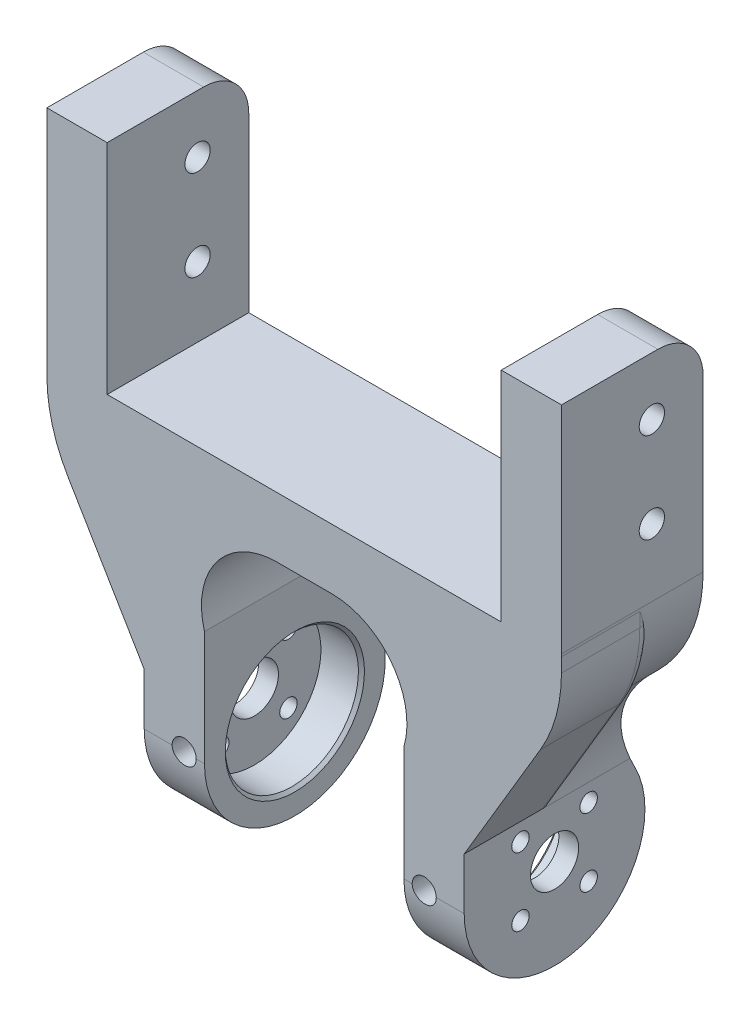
ISO-10303-21;
HEADER;
FILE_DESCRIPTION(('STEP AP214'),'2;1');
FILE_NAME('part.step','',(''),(''),'','','');
FILE_SCHEMA(('AUTOMOTIVE_DESIGN { 1 0 10303 214 1 1 1 1 }'));
ENDSEC;
DATA;
#1=APPLICATION_CONTEXT('core data for automotive mechanical design processes');
#2=APPLICATION_PROTOCOL_DEFINITION('international standard','automotive_design',2000,#1);
#3=PRODUCT_CONTEXT('',#1,'mechanical');
#4=PRODUCT('Part','Part','',(#3));
#5=PRODUCT_RELATED_PRODUCT_CATEGORY('part','',(#4));
#6=PRODUCT_DEFINITION_FORMATION('','',#4);
#7=PRODUCT_DEFINITION_CONTEXT('part definition',#1,'design');
#8=PRODUCT_DEFINITION('design','',#6,#7);
#9=PRODUCT_DEFINITION_SHAPE('','',#8);
#10=(LENGTH_UNIT() NAMED_UNIT(*) SI_UNIT(.MILLI.,.METRE.));
#11=(NAMED_UNIT(*) PLANE_ANGLE_UNIT() SI_UNIT($,.RADIAN.));
#12=(NAMED_UNIT(*) SI_UNIT($,.STERADIAN.) SOLID_ANGLE_UNIT());
#13=UNCERTAINTY_MEASURE_WITH_UNIT(LENGTH_MEASURE(1.E-05),#10,'distance_accuracy_value','');
#14=(GEOMETRIC_REPRESENTATION_CONTEXT(3) GLOBAL_UNCERTAINTY_ASSIGNED_CONTEXT((#13)) GLOBAL_UNIT_ASSIGNED_CONTEXT((#10,
#11,#12)) REPRESENTATION_CONTEXT('',''));
#15=CARTESIAN_POINT('',(0.,0.,0.));
#16=DIRECTION('',(0.,0.,1.));
#17=DIRECTION('',(1.,0.,0.));
#18=AXIS2_PLACEMENT_3D('',#15,#16,#17);
#19=CARTESIAN_POINT('',(-42.7,-28.2,15.));
#20=DIRECTION('',(0.703800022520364,0.710398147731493,0.));
#21=DIRECTION('',(-0.710398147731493,0.703800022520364,0.));
#22=AXIS2_PLACEMENT_3D('',#19,#20,#21);
#23=PLANE('',#22);
#24=DIRECTION('',(0.710398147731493,-0.703800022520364,0.));
#25=VECTOR('',#24,1.);
#26=CARTESIAN_POINT('',(-42.7,-28.2,0.));
#27=LINE('',#26,#25);
#28=CARTESIAN_POINT('',(-35.2950005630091,-35.5362223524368,0.));
#29=VERTEX_POINT('',#28);
#30=CARTESIAN_POINT('',(-33.9549994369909,-36.8637776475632,0.));
#31=VERTEX_POINT('',#30);
#32=EDGE_CURVE('E406',#29,#31,#27,.T.);
#33=ORIENTED_EDGE('',*,*,#32,.F.);
#34=DIRECTION('',(0.,0.,-1.));
#35=VECTOR('',#34,1.);
#36=CARTESIAN_POINT('',(-35.2950005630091,-35.5362223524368,15.));
#37=LINE('',#36,#35);
#38=CARTESIAN_POINT('',(-35.2950005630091,-35.5362223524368,-8.5));
#39=VERTEX_POINT('',#38);
#40=EDGE_CURVE('E812',#29,#39,#37,.T.);
#41=ORIENTED_EDGE('',*,*,#40,.T.);
#42=DIRECTION('',(-0.710398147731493,0.703800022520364,0.));
#43=VECTOR('',#42,1.);
#44=CARTESIAN_POINT('',(-42.7,-28.2,-8.5));
#45=LINE('',#44,#43);
#46=CARTESIAN_POINT('',(-34.7880682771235,-36.0384462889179,-8.5));
#47=VERTEX_POINT('',#46);
#48=EDGE_CURVE('E615',#47,#39,#45,.T.);
#49=ORIENTED_EDGE('',*,*,#48,.F.);
#50=CARTESIAN_POINT('',(-34.7880682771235,-36.0384462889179,-53.5));
#51=DIRECTION('',(0.703800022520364,0.710398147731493,0.));
#52=DIRECTION('',(-0.710398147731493,0.703800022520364,0.));
#53=AXIS2_PLACEMENT_3D('',#50,#51,#52);
#54=ELLIPSE('',#53,63.9386168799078,45.);
#55=CARTESIAN_POINT('',(-33.9549994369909,-36.8637776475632,-8.50756921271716));
#56=VERTEX_POINT('',#55);
#57=EDGE_CURVE('E296',#47,#56,#54,.T.);
#58=ORIENTED_EDGE('',*,*,#57,.T.);
#59=DIRECTION('',(0.,0.,-1.));
#60=VECTOR('',#59,1.);
#61=CARTESIAN_POINT('',(-33.9549994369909,-36.8637776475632,15.));
#62=LINE('',#61,#60);
#63=EDGE_CURVE('E813',#56,#31,#62,.F.);
#64=ORIENTED_EDGE('',*,*,#63,.T.);
#65=EDGE_LOOP('',(#33,#41,#49,#58,#64));
#66=FACE_BOUND('',#65,.T.);
#67=ADVANCED_FACE('F48',(#66),#23,.F.);
#68=CARTESIAN_POINT('',(42.7,-28.2,15.));
#69=DIRECTION('',(-0.703800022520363,0.710398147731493,0.));
#70=DIRECTION('',(-0.710398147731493,-0.703800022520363,0.));
#71=AXIS2_PLACEMENT_3D('',#68,#69,#70);
#72=PLANE('',#71);
#73=DIRECTION('',(0.710398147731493,0.703800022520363,0.));
#74=VECTOR('',#73,1.);
#75=CARTESIAN_POINT('',(42.7,-28.2,0.));
#76=LINE('',#75,#74);
#77=CARTESIAN_POINT('',(33.9549994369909,-36.8637776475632,0.));
#78=VERTEX_POINT('',#77);
#79=CARTESIAN_POINT('',(35.2950005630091,-35.5362223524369,0.));
#80=VERTEX_POINT('',#79);
#81=EDGE_CURVE('E136',#78,#80,#76,.T.);
#82=ORIENTED_EDGE('',*,*,#81,.F.);
#83=DIRECTION('',(0.,0.,-1.));
#84=VECTOR('',#83,1.);
#85=CARTESIAN_POINT('',(33.9549994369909,-36.8637776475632,-8.5));
#86=LINE('',#85,#84);
#87=CARTESIAN_POINT('',(33.9549994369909,-36.8637776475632,-8.50756921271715));
#88=VERTEX_POINT('',#87);
#89=EDGE_CURVE('E824',#78,#88,#86,.T.);
#90=ORIENTED_EDGE('',*,*,#89,.T.);
#91=CARTESIAN_POINT('',(34.7880682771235,-36.0384462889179,-53.5));
#92=DIRECTION('',(-0.703800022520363,0.710398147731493,0.));
#93=DIRECTION('',(-0.710398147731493,-0.703800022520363,0.));
#94=AXIS2_PLACEMENT_3D('',#91,#92,#93);
#95=ELLIPSE('',#94,63.9386168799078,45.);
#96=CARTESIAN_POINT('',(34.7880682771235,-36.0384462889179,-8.5));
#97=VERTEX_POINT('',#96);
#98=EDGE_CURVE('E265',#88,#97,#95,.T.);
#99=ORIENTED_EDGE('',*,*,#98,.T.);
#100=DIRECTION('',(-0.710398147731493,-0.703800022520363,0.));
#101=VECTOR('',#100,1.);
#102=CARTESIAN_POINT('',(42.7,-28.2,-8.5));
#103=LINE('',#102,#101);
#104=CARTESIAN_POINT('',(35.2950005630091,-35.5362223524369,-8.5));
#105=VERTEX_POINT('',#104);
#106=EDGE_CURVE('E604',#105,#97,#103,.T.);
#107=ORIENTED_EDGE('',*,*,#106,.F.);
#108=DIRECTION('',(0.,0.,-1.));
#109=VECTOR('',#108,1.);
#110=CARTESIAN_POINT('',(35.2950005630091,-35.5362223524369,15.));
#111=LINE('',#110,#109);
#112=EDGE_CURVE('E816',#105,#80,#111,.F.);
#113=ORIENTED_EDGE('',*,*,#112,.T.);
#114=EDGE_LOOP('',(#82,#90,#99,#107,#113));
#115=FACE_BOUND('',#114,.T.);
#116=ADVANCED_FACE('F1068',(#115),#72,.F.);
#117=CARTESIAN_POINT('',(-51.55,-54.6237313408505,15.));
#118=DIRECTION('',(0.,0.,1.));
#119=DIRECTION('',(1.,0.,0.));
#120=AXIS2_PLACEMENT_3D('',#117,#118,#119);
#121=CYLINDRICAL_SURFACE('',#120,25.);
#122=CARTESIAN_POINT('',(-51.55,-54.6237313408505,0.));
#123=DIRECTION('',(0.,0.,1.));
#124=DIRECTION('',(1.,0.,0.));
#125=AXIS2_PLACEMENT_3D('',#122,#123,#124);
#126=CIRCLE('',#125,25.);
#127=CARTESIAN_POINT('',(-26.9880743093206,-49.9641384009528,0.));
#128=VERTEX_POINT('',#127);
#129=EDGE_CURVE('E415',#31,#128,#126,.F.);
#130=ORIENTED_EDGE('',*,*,#129,.F.);
#131=ORIENTED_EDGE('',*,*,#63,.F.);
#132=CARTESIAN_POINT('',(-33.9549994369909,-36.8637776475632,-8.50756921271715));
#133=CARTESIAN_POINT('',(-33.7249837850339,-37.0916563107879,-8.51174968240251));
#134=CARTESIAN_POINT('',(-33.499437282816,-37.3239646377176,-8.51774304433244));
#135=CARTESIAN_POINT('',(-33.0575918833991,-37.7970964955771,-8.53375481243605));
#136=CARTESIAN_POINT('',(-32.8412933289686,-38.0379203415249,-8.54377336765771));
#137=CARTESIAN_POINT('',(-32.2067470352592,-38.772636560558,-8.58046578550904));
#138=CARTESIAN_POINT('',(-31.8028613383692,-39.2787610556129,-8.61377621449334));
#139=CARTESIAN_POINT('',(-31.0369095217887,-40.3188458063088,-8.70100283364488));
#140=CARTESIAN_POINT('',(-30.6747837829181,-40.8527647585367,-8.75488916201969));
#141=CARTESIAN_POINT('',(-29.9940185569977,-41.94486871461,-8.88591592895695));
#142=CARTESIAN_POINT('',(-29.6753733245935,-42.5030504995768,-8.96305329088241));
#143=CARTESIAN_POINT('',(-29.0826615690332,-43.640513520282,-9.14302815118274));
#144=CARTESIAN_POINT('',(-28.8087138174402,-44.2198461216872,-9.24593233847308));
#145=CARTESIAN_POINT('',(-28.3077075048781,-45.3931954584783,-9.47902318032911));
#146=CARTESIAN_POINT('',(-28.0806536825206,-45.9872136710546,-9.60921258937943));
#147=CARTESIAN_POINT('',(-27.6742501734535,-47.1841216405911,-9.89779062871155));
#148=CARTESIAN_POINT('',(-27.4948667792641,-47.7870048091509,-10.0561592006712));
#149=CARTESIAN_POINT('',(-27.1835065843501,-48.9966673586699,-10.4015098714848));
#150=CARTESIAN_POINT('',(-27.0515172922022,-49.6034456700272,-10.5884844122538));
#151=CARTESIAN_POINT('',(-26.8760946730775,-50.5813055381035,-10.91292542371));
#152=CARTESIAN_POINT('',(-26.8181536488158,-50.9528017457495,-11.0415797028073));
#153=CARTESIAN_POINT('',(-26.7194100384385,-51.6942892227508,-11.3093625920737));
#154=CARTESIAN_POINT('',(-26.6786063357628,-52.0642805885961,-11.4484905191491));
#155=CARTESIAN_POINT('',(-26.6137761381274,-52.8012605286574,-11.7368059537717));
#156=CARTESIAN_POINT('',(-26.589729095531,-53.1682522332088,-11.8859808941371));
#157=CARTESIAN_POINT('',(-26.5578351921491,-53.8988053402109,-12.1942485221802));
#158=CARTESIAN_POINT('',(-26.5499899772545,-54.2623663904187,-12.3533422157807));
#159=CARTESIAN_POINT('',(-26.55,-54.6237313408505,-12.517233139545));
#160=B_SPLINE_CURVE_WITH_KNOTS('',3,(#132,#133,#134,#135,#136,#137,#138,#139,#140,#141,#142,
#143,#144,#145,#146,#147,#148,#149,#150,#151,#152,#153,#154,#155,#156,#157,#158,#159),
.UNSPECIFIED.,.F.,.F.,(4,2,2,2,2,2,2,2,2,2,2,2,2,4),(0.,0.971295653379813,1.94262727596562,
3.88534388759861,5.82525168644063,7.76490290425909,9.7096271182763,11.654547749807,
13.5980894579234,15.5411185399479,16.7328319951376,17.9244677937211,19.1146397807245,
20.3049326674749),.UNSPECIFIED.);
#161=CARTESIAN_POINT('',(-26.55,-54.6237313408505,-12.517233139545));
#162=VERTEX_POINT('',#161);
#163=EDGE_CURVE('E308',#56,#162,#160,.T.);
#164=ORIENTED_EDGE('',*,*,#163,.T.);
#165=DIRECTION('',(0.,0.,-1.));
#166=VECTOR('',#165,1.);
#167=CARTESIAN_POINT('',(-26.55,-54.6237313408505,-8.5));
#168=LINE('',#167,#166);
#169=CARTESIAN_POINT('',(-26.55,-54.6237313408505,2.));
#170=VERTEX_POINT('',#169);
#171=EDGE_CURVE('E93',#170,#162,#168,.T.);
#172=ORIENTED_EDGE('',*,*,#171,.F.);
#173=CARTESIAN_POINT('',(-26.55,-54.6237313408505,2.));
#174=CARTESIAN_POINT('',(-26.550000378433,-54.6237379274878,1.96941544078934));
#175=CARTESIAN_POINT('',(-26.5499999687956,-54.622354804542,1.93884792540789));
#176=CARTESIAN_POINT('',(-26.550000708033,-54.6168803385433,1.87798050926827));
#177=CARTESIAN_POINT('',(-26.5500018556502,-54.6127911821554,1.8476804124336));
#178=CARTESIAN_POINT('',(-26.5500122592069,-54.5966682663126,1.75801516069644));
#179=CARTESIAN_POINT('',(-26.550028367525,-54.5807761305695,1.69930998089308));
#180=CARTESIAN_POINT('',(-26.5501320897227,-54.5400146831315,1.58539420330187));
#181=CARTESIAN_POINT('',(-26.5502194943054,-54.5151717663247,1.53017388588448));
#182=CARTESIAN_POINT('',(-26.5505325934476,-54.4580497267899,1.42362726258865));
#183=CARTESIAN_POINT('',(-26.5507586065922,-54.4257535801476,1.37231023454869));
#184=CARTESIAN_POINT('',(-26.5516405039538,-54.3313566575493,1.24053293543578));
#185=CARTESIAN_POINT('',(-26.5524839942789,-54.263899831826,1.16391896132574));
#186=CARTESIAN_POINT('',(-26.5550076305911,-54.1180534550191,1.02195037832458));
#187=CARTESIAN_POINT('',(-26.5566901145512,-54.039633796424,0.956627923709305));
#188=CARTESIAN_POINT('',(-26.5607696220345,-53.8865481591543,0.843943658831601));
#189=CARTESIAN_POINT('',(-26.5630418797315,-53.8127696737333,0.795348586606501));
#190=CARTESIAN_POINT('',(-26.5684163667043,-53.6613247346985,0.704635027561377));
#191=CARTESIAN_POINT('',(-26.571519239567,-53.5836553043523,0.662521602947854));
#192=CARTESIAN_POINT('',(-26.5786083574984,-53.4254492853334,0.58391370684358));
#193=CARTESIAN_POINT('',(-26.5825958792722,-53.3449086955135,0.547427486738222));
#194=CARTESIAN_POINT('',(-26.5914844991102,-53.1817912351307,0.479426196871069));
#195=CARTESIAN_POINT('',(-26.5963859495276,-53.0992135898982,0.447913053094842));
#196=CARTESIAN_POINT('',(-26.612683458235,-52.8463663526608,0.358892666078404));
#197=CARTESIAN_POINT('',(-26.6255518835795,-52.6737719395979,0.30822840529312));
#198=CARTESIAN_POINT('',(-26.655259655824,-52.3253426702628,0.221051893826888));
#199=CARTESIAN_POINT('',(-26.6721032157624,-52.1495045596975,0.184554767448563));
#200=CARTESIAN_POINT('',(-26.7098050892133,-51.7959435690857,0.122939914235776));
#201=CARTESIAN_POINT('',(-26.7306713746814,-51.6182176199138,0.0978451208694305));
#202=CARTESIAN_POINT('',(-26.7763632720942,-51.2623158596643,0.0570687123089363));
#203=CARTESIAN_POINT('',(-26.8011870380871,-51.0841402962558,0.0413827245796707));
#204=CARTESIAN_POINT('',(-26.8516865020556,-50.7483299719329,0.0191415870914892));
#205=CARTESIAN_POINT('',(-26.8769376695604,-50.5906839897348,0.0117453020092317));
#206=CARTESIAN_POINT('',(-26.9303324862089,-50.2766363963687,0.00220156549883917));
#207=CARTESIAN_POINT('',(-26.9584589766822,-50.1202327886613,2.46779033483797E-05));
#208=CARTESIAN_POINT('',(-26.9880743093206,-49.9641384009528,0.));
#209=B_SPLINE_CURVE_WITH_KNOTS('',3,(#173,#174,#175,#176,#177,#178,#179,#180,#181,#182,#183,
#184,#185,#186,#187,#188,#189,#190,#191,#192,#193,#194,#195,#196,#197,#198,#199,#200,#201,#202,
#203,#204,#205,#206,#207,#208),.UNSPECIFIED.,.F.,.F.,(4,2,2,2,2,2,2,2,2,2,2,2,2,2,2,2,2,4),(0.,
0.0916904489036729,0.183306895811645,0.364838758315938,0.545839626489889,0.727258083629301,
1.03174909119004,1.3370933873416,1.60183461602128,1.86678157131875,2.13211340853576,
2.3975477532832,2.93763362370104,3.47829449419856,4.02003803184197,4.56152961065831,
5.04089306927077,5.51754660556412),.UNSPECIFIED.);
#210=EDGE_CURVE('E199',#170,#128,#209,.T.);
#211=ORIENTED_EDGE('',*,*,#210,.T.);
#212=EDGE_LOOP('',(#130,#131,#164,#172,#211));
#213=FACE_BOUND('',#212,.T.);
#214=ADVANCED_FACE('F249',(#213),#121,.F.);
#215=CARTESIAN_POINT('',(51.55,-54.6237313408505,15.));
#216=DIRECTION('',(0.,0.,1.));
#217=DIRECTION('',(1.,0.,0.));
#218=AXIS2_PLACEMENT_3D('',#215,#216,#217);
#219=CYLINDRICAL_SURFACE('',#218,25.);
#220=CARTESIAN_POINT('',(51.55,-54.6237313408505,0.));
#221=DIRECTION('',(0.,0.,1.));
#222=DIRECTION('',(1.,0.,0.));
#223=AXIS2_PLACEMENT_3D('',#220,#221,#222);
#224=CIRCLE('',#223,25.);
#225=CARTESIAN_POINT('',(26.9880743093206,-49.9641384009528,0.));
#226=VERTEX_POINT('',#225);
#227=EDGE_CURVE('E417',#226,#78,#224,.F.);
#228=ORIENTED_EDGE('',*,*,#227,.F.);
#229=CARTESIAN_POINT('',(26.9880743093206,-49.9641384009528,0.));
#230=CARTESIAN_POINT('',(26.9683601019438,-50.0680557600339,3.11021097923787E-06));
#231=CARTESIAN_POINT('',(26.9493060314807,-50.1720978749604,0.000974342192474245));
#232=CARTESIAN_POINT('',(26.9125234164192,-50.3803915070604,0.0050843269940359));
#233=CARTESIAN_POINT('',(26.8947951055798,-50.4846430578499,0.00822346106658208));
#234=CARTESIAN_POINT('',(26.8435065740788,-50.798270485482,0.0212673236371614));
#235=CARTESIAN_POINT('',(26.8119702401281,-51.0078471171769,0.034801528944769));
#236=CARTESIAN_POINT('',(26.7543649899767,-51.4266826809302,0.0738391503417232));
#237=CARTESIAN_POINT('',(26.7282953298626,-51.6359416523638,0.0993409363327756));
#238=CARTESIAN_POINT('',(26.693344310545,-51.9483521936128,0.148888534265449));
#239=CARTESIAN_POINT('',(26.682391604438,-52.052180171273,0.167272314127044));
#240=CARTESIAN_POINT('',(26.661862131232,-52.2591186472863,0.20830946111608));
#241=CARTESIAN_POINT('',(26.6522850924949,-52.3622292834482,0.230961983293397));
#242=CARTESIAN_POINT('',(26.637403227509,-52.5339143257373,0.272942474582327));
#243=CARTESIAN_POINT('',(26.6317239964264,-52.6027806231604,0.290943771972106));
#244=CARTESIAN_POINT('',(26.6209840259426,-52.7398795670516,0.32936860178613));
#245=CARTESIAN_POINT('',(26.6159233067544,-52.808112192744,0.349792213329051));
#246=CARTESIAN_POINT('',(26.601629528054,-53.0120928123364,0.415202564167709));
#247=CARTESIAN_POINT('',(26.5933234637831,-53.1466755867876,0.464222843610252));
#248=CARTESIAN_POINT('',(26.5817750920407,-53.3609629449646,0.554528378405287));
#249=CARTESIAN_POINT('',(26.5778020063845,-53.4423175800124,0.59181854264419));
#250=CARTESIAN_POINT('',(26.5707520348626,-53.60218195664,0.672321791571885));
#251=CARTESIAN_POINT('',(26.5676756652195,-53.6806900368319,0.715538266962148));
#252=CARTESIAN_POINT('',(26.5623850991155,-53.8332291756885,0.808504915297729));
#253=CARTESIAN_POINT('',(26.5601663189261,-53.9072821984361,0.85821839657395));
#254=CARTESIAN_POINT('',(26.5564926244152,-54.0495926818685,0.965281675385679));
#255=CARTESIAN_POINT('',(26.5550364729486,-54.1178593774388,1.02261891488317));
#256=CARTESIAN_POINT('',(26.5529634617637,-54.2351493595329,1.13532818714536));
#257=CARTESIAN_POINT('',(26.5522453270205,-54.2854629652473,1.18934219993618));
#258=CARTESIAN_POINT('',(26.5511596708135,-54.3784860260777,1.30372189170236));
#259=CARTESIAN_POINT('',(26.5507923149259,-54.4211918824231,1.36409055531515));
#260=CARTESIAN_POINT('',(26.5502929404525,-54.4968398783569,1.49183061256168));
#261=CARTESIAN_POINT('',(26.5501640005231,-54.5296497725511,1.55928188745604));
#262=CARTESIAN_POINT('',(26.5500215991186,-54.5815787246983,1.69920165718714));
#263=CARTESIAN_POINT('',(26.5500077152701,-54.6007476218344,1.77165081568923));
#264=CARTESIAN_POINT('',(26.5500010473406,-54.6158693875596,1.87080487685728));
#265=CARTESIAN_POINT('',(26.5500004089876,-54.6188107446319,1.89654792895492));
#266=CARTESIAN_POINT('',(26.5499999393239,-54.6227416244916,1.94818873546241));
#267=CARTESIAN_POINT('',(26.5500001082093,-54.6237306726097,1.97408652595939));
#268=CARTESIAN_POINT('',(26.55,-54.6237313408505,2.));
#269=B_SPLINE_CURVE_WITH_KNOTS('',3,(#229,#230,#231,#232,#233,#234,#235,#236,#237,#238,#239,
#240,#241,#242,#243,#244,#245,#246,#247,#248,#249,#250,#251,#252,#253,#254,#255,#256,#257,#258,
#259,#260,#261,#262,#263,#264,#265,#266,#267,#268),.UNSPECIFIED.,.F.,.F.,(4,2,2,2,2,2,2,2,2,2,2,
2,2,2,2,2,2,2,2,4),(0.,0.317302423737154,0.634660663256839,1.27142680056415,1.90810622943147,
2.22606034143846,2.54395158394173,2.7581254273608,2.97230626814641,3.402050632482,
3.67060758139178,3.93931882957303,4.20657329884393,4.47339287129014,4.69432292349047,
4.9153572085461,5.13922628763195,5.36227317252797,5.43994532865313,5.51763636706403),.UNSPECIFIED.);
#270=CARTESIAN_POINT('',(26.55,-54.6237313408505,2.));
#271=VERTEX_POINT('',#270);
#272=EDGE_CURVE('E12',#226,#271,#269,.T.);
#273=ORIENTED_EDGE('',*,*,#272,.T.);
#274=DIRECTION('',(0.,0.,-1.));
#275=VECTOR('',#274,1.);
#276=CARTESIAN_POINT('',(26.55,-54.6237313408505,15.));
#277=LINE('',#276,#275);
#278=CARTESIAN_POINT('',(26.55,-54.6237313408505,-12.517233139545));
#279=VERTEX_POINT('',#278);
#280=EDGE_CURVE('E69',#279,#271,#277,.F.);
#281=ORIENTED_EDGE('',*,*,#280,.F.);
#282=CARTESIAN_POINT('',(26.55,-54.6237313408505,-12.517233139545));
#283=CARTESIAN_POINT('',(26.5499996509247,-54.3272754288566,-12.3827901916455));
#284=CARTESIAN_POINT('',(26.5552743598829,-54.029383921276,-12.2515817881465));
#285=CARTESIAN_POINT('',(26.5766674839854,-53.4311360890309,-11.995781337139));
#286=CARTESIAN_POINT('',(26.5927866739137,-53.1307795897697,-11.871189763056));
#287=CARTESIAN_POINT('',(26.6578580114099,-52.2265791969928,-11.5075463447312));
#288=CARTESIAN_POINT('',(26.7235241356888,-51.6197099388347,-11.2786736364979));
#289=CARTESIAN_POINT('',(26.9011292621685,-50.4034826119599,-10.849545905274));
#290=CARTESIAN_POINT('',(27.013014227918,-49.7941282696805,-10.6492578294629));
#291=CARTESIAN_POINT('',(27.2842098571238,-48.5772568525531,-10.2775194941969));
#292=CARTESIAN_POINT('',(27.4435117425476,-47.9697394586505,-10.1060639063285));
#293=CARTESIAN_POINT('',(27.8105809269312,-46.7598323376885,-9.7913751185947));
#294=CARTESIAN_POINT('',(28.0185005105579,-46.1574650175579,-9.64823326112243));
#295=CARTESIAN_POINT('',(28.482243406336,-44.9651712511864,-9.39007253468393));
#296=CARTESIAN_POINT('',(28.7380730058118,-44.3752464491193,-9.27505736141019));
#297=CARTESIAN_POINT('',(29.2962802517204,-43.2137886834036,-9.07183534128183));
#298=CARTESIAN_POINT('',(29.5986146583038,-42.6422392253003,-8.98360381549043));
#299=CARTESIAN_POINT('',(30.248251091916,-41.5220343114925,-8.83178304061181));
#300=CARTESIAN_POINT('',(30.5955403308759,-40.9733724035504,-8.76818680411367));
#301=CARTESIAN_POINT('',(31.1845092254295,-40.1186347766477,-8.68420469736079));
#302=CARTESIAN_POINT('',(31.4125104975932,-39.8037169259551,-8.65672612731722));
#303=CARTESIAN_POINT('',(31.8832302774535,-39.1845166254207,-8.60903644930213));
#304=CARTESIAN_POINT('',(32.1259476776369,-38.8802333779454,-8.5888247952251));
#305=CARTESIAN_POINT('',(32.6252335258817,-38.283462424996,-8.55504334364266));
#306=CARTESIAN_POINT('',(32.8817861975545,-37.9909619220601,-8.54146615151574));
#307=CARTESIAN_POINT('',(33.4084138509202,-37.4180813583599,-8.52023960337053));
#308=CARTESIAN_POINT('',(33.6784910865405,-37.1377033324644,-8.51259123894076));
#309=CARTESIAN_POINT('',(33.9549994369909,-36.8637776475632,-8.50756921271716));
#310=B_SPLINE_CURVE_WITH_KNOTS('',3,(#282,#283,#284,#285,#286,#287,#288,#289,#290,#291,#292,
#293,#294,#295,#296,#297,#298,#299,#300,#301,#302,#303,#304,#305,#306,#307,#308,#309),
.UNSPECIFIED.,.F.,.F.,(4,2,2,2,2,2,2,2,2,2,2,2,2,4),(0.,0.976425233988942,1.95292023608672,
3.90625682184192,5.85731611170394,7.80801443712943,9.76490675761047,11.7220560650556,
13.6773965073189,15.6321819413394,16.8010298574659,17.9697899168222,19.1372443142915,
20.3048939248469),.UNSPECIFIED.);
#311=EDGE_CURVE('E253',#279,#88,#310,.T.);
#312=ORIENTED_EDGE('',*,*,#311,.T.);
#313=ORIENTED_EDGE('',*,*,#89,.F.);
#314=EDGE_LOOP('',(#228,#273,#281,#312,#313));
#315=FACE_BOUND('',#314,.T.);
#316=ADVANCED_FACE('F245',(#315),#219,.F.);
#317=CARTESIAN_POINT('',(-42.7,-63.2,0.));
#318=DIRECTION('',(1.,0.,0.));
#319=DIRECTION('',(0.,0.,-1.));
#320=AXIS2_PLACEMENT_3D('',#317,#318,#319);
#321=CYLINDRICAL_SURFACE('',#320,3.995);
#322=CARTESIAN_POINT('',(-26.55,-63.2,0.));
#323=DIRECTION('',(1.,0.,0.));
#324=DIRECTION('',(0.,1.,0.));
#325=AXIS2_PLACEMENT_3D('',#322,#323,#324);
#326=CIRCLE('',#325,3.995);
#327=CARTESIAN_POINT('',(-26.55,-59.205,0.));
#328=VERTEX_POINT('',#327);
#329=EDGE_CURVE('E581',#328,#328,#326,.T.);
#330=ORIENTED_EDGE('',*,*,#329,.F.);
#331=EDGE_LOOP('',(#330));
#332=FACE_BOUND('',#331,.T.);
#333=CARTESIAN_POINT('',(-23.2700000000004,-63.2,0.));
#334=DIRECTION('',(1.,0.,0.));
#335=DIRECTION('',(0.,1.,0.));
#336=AXIS2_PLACEMENT_3D('',#333,#334,#335);
#337=CIRCLE('',#336,3.995);
#338=CARTESIAN_POINT('',(-23.2700000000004,-59.205,0.));
#339=VERTEX_POINT('',#338);
#340=EDGE_CURVE('E514',#339,#339,#337,.F.);
#341=ORIENTED_EDGE('',*,*,#340,.F.);
#342=EDGE_LOOP('',(#341));
#343=FACE_BOUND('',#342,.T.);
#344=ADVANCED_FACE('F247',(#332,#343),#321,.F.);
#345=CARTESIAN_POINT('',(26.55,-63.2,0.));
#346=DIRECTION('',(-1.,0.,0.));
#347=DIRECTION('',(0.,0.,1.));
#348=AXIS2_PLACEMENT_3D('',#345,#346,#347);
#349=CIRCLE('',#348,3.995);
#350=CARTESIAN_POINT('',(26.55,-63.2,3.995));
#351=VERTEX_POINT('',#350);
#352=EDGE_CURVE('E584',#351,#351,#349,.T.);
#353=ORIENTED_EDGE('',*,*,#352,.F.);
#354=EDGE_LOOP('',(#353));
#355=FACE_BOUND('',#354,.T.);
#356=CARTESIAN_POINT('',(23.27,-63.2,0.));
#357=DIRECTION('',(-1.,0.,0.));
#358=DIRECTION('',(0.,-1.,0.));
#359=AXIS2_PLACEMENT_3D('',#356,#357,#358);
#360=CIRCLE('',#359,3.995);
#361=CARTESIAN_POINT('',(23.27,-67.195,0.));
#362=VERTEX_POINT('',#361);
#363=EDGE_CURVE('E548',#362,#362,#360,.F.);
#364=ORIENTED_EDGE('',*,*,#363,.F.);
#365=EDGE_LOOP('',(#364));
#366=FACE_BOUND('',#365,.T.);
#367=ADVANCED_FACE('F1153',(#355,#366),#321,.F.);
#368=CARTESIAN_POINT('',(-42.7,-18.2,15.));
#369=DIRECTION('',(1.,0.,0.));
#370=DIRECTION('',(0.,0.,-1.));
#371=AXIS2_PLACEMENT_3D('',#368,#369,#370);
#372=PLANE('',#371);
#373=CARTESIAN_POINT('',(-42.7,-6.6,0.));
#374=DIRECTION('',(1.,0.,0.));
#375=DIRECTION('',(0.,0.,-1.));
#376=AXIS2_PLACEMENT_3D('',#373,#374,#375);
#377=CIRCLE('',#376,2.1);
#378=CARTESIAN_POINT('',(-42.7,-6.6,-2.1));
#379=VERTEX_POINT('',#378);
#380=EDGE_CURVE('E552',#379,#379,#377,.T.);
#381=ORIENTED_EDGE('',*,*,#380,.T.);
#382=EDGE_LOOP('',(#381));
#383=FACE_BOUND('',#382,.T.);
#384=CARTESIAN_POINT('',(-42.7,8.4,0.));
#385=DIRECTION('',(1.,0.,0.));
#386=DIRECTION('',(0.,0.,-1.));
#387=AXIS2_PLACEMENT_3D('',#384,#385,#386);
#388=CIRCLE('',#387,2.1);
#389=CARTESIAN_POINT('',(-42.7,8.4,-2.1));
#390=VERTEX_POINT('',#389);
#391=EDGE_CURVE('E563',#390,#390,#388,.T.);
#392=ORIENTED_EDGE('',*,*,#391,.T.);
#393=EDGE_LOOP('',(#392));
#394=FACE_BOUND('',#393,.T.);
#395=DIRECTION('',(0.,1.,0.));
#396=VECTOR('',#395,1.);
#397=CARTESIAN_POINT('',(-42.7,-18.,-8.5));
#398=LINE('',#397,#396);
#399=CARTESIAN_POINT('',(-42.7,-17.7762686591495,-8.5));
#400=VERTEX_POINT('',#399);
#401=CARTESIAN_POINT('',(-42.7,10.5,-8.50000000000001));
#402=VERTEX_POINT('',#401);
#403=EDGE_CURVE('E594',#400,#402,#398,.T.);
#404=ORIENTED_EDGE('',*,*,#403,.F.);
#405=DIRECTION('',(0.,0.,-1.));
#406=VECTOR('',#405,1.);
#407=CARTESIAN_POINT('',(-42.7,-17.7762686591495,15.));
#408=LINE('',#407,#406);
#409=CARTESIAN_POINT('',(-42.7,-17.7762686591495,15.));
#410=VERTEX_POINT('',#409);
#411=EDGE_CURVE('E847',#400,#410,#408,.F.);
#412=ORIENTED_EDGE('',*,*,#411,.T.);
#413=DIRECTION('',(0.,-1.,0.));
#414=VECTOR('',#413,1.);
#415=CARTESIAN_POINT('',(-42.7,18.,15.));
#416=LINE('',#415,#414);
#417=CARTESIAN_POINT('',(-42.7,18.,15.));
#418=VERTEX_POINT('',#417);
#419=EDGE_CURVE('E618',#418,#410,#416,.T.);
#420=ORIENTED_EDGE('',*,*,#419,.F.);
#421=DIRECTION('',(0.,0.,-1.));
#422=VECTOR('',#421,1.);
#423=CARTESIAN_POINT('',(-42.7,18.,15.));
#424=LINE('',#423,#422);
#425=CARTESIAN_POINT('',(-42.7,18.,-1.));
#426=VERTEX_POINT('',#425);
#427=EDGE_CURVE('E694',#418,#426,#424,.T.);
#428=ORIENTED_EDGE('',*,*,#427,.T.);
#429=CARTESIAN_POINT('',(-42.7,10.5,-1.));
#430=DIRECTION('',(1.,0.,0.));
#431=DIRECTION('',(0.,0.,-1.));
#432=AXIS2_PLACEMENT_3D('',#429,#430,#431);
#433=CIRCLE('',#432,7.5);
#434=EDGE_CURVE('E769',#426,#402,#433,.F.);
#435=ORIENTED_EDGE('',*,*,#434,.T.);
#436=EDGE_LOOP('',(#404,#412,#420,#428,#435));
#437=FACE_BOUND('',#436,.T.);
#438=ADVANCED_FACE('F1109',(#383,#394,#437),#372,.F.);
#439=CARTESIAN_POINT('',(-32.7,18.,15.));
#440=DIRECTION('',(0.,-1.,0.));
#441=DIRECTION('',(0.,0.,-1.));
#442=AXIS2_PLACEMENT_3D('',#439,#440,#441);
#443=PLANE('',#442);
#444=DIRECTION('',(0.,0.,-1.));
#445=VECTOR('',#444,1.);
#446=CARTESIAN_POINT('',(-32.7,18.,15.));
#447=LINE('',#446,#445);
#448=CARTESIAN_POINT('',(-32.7,18.,15.));
#449=VERTEX_POINT('',#448);
#450=CARTESIAN_POINT('',(-32.7,18.,-1.));
#451=VERTEX_POINT('',#450);
#452=EDGE_CURVE('E661',#449,#451,#447,.T.);
#453=ORIENTED_EDGE('',*,*,#452,.T.);
#454=DIRECTION('',(1.,0.,0.));
#455=VECTOR('',#454,1.);
#456=CARTESIAN_POINT('',(-42.7,18.,-1.));
#457=LINE('',#456,#455);
#458=EDGE_CURVE('E764',#451,#426,#457,.F.);
#459=ORIENTED_EDGE('',*,*,#458,.T.);
#460=ORIENTED_EDGE('',*,*,#427,.F.);
#461=DIRECTION('',(-1.,0.,0.));
#462=VECTOR('',#461,1.);
#463=CARTESIAN_POINT('',(-32.7,18.,15.));
#464=LINE('',#463,#462);
#465=EDGE_CURVE('E617',#449,#418,#464,.T.);
#466=ORIENTED_EDGE('',*,*,#465,.F.);
#467=EDGE_LOOP('',(#453,#459,#460,#466));
#468=FACE_BOUND('',#467,.T.);
#469=ADVANCED_FACE('F1107',(#468),#443,.F.);
#470=CARTESIAN_POINT('',(-26.55,-48.2,15.));
#471=DIRECTION('',(1.,0.,0.));
#472=DIRECTION('',(0.,1.,0.));
#473=AXIS2_PLACEMENT_3D('',#470,#471,#472);
#474=PLANE('',#473);
#475=CARTESIAN_POINT('',(-26.55,-57.5431457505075,-5.65685424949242));
#476=DIRECTION('',(1.,0.,0.));
#477=DIRECTION('',(0.,1.,0.));
#478=AXIS2_PLACEMENT_3D('',#475,#476,#477);
#479=CIRCLE('',#478,1.45);
#480=CARTESIAN_POINT('',(-26.55,-56.0931457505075,-5.65685424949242));
#481=VERTEX_POINT('',#480);
#482=EDGE_CURVE('E498',#481,#481,#479,.T.);
#483=ORIENTED_EDGE('',*,*,#482,.T.);
#484=EDGE_LOOP('',(#483));
#485=FACE_BOUND('',#484,.T.);
#486=CARTESIAN_POINT('',(-26.55,-68.8568542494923,-5.65685424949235));
#487=DIRECTION('',(1.,0.,0.));
#488=DIRECTION('',(0.,1.,0.));
#489=AXIS2_PLACEMENT_3D('',#486,#487,#488);
#490=CIRCLE('',#489,1.45);
#491=CARTESIAN_POINT('',(-26.55,-67.4068542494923,-5.65685424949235));
#492=VERTEX_POINT('',#491);
#493=EDGE_CURVE('E487',#492,#492,#490,.T.);
#494=ORIENTED_EDGE('',*,*,#493,.T.);
#495=EDGE_LOOP('',(#494));
#496=FACE_BOUND('',#495,.T.);
#497=CARTESIAN_POINT('',(-26.55,-68.8568542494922,5.65685424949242));
#498=DIRECTION('',(1.,0.,0.));
#499=DIRECTION('',(0.,1.,0.));
#500=AXIS2_PLACEMENT_3D('',#497,#498,#499);
#501=CIRCLE('',#500,1.45);
#502=CARTESIAN_POINT('',(-26.55,-67.4068542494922,5.65685424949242));
#503=VERTEX_POINT('',#502);
#504=EDGE_CURVE('E482',#503,#503,#501,.T.);
#505=ORIENTED_EDGE('',*,*,#504,.T.);
#506=EDGE_LOOP('',(#505));
#507=FACE_BOUND('',#506,.T.);
#508=CARTESIAN_POINT('',(-26.55,-57.5431457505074,5.65685424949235));
#509=DIRECTION('',(1.,0.,0.));
#510=DIRECTION('',(0.,1.,0.));
#511=AXIS2_PLACEMENT_3D('',#508,#509,#510);
#512=CIRCLE('',#511,1.45);
#513=CARTESIAN_POINT('',(-26.55,-56.0931457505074,5.65685424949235));
#514=VERTEX_POINT('',#513);
#515=EDGE_CURVE('E483',#514,#514,#512,.T.);
#516=ORIENTED_EDGE('',*,*,#515,.T.);
#517=EDGE_LOOP('',(#516));
#518=FACE_BOUND('',#517,.T.);
#519=ORIENTED_EDGE('',*,*,#329,.T.);
#520=EDGE_LOOP('',(#519));
#521=FACE_BOUND('',#520,.T.);
#522=DIRECTION('',(0.,-1.,0.));
#523=VECTOR('',#522,1.);
#524=CARTESIAN_POINT('',(-26.55,-44.2,15.));
#525=LINE('',#524,#523);
#526=CARTESIAN_POINT('',(-26.55,-54.6237313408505,15.));
#527=VERTEX_POINT('',#526);
#528=CARTESIAN_POINT('',(-26.55,-63.2,15.));
#529=VERTEX_POINT('',#528);
#530=EDGE_CURVE('E621',#527,#529,#525,.T.);
#531=ORIENTED_EDGE('',*,*,#530,.F.);
#532=EDGE_CURVE('E810',#527,#170,#168,.T.);
#533=ORIENTED_EDGE('',*,*,#532,.T.);
#534=ORIENTED_EDGE('',*,*,#171,.T.);
#535=CARTESIAN_POINT('',(-26.55,-36.0384462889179,-53.5));
#536=DIRECTION('',(1.,0.,0.));
#537=DIRECTION('',(0.,1.,0.));
#538=AXIS2_PLACEMENT_3D('',#535,#536,#537);
#539=CIRCLE('',#538,45.);
#540=CARTESIAN_POINT('',(-26.55,-56.4096115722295,-13.375));
#541=VERTEX_POINT('',#540);
#542=EDGE_CURVE('E319',#162,#541,#539,.T.);
#543=ORIENTED_EDGE('',*,*,#542,.T.);
#544=CARTESIAN_POINT('',(-26.55,-63.2,0.));
#545=DIRECTION('',(1.,0.,0.));
#546=DIRECTION('',(0.,1.,0.));
#547=AXIS2_PLACEMENT_3D('',#544,#545,#546);
#548=CIRCLE('',#547,15.);
#549=EDGE_CURVE('E698',#541,#529,#548,.F.);
#550=ORIENTED_EDGE('',*,*,#549,.T.);
#551=EDGE_LOOP('',(#531,#533,#534,#543,#550));
#552=FACE_BOUND('',#551,.T.);
#553=ADVANCED_FACE('F939',(#485,#496,#507,#518,#521,#552),#474,.F.);
#554=CARTESIAN_POINT('',(-16.55,-44.2,15.));
#555=DIRECTION('',(-1.,0.,0.));
#556=DIRECTION('',(0.,-1.,0.));
#557=AXIS2_PLACEMENT_3D('',#554,#555,#556);
#558=PLANE('',#557);
#559=CARTESIAN_POINT('',(-16.55,-63.1999999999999,0.));
#560=DIRECTION('',(-1.,0.,0.));
#561=DIRECTION('',(0.,-1.,0.));
#562=AXIS2_PLACEMENT_3D('',#559,#560,#561);
#563=CIRCLE('',#562,11.5500000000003);
#564=CARTESIAN_POINT('',(-16.55,-74.7500000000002,0.));
#565=VERTEX_POINT('',#564);
#566=EDGE_CURVE('E726',#565,#565,#563,.T.);
#567=ORIENTED_EDGE('',*,*,#566,.T.);
#568=EDGE_LOOP('',(#567));
#569=FACE_BOUND('',#568,.T.);
#570=CARTESIAN_POINT('',(-16.55,-63.2,0.));
#571=DIRECTION('',(-1.,0.,0.));
#572=DIRECTION('',(0.,-1.,0.));
#573=AXIS2_PLACEMENT_3D('',#570,#571,#572);
#574=CIRCLE('',#573,15.);
#575=CARTESIAN_POINT('',(-16.55,-63.2,15.));
#576=VERTEX_POINT('',#575);
#577=CARTESIAN_POINT('',(-16.55,-56.4096115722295,-13.375));
#578=VERTEX_POINT('',#577);
#579=EDGE_CURVE('E697',#576,#578,#574,.F.);
#580=ORIENTED_EDGE('',*,*,#579,.T.);
#581=CARTESIAN_POINT('',(-16.55,-36.0384462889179,-53.5));
#582=DIRECTION('',(-1.,0.,0.));
#583=DIRECTION('',(0.,-1.,0.));
#584=AXIS2_PLACEMENT_3D('',#581,#582,#583);
#585=CIRCLE('',#584,45.);
#586=CARTESIAN_POINT('',(-16.55,-44.2,-9.2463104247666));
#587=VERTEX_POINT('',#586);
#588=EDGE_CURVE('E298',#578,#587,#585,.T.);
#589=ORIENTED_EDGE('',*,*,#588,.T.);
#590=DIRECTION('',(0.,0.,-1.));
#591=VECTOR('',#590,1.);
#592=CARTESIAN_POINT('',(-16.55,-44.2,15.));
#593=LINE('',#592,#591);
#594=CARTESIAN_POINT('',(-16.55,-44.2,15.));
#595=VERTEX_POINT('',#594);
#596=EDGE_CURVE('E689',#595,#587,#593,.T.);
#597=ORIENTED_EDGE('',*,*,#596,.F.);
#598=DIRECTION('',(0.,1.,0.));
#599=VECTOR('',#598,1.);
#600=CARTESIAN_POINT('',(-16.55,-78.2,15.));
#601=LINE('',#600,#599);
#602=EDGE_CURVE('E628',#576,#595,#601,.T.);
#603=ORIENTED_EDGE('',*,*,#602,.F.);
#604=EDGE_LOOP('',(#580,#589,#597,#603));
#605=FACE_BOUND('',#604,.T.);
#606=ADVANCED_FACE('F1190',(#569,#605),#558,.F.);
#607=CARTESIAN_POINT('',(32.7,-28.2,15.));
#608=DIRECTION('',(0.,1.,0.));
#609=DIRECTION('',(0.,0.,1.));
#610=AXIS2_PLACEMENT_3D('',#607,#608,#609);
#611=PLANE('',#610);
#612=DIRECTION('',(-1.,0.,0.));
#613=VECTOR('',#612,1.);
#614=CARTESIAN_POINT('',(32.7,-28.2,-8.5));
#615=LINE('',#614,#613);
#616=CARTESIAN_POINT('',(4.55000000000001,-28.2,-8.5));
#617=VERTEX_POINT('',#616);
#618=CARTESIAN_POINT('',(-4.54999999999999,-28.2,-8.5));
#619=VERTEX_POINT('',#618);
#620=EDGE_CURVE('E606',#617,#619,#615,.T.);
#621=ORIENTED_EDGE('',*,*,#620,.F.);
#622=DIRECTION('',(0.,0.,1.));
#623=VECTOR('',#622,1.);
#624=CARTESIAN_POINT('',(4.55000000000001,-28.2,15.));
#625=LINE('',#624,#623);
#626=CARTESIAN_POINT('',(4.55000000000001,-28.2,15.));
#627=VERTEX_POINT('',#626);
#628=EDGE_CURVE('E790',#617,#627,#625,.T.);
#629=ORIENTED_EDGE('',*,*,#628,.T.);
#630=DIRECTION('',(1.,0.,0.));
#631=VECTOR('',#630,1.);
#632=CARTESIAN_POINT('',(32.7,-28.2,15.));
#633=LINE('',#632,#631);
#634=CARTESIAN_POINT('',(-4.54999999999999,-28.2,15.));
#635=VERTEX_POINT('',#634);
#636=EDGE_CURVE('E632',#635,#627,#633,.T.);
#637=ORIENTED_EDGE('',*,*,#636,.F.);
#638=DIRECTION('',(0.,0.,-1.));
#639=VECTOR('',#638,1.);
#640=CARTESIAN_POINT('',(-4.54999999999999,-28.2,15.));
#641=LINE('',#640,#639);
#642=EDGE_CURVE('E781',#635,#619,#641,.T.);
#643=ORIENTED_EDGE('',*,*,#642,.T.);
#644=EDGE_LOOP('',(#621,#629,#637,#643));
#645=FACE_BOUND('',#644,.T.);
#646=ADVANCED_FACE('F1181',(#645),#611,.F.);
#647=CARTESIAN_POINT('',(16.55,-78.2,15.));
#648=DIRECTION('',(1.,0.,0.));
#649=DIRECTION('',(0.,0.,-1.));
#650=AXIS2_PLACEMENT_3D('',#647,#648,#649);
#651=PLANE('',#650);
#652=CARTESIAN_POINT('',(16.55,-63.2,0.));
#653=DIRECTION('',(1.,0.,0.));
#654=DIRECTION('',(0.,0.,-1.));
#655=AXIS2_PLACEMENT_3D('',#652,#653,#654);
#656=CIRCLE('',#655,11.55);
#657=CARTESIAN_POINT('',(16.55,-63.2,-11.55));
#658=VERTEX_POINT('',#657);
#659=EDGE_CURVE('E749',#658,#658,#656,.T.);
#660=ORIENTED_EDGE('',*,*,#659,.T.);
#661=EDGE_LOOP('',(#660));
#662=FACE_BOUND('',#661,.T.);
#663=DIRECTION('',(0.,0.,-1.));
#664=VECTOR('',#663,1.);
#665=CARTESIAN_POINT('',(16.55,-44.2,15.));
#666=LINE('',#665,#664);
#667=CARTESIAN_POINT('',(16.55,-44.2,15.));
#668=VERTEX_POINT('',#667);
#669=CARTESIAN_POINT('',(16.55,-44.2,-9.2463104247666));
#670=VERTEX_POINT('',#669);
#671=EDGE_CURVE('E684',#668,#670,#666,.T.);
#672=ORIENTED_EDGE('',*,*,#671,.T.);
#673=CARTESIAN_POINT('',(16.55,-36.0384462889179,-53.5));
#674=DIRECTION('',(1.,0.,0.));
#675=DIRECTION('',(0.,0.,-1.));
#676=AXIS2_PLACEMENT_3D('',#673,#674,#675);
#677=CIRCLE('',#676,45.);
#678=CARTESIAN_POINT('',(16.55,-56.4096115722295,-13.375));
#679=VERTEX_POINT('',#678);
#680=EDGE_CURVE('E280',#670,#679,#677,.T.);
#681=ORIENTED_EDGE('',*,*,#680,.T.);
#682=CARTESIAN_POINT('',(16.55,-63.2,0.));
#683=DIRECTION('',(1.,0.,0.));
#684=DIRECTION('',(0.,0.,-1.));
#685=AXIS2_PLACEMENT_3D('',#682,#683,#684);
#686=CIRCLE('',#685,15.);
#687=CARTESIAN_POINT('',(16.55,-63.2,15.));
#688=VERTEX_POINT('',#687);
#689=EDGE_CURVE('E718',#679,#688,#686,.F.);
#690=ORIENTED_EDGE('',*,*,#689,.T.);
#691=DIRECTION('',(0.,-1.,0.));
#692=VECTOR('',#691,1.);
#693=CARTESIAN_POINT('',(16.55,-44.2,15.));
#694=LINE('',#693,#692);
#695=EDGE_CURVE('E638',#668,#688,#694,.T.);
#696=ORIENTED_EDGE('',*,*,#695,.F.);
#697=EDGE_LOOP('',(#672,#681,#690,#696));
#698=FACE_BOUND('',#697,.T.);
#699=ADVANCED_FACE('F1014',(#662,#698),#651,.F.);
#700=CARTESIAN_POINT('',(26.55,-44.2,15.));
#701=DIRECTION('',(-1.,0.,0.));
#702=DIRECTION('',(0.,0.,1.));
#703=AXIS2_PLACEMENT_3D('',#700,#701,#702);
#704=PLANE('',#703);
#705=CARTESIAN_POINT('',(26.55,-57.5431457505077,-5.65685424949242));
#706=DIRECTION('',(-1.,0.,0.));
#707=DIRECTION('',(0.,0.,1.));
#708=AXIS2_PLACEMENT_3D('',#705,#706,#707);
#709=CIRCLE('',#708,1.45);
#710=CARTESIAN_POINT('',(26.55,-57.5431457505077,-4.20685424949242));
#711=VERTEX_POINT('',#710);
#712=EDGE_CURVE('E535',#711,#711,#709,.F.);
#713=ORIENTED_EDGE('',*,*,#712,.F.);
#714=EDGE_LOOP('',(#713));
#715=FACE_BOUND('',#714,.T.);
#716=CARTESIAN_POINT('',(26.55,-68.8568542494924,-5.65685424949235));
#717=DIRECTION('',(-1.,0.,0.));
#718=DIRECTION('',(0.,0.,1.));
#719=AXIS2_PLACEMENT_3D('',#716,#717,#718);
#720=CIRCLE('',#719,1.45);
#721=CARTESIAN_POINT('',(26.55,-68.8568542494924,-4.20685424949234));
#722=VERTEX_POINT('',#721);
#723=EDGE_CURVE('E521',#722,#722,#720,.F.);
#724=ORIENTED_EDGE('',*,*,#723,.F.);
#725=EDGE_LOOP('',(#724));
#726=FACE_BOUND('',#725,.T.);
#727=CARTESIAN_POINT('',(26.55,-68.8568542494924,5.65685424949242));
#728=DIRECTION('',(-1.,0.,0.));
#729=DIRECTION('',(0.,0.,1.));
#730=AXIS2_PLACEMENT_3D('',#727,#728,#729);
#731=CIRCLE('',#730,1.45);
#732=CARTESIAN_POINT('',(26.55,-68.8568542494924,7.10685424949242));
#733=VERTEX_POINT('',#732);
#734=EDGE_CURVE('E511',#733,#733,#731,.F.);
#735=ORIENTED_EDGE('',*,*,#734,.F.);
#736=EDGE_LOOP('',(#735));
#737=FACE_BOUND('',#736,.T.);
#738=CARTESIAN_POINT('',(26.55,-57.5431457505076,5.65685424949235));
#739=DIRECTION('',(-1.,0.,0.));
#740=DIRECTION('',(0.,0.,1.));
#741=AXIS2_PLACEMENT_3D('',#738,#739,#740);
#742=CIRCLE('',#741,1.45);
#743=CARTESIAN_POINT('',(26.55,-57.5431457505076,7.10685424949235));
#744=VERTEX_POINT('',#743);
#745=EDGE_CURVE('E544',#744,#744,#742,.F.);
#746=ORIENTED_EDGE('',*,*,#745,.F.);
#747=EDGE_LOOP('',(#746));
#748=FACE_BOUND('',#747,.T.);
#749=ORIENTED_EDGE('',*,*,#352,.T.);
#750=EDGE_LOOP('',(#749));
#751=FACE_BOUND('',#750,.T.);
#752=CARTESIAN_POINT('',(26.55,-63.2,0.));
#753=DIRECTION('',(-1.,0.,0.));
#754=DIRECTION('',(0.,0.,1.));
#755=AXIS2_PLACEMENT_3D('',#752,#753,#754);
#756=CIRCLE('',#755,15.);
#757=CARTESIAN_POINT('',(26.55,-63.2,15.));
#758=VERTEX_POINT('',#757);
#759=CARTESIAN_POINT('',(26.55,-56.4096115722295,-13.375));
#760=VERTEX_POINT('',#759);
#761=EDGE_CURVE('E714',#758,#760,#756,.F.);
#762=ORIENTED_EDGE('',*,*,#761,.T.);
#763=CARTESIAN_POINT('',(26.55,-36.0384462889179,-53.5));
#764=DIRECTION('',(-1.,0.,0.));
#765=DIRECTION('',(0.,0.,1.));
#766=AXIS2_PLACEMENT_3D('',#763,#764,#765);
#767=CIRCLE('',#766,45.);
#768=EDGE_CURVE('E261',#760,#279,#767,.T.);
#769=ORIENTED_EDGE('',*,*,#768,.T.);
#770=ORIENTED_EDGE('',*,*,#280,.T.);
#771=DIRECTION('',(0.,0.,1.));
#772=VECTOR('',#771,1.);
#773=CARTESIAN_POINT('',(26.55,-54.6237313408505,0.));
#774=LINE('',#773,#772);
#775=CARTESIAN_POINT('',(26.55,-54.6237313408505,15.));
#776=VERTEX_POINT('',#775);
#777=EDGE_CURVE('E370',#271,#776,#774,.T.);
#778=ORIENTED_EDGE('',*,*,#777,.T.);
#779=DIRECTION('',(0.,1.,0.));
#780=VECTOR('',#779,1.);
#781=CARTESIAN_POINT('',(26.55,-48.2,15.));
#782=LINE('',#781,#780);
#783=EDGE_CURVE('E637',#758,#776,#782,.T.);
#784=ORIENTED_EDGE('',*,*,#783,.F.);
#785=EDGE_LOOP('',(#762,#769,#770,#778,#784));
#786=FACE_BOUND('',#785,.T.);
#787=ADVANCED_FACE('F873',(#715,#726,#737,#748,#751,#786),#704,.F.);
#788=CARTESIAN_POINT('',(32.7,18.,15.));
#789=DIRECTION('',(0.,-1.,0.));
#790=DIRECTION('',(0.,0.,-1.));
#791=AXIS2_PLACEMENT_3D('',#788,#789,#790);
#792=PLANE('',#791);
#793=DIRECTION('',(0.,0.,-1.));
#794=VECTOR('',#793,1.);
#795=CARTESIAN_POINT('',(42.7,18.,15.));
#796=LINE('',#795,#794);
#797=CARTESIAN_POINT('',(42.7,18.,15.));
#798=VERTEX_POINT('',#797);
#799=CARTESIAN_POINT('',(42.7,18.,-1.));
#800=VERTEX_POINT('',#799);
#801=EDGE_CURVE('E676',#798,#800,#796,.T.);
#802=ORIENTED_EDGE('',*,*,#801,.T.);
#803=DIRECTION('',(1.,0.,0.));
#804=VECTOR('',#803,1.);
#805=CARTESIAN_POINT('',(32.7,18.,-1.));
#806=LINE('',#805,#804);
#807=CARTESIAN_POINT('',(32.7,18.,-1.));
#808=VERTEX_POINT('',#807);
#809=EDGE_CURVE('E773',#800,#808,#806,.F.);
#810=ORIENTED_EDGE('',*,*,#809,.T.);
#811=DIRECTION('',(0.,0.,-1.));
#812=VECTOR('',#811,1.);
#813=CARTESIAN_POINT('',(32.7,18.,15.));
#814=LINE('',#813,#812);
#815=CARTESIAN_POINT('',(32.7,18.,15.));
#816=VERTEX_POINT('',#815);
#817=EDGE_CURVE('E677',#816,#808,#814,.T.);
#818=ORIENTED_EDGE('',*,*,#817,.F.);
#819=DIRECTION('',(-1.,0.,0.));
#820=VECTOR('',#819,1.);
#821=CARTESIAN_POINT('',(32.7,18.,15.));
#822=LINE('',#821,#820);
#823=EDGE_CURVE('E648',#798,#816,#822,.T.);
#824=ORIENTED_EDGE('',*,*,#823,.F.);
#825=EDGE_LOOP('',(#802,#810,#818,#824));
#826=FACE_BOUND('',#825,.T.);
#827=ADVANCED_FACE('F1127',(#826),#792,.F.);
#828=CARTESIAN_POINT('',(32.7,18.,15.));
#829=DIRECTION('',(1.,0.,0.));
#830=DIRECTION('',(0.,1.,0.));
#831=AXIS2_PLACEMENT_3D('',#828,#829,#830);
#832=PLANE('',#831);
#833=CARTESIAN_POINT('',(32.7,-6.6,0.));
#834=DIRECTION('',(1.,0.,0.));
#835=DIRECTION('',(0.,1.,0.));
#836=AXIS2_PLACEMENT_3D('',#833,#834,#835);
#837=CIRCLE('',#836,2.1);
#838=CARTESIAN_POINT('',(32.7,-4.5,0.));
#839=VERTEX_POINT('',#838);
#840=EDGE_CURVE('E578',#839,#839,#837,.T.);
#841=ORIENTED_EDGE('',*,*,#840,.T.);
#842=EDGE_LOOP('',(#841));
#843=FACE_BOUND('',#842,.T.);
#844=CARTESIAN_POINT('',(32.7,8.4,0.));
#845=DIRECTION('',(1.,0.,0.));
#846=DIRECTION('',(0.,1.,0.));
#847=AXIS2_PLACEMENT_3D('',#844,#845,#846);
#848=CIRCLE('',#847,2.1);
#849=CARTESIAN_POINT('',(32.7,10.5,0.));
#850=VERTEX_POINT('',#849);
#851=EDGE_CURVE('E571',#850,#850,#848,.T.);
#852=ORIENTED_EDGE('',*,*,#851,.T.);
#853=EDGE_LOOP('',(#852));
#854=FACE_BOUND('',#853,.T.);
#855=ORIENTED_EDGE('',*,*,#817,.T.);
#856=CARTESIAN_POINT('',(32.7,10.5,-1.));
#857=DIRECTION('',(1.,0.,0.));
#858=DIRECTION('',(0.,1.,0.));
#859=AXIS2_PLACEMENT_3D('',#856,#857,#858);
#860=CIRCLE('',#859,7.5);
#861=CARTESIAN_POINT('',(32.7,10.5,-8.5));
#862=VERTEX_POINT('',#861);
#863=EDGE_CURVE('E779',#808,#862,#860,.F.);
#864=ORIENTED_EDGE('',*,*,#863,.T.);
#865=DIRECTION('',(0.,1.,0.));
#866=VECTOR('',#865,1.);
#867=CARTESIAN_POINT('',(32.7,18.,-8.5));
#868=LINE('',#867,#866);
#869=CARTESIAN_POINT('',(32.7,-18.2,-8.5));
#870=VERTEX_POINT('',#869);
#871=EDGE_CURVE('E598',#870,#862,#868,.T.);
#872=ORIENTED_EDGE('',*,*,#871,.F.);
#873=DIRECTION('',(0.,0.,-1.));
#874=VECTOR('',#873,1.);
#875=CARTESIAN_POINT('',(32.7,-18.2,15.));
#876=LINE('',#875,#874);
#877=CARTESIAN_POINT('',(32.7,-18.2,15.));
#878=VERTEX_POINT('',#877);
#879=EDGE_CURVE('E674',#878,#870,#876,.T.);
#880=ORIENTED_EDGE('',*,*,#879,.F.);
#881=DIRECTION('',(0.,-1.,0.));
#882=VECTOR('',#881,1.);
#883=CARTESIAN_POINT('',(32.7,18.,15.));
#884=LINE('',#883,#882);
#885=EDGE_CURVE('E655',#816,#878,#884,.T.);
#886=ORIENTED_EDGE('',*,*,#885,.F.);
#887=EDGE_LOOP('',(#855,#864,#872,#880,#886));
#888=FACE_BOUND('',#887,.T.);
#889=ADVANCED_FACE('F1120',(#843,#854,#888),#832,.F.);
#890=CARTESIAN_POINT('',(-32.7,-18.2,15.));
#891=DIRECTION('',(0.,-1.,0.));
#892=DIRECTION('',(0.,0.,-1.));
#893=AXIS2_PLACEMENT_3D('',#890,#891,#892);
#894=PLANE('',#893);
#895=DIRECTION('',(0.,0.,-1.));
#896=VECTOR('',#895,1.);
#897=CARTESIAN_POINT('',(-32.7,-18.2,15.));
#898=LINE('',#897,#896);
#899=CARTESIAN_POINT('',(-32.7,-18.2,15.));
#900=VERTEX_POINT('',#899);
#901=CARTESIAN_POINT('',(-32.7,-18.2,-8.5));
#902=VERTEX_POINT('',#901);
#903=EDGE_CURVE('E670',#900,#902,#898,.T.);
#904=ORIENTED_EDGE('',*,*,#903,.F.);
#905=DIRECTION('',(-1.,0.,0.));
#906=VECTOR('',#905,1.);
#907=CARTESIAN_POINT('',(-32.7,-18.2,15.));
#908=LINE('',#907,#906);
#909=EDGE_CURVE('E657',#878,#900,#908,.T.);
#910=ORIENTED_EDGE('',*,*,#909,.F.);
#911=ORIENTED_EDGE('',*,*,#879,.T.);
#912=DIRECTION('',(1.,0.,0.));
#913=VECTOR('',#912,1.);
#914=CARTESIAN_POINT('',(-32.7,-18.2,-8.5));
#915=LINE('',#914,#913);
#916=EDGE_CURVE('E597',#902,#870,#915,.T.);
#917=ORIENTED_EDGE('',*,*,#916,.F.);
#918=EDGE_LOOP('',(#904,#910,#911,#917));
#919=FACE_BOUND('',#918,.T.);
#920=ADVANCED_FACE('F1114',(#919),#894,.F.);
#921=CARTESIAN_POINT('',(-32.7,18.,15.));
#922=DIRECTION('',(-1.,0.,0.));
#923=DIRECTION('',(0.,-1.,0.));
#924=AXIS2_PLACEMENT_3D('',#921,#922,#923);
#925=PLANE('',#924);
#926=CARTESIAN_POINT('',(-32.7,-6.6,0.));
#927=DIRECTION('',(-1.,0.,0.));
#928=DIRECTION('',(0.,-1.,0.));
#929=AXIS2_PLACEMENT_3D('',#926,#927,#928);
#930=CIRCLE('',#929,2.1);
#931=CARTESIAN_POINT('',(-32.7,-8.7,0.));
#932=VERTEX_POINT('',#931);
#933=EDGE_CURVE('E574',#932,#932,#930,.T.);
#934=ORIENTED_EDGE('',*,*,#933,.T.);
#935=EDGE_LOOP('',(#934));
#936=FACE_BOUND('',#935,.T.);
#937=CARTESIAN_POINT('',(-32.7,8.4,0.));
#938=DIRECTION('',(-1.,0.,0.));
#939=DIRECTION('',(0.,-1.,0.));
#940=AXIS2_PLACEMENT_3D('',#937,#938,#939);
#941=CIRCLE('',#940,2.1);
#942=CARTESIAN_POINT('',(-32.7,6.3,0.));
#943=VERTEX_POINT('',#942);
#944=EDGE_CURVE('E559',#943,#943,#941,.T.);
#945=ORIENTED_EDGE('',*,*,#944,.T.);
#946=EDGE_LOOP('',(#945));
#947=FACE_BOUND('',#946,.T.);
#948=DIRECTION('',(0.,-1.,0.));
#949=VECTOR('',#948,1.);
#950=CARTESIAN_POINT('',(-32.7,18.,-8.5));
#951=LINE('',#950,#949);
#952=CARTESIAN_POINT('',(-32.7,10.5,-8.5));
#953=VERTEX_POINT('',#952);
#954=EDGE_CURVE('E725',#953,#902,#951,.T.);
#955=ORIENTED_EDGE('',*,*,#954,.F.);
#956=CARTESIAN_POINT('',(-32.7,10.5,-1.));
#957=DIRECTION('',(-1.,0.,0.));
#958=DIRECTION('',(0.,-1.,0.));
#959=AXIS2_PLACEMENT_3D('',#956,#957,#958);
#960=CIRCLE('',#959,7.5);
#961=EDGE_CURVE('E759',#953,#451,#960,.F.);
#962=ORIENTED_EDGE('',*,*,#961,.T.);
#963=ORIENTED_EDGE('',*,*,#452,.F.);
#964=DIRECTION('',(0.,1.,0.));
#965=VECTOR('',#964,1.);
#966=CARTESIAN_POINT('',(-32.7,18.,15.));
#967=LINE('',#966,#965);
#968=EDGE_CURVE('E658',#900,#449,#967,.T.);
#969=ORIENTED_EDGE('',*,*,#968,.F.);
#970=ORIENTED_EDGE('',*,*,#903,.T.);
#971=EDGE_LOOP('',(#955,#962,#963,#969,#970));
#972=FACE_BOUND('',#971,.T.);
#973=ADVANCED_FACE('F1102',(#936,#947,#972),#925,.F.);
#974=CARTESIAN_POINT('',(42.7,18.,15.));
#975=DIRECTION('',(-1.,0.,0.));
#976=DIRECTION('',(0.,0.,1.));
#977=AXIS2_PLACEMENT_3D('',#974,#975,#976);
#978=PLANE('',#977);
#979=CARTESIAN_POINT('',(42.7,-6.6,0.));
#980=DIRECTION('',(1.,0.,0.));
#981=DIRECTION('',(0.,0.,-1.));
#982=AXIS2_PLACEMENT_3D('',#979,#980,#981);
#983=CIRCLE('',#982,2.1);
#984=CARTESIAN_POINT('',(42.7,-6.6,-2.1));
#985=VERTEX_POINT('',#984);
#986=EDGE_CURVE('E551',#985,#985,#983,.T.);
#987=ORIENTED_EDGE('',*,*,#986,.F.);
#988=EDGE_LOOP('',(#987));
#989=FACE_BOUND('',#988,.T.);
#990=CARTESIAN_POINT('',(42.7,8.4,0.));
#991=DIRECTION('',(1.,0.,0.));
#992=DIRECTION('',(0.,0.,-1.));
#993=AXIS2_PLACEMENT_3D('',#990,#991,#992);
#994=CIRCLE('',#993,2.1);
#995=CARTESIAN_POINT('',(42.7,8.4,-2.1));
#996=VERTEX_POINT('',#995);
#997=EDGE_CURVE('E558',#996,#996,#994,.T.);
#998=ORIENTED_EDGE('',*,*,#997,.F.);
#999=EDGE_LOOP('',(#998));
#1000=FACE_BOUND('',#999,.T.);
#1001=DIRECTION('',(0.,1.,0.));
#1002=VECTOR('',#1001,1.);
#1003=CARTESIAN_POINT('',(42.7,-18.2,15.));
#1004=LINE('',#1003,#1002);
#1005=CARTESIAN_POINT('',(42.7,-17.7762686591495,15.));
#1006=VERTEX_POINT('',#1005);
#1007=EDGE_CURVE('E642',#1006,#798,#1004,.T.);
#1008=ORIENTED_EDGE('',*,*,#1007,.F.);
#1009=DIRECTION('',(0.,0.,-1.));
#1010=VECTOR('',#1009,1.);
#1011=CARTESIAN_POINT('',(42.7,-17.7762686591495,15.));
#1012=LINE('',#1011,#1010);
#1013=CARTESIAN_POINT('',(42.7,-17.7762686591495,-8.5));
#1014=VERTEX_POINT('',#1013);
#1015=EDGE_CURVE('E828',#1006,#1014,#1012,.T.);
#1016=ORIENTED_EDGE('',*,*,#1015,.T.);
#1017=DIRECTION('',(0.,1.,0.));
#1018=VECTOR('',#1017,1.);
#1019=CARTESIAN_POINT('',(42.7,-18.,-8.5));
#1020=LINE('',#1019,#1018);
#1021=CARTESIAN_POINT('',(42.7,10.5,-8.50000000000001));
#1022=VERTEX_POINT('',#1021);
#1023=EDGE_CURVE('E589',#1014,#1022,#1020,.T.);
#1024=ORIENTED_EDGE('',*,*,#1023,.T.);
#1025=CARTESIAN_POINT('',(42.7,10.5,-1.));
#1026=DIRECTION('',(-1.,0.,0.));
#1027=DIRECTION('',(0.,0.,1.));
#1028=AXIS2_PLACEMENT_3D('',#1025,#1026,#1027);
#1029=CIRCLE('',#1028,7.5);
#1030=EDGE_CURVE('E772',#1022,#800,#1029,.F.);
#1031=ORIENTED_EDGE('',*,*,#1030,.T.);
#1032=ORIENTED_EDGE('',*,*,#801,.F.);
#1033=EDGE_LOOP('',(#1008,#1016,#1024,#1031,#1032));
#1034=FACE_BOUND('',#1033,.T.);
#1035=ADVANCED_FACE('F1061',(#989,#1000,#1034),#978,.F.);
#1036=CARTESIAN_POINT('',(0.,0.,15.));
#1037=DIRECTION('',(0.,0.,1.));
#1038=DIRECTION('',(1.,0.,0.));
#1039=AXIS2_PLACEMENT_3D('',#1036,#1037,#1038);
#1040=PLANE('',#1039);
#1041=DIRECTION('',(0.510086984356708,0.860122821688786,0.));
#1042=VECTOR('',#1041,1.);
#1043=CARTESIAN_POINT('',(42.696408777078,-27.3972089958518,15.));
#1044=LINE('',#1043,#1042);
#1045=CARTESIAN_POINT('',(39.1994793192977,-33.2938284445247,15.));
#1046=VERTEX_POINT('',#1045);
#1047=EDGE_CURVE('E404',#776,#1046,#1044,.T.);
#1048=ORIENTED_EDGE('',*,*,#1047,.T.);
#1049=CARTESIAN_POINT('',(17.696408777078,-20.541653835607,15.));
#1050=DIRECTION('',(0.,0.,1.));
#1051=DIRECTION('',(1.,0.,0.));
#1052=AXIS2_PLACEMENT_3D('',#1049,#1050,#1051);
#1053=CIRCLE('',#1052,25.);
#1054=CARTESIAN_POINT('',(42.696408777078,-20.541653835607,15.));
#1055=VERTEX_POINT('',#1054);
#1056=EDGE_CURVE('E336',#1046,#1055,#1053,.T.);
#1057=ORIENTED_EDGE('',*,*,#1056,.T.);
#1058=DIRECTION('',(0.,1.,0.));
#1059=VECTOR('',#1058,1.);
#1060=CARTESIAN_POINT('',(42.696408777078,-18.2,15.));
#1061=LINE('',#1060,#1059);
#1062=CARTESIAN_POINT('',(42.696408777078,-18.2,15.));
#1063=VERTEX_POINT('',#1062);
#1064=EDGE_CURVE('E399',#1055,#1063,#1061,.T.);
#1065=ORIENTED_EDGE('',*,*,#1064,.T.);
#1066=CARTESIAN_POINT('',(17.7,-17.7762686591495,15.));
#1067=DIRECTION('',(0.,0.,1.));
#1068=DIRECTION('',(1.,0.,0.));
#1069=AXIS2_PLACEMENT_3D('',#1066,#1067,#1068);
#1070=CIRCLE('',#1069,25.);
#1071=EDGE_CURVE('E392',#1063,#1006,#1070,.T.);
#1072=ORIENTED_EDGE('',*,*,#1071,.T.);
#1073=ORIENTED_EDGE('',*,*,#1007,.T.);
#1074=ORIENTED_EDGE('',*,*,#823,.T.);
#1075=ORIENTED_EDGE('',*,*,#885,.T.);
#1076=ORIENTED_EDGE('',*,*,#909,.T.);
#1077=ORIENTED_EDGE('',*,*,#968,.T.);
#1078=ORIENTED_EDGE('',*,*,#465,.T.);
#1079=ORIENTED_EDGE('',*,*,#419,.T.);
#1080=CARTESIAN_POINT('',(-17.7,-17.7762686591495,15.));
#1081=DIRECTION('',(0.,0.,1.));
#1082=DIRECTION('',(1.,0.,0.));
#1083=AXIS2_PLACEMENT_3D('',#1080,#1081,#1082);
#1084=CIRCLE('',#1083,25.);
#1085=CARTESIAN_POINT('',(-42.696408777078,-18.2,15.));
#1086=VERTEX_POINT('',#1085);
#1087=EDGE_CURVE('E838',#410,#1086,#1084,.T.);
#1088=ORIENTED_EDGE('',*,*,#1087,.T.);
#1089=DIRECTION('',(0.,-1.,0.));
#1090=VECTOR('',#1089,1.);
#1091=CARTESIAN_POINT('',(-42.696408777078,-18.2,15.));
#1092=LINE('',#1091,#1090);
#1093=CARTESIAN_POINT('',(-42.696408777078,-20.541653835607,15.));
#1094=VERTEX_POINT('',#1093);
#1095=EDGE_CURVE('E925',#1086,#1094,#1092,.T.);
#1096=ORIENTED_EDGE('',*,*,#1095,.T.);
#1097=CARTESIAN_POINT('',(-17.696408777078,-20.541653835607,15.));
#1098=DIRECTION('',(0.,0.,1.));
#1099=DIRECTION('',(1.,0.,0.));
#1100=AXIS2_PLACEMENT_3D('',#1097,#1098,#1099);
#1101=CIRCLE('',#1100,25.);
#1102=CARTESIAN_POINT('',(-39.1994793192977,-33.2938284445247,15.));
#1103=VERTEX_POINT('',#1102);
#1104=EDGE_CURVE('E330',#1094,#1103,#1101,.T.);
#1105=ORIENTED_EDGE('',*,*,#1104,.T.);
#1106=DIRECTION('',(0.510086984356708,-0.860122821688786,0.));
#1107=VECTOR('',#1106,1.);
#1108=CARTESIAN_POINT('',(-42.696408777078,-27.3972089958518,15.));
#1109=LINE('',#1108,#1107);
#1110=EDGE_CURVE('E407',#1103,#527,#1109,.T.);
#1111=ORIENTED_EDGE('',*,*,#1110,.T.);
#1112=ORIENTED_EDGE('',*,*,#530,.T.);
#1113=DIRECTION('',(1.,0.,0.));
#1114=VECTOR('',#1113,1.);
#1115=CARTESIAN_POINT('',(-16.55,-63.2,15.));
#1116=LINE('',#1115,#1114);
#1117=CARTESIAN_POINT('',(-21.9200000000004,-63.2,15.));
#1118=VERTEX_POINT('',#1117);
#1119=EDGE_CURVE('E709',#529,#1118,#1116,.T.);
#1120=ORIENTED_EDGE('',*,*,#1119,.T.);
#1121=CARTESIAN_POINT('',(-19.9200000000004,-63.1999999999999,15.));
#1122=DIRECTION('',(0.,0.,1.));
#1123=DIRECTION('',(1.,0.,0.));
#1124=AXIS2_PLACEMENT_3D('',#1121,#1122,#1123);
#1125=CIRCLE('',#1124,2.);
#1126=CARTESIAN_POINT('',(-17.9200000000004,-63.2,15.));
#1127=VERTEX_POINT('',#1126);
#1128=EDGE_CURVE('E433',#1127,#1118,#1125,.T.);
#1129=ORIENTED_EDGE('',*,*,#1128,.F.);
#1130=EDGE_CURVE('E710',#1127,#576,#1116,.T.);
#1131=ORIENTED_EDGE('',*,*,#1130,.T.);
#1132=ORIENTED_EDGE('',*,*,#602,.T.);
#1133=CARTESIAN_POINT('',(-4.55,-40.7,15.));
#1134=DIRECTION('',(0.,0.,1.));
#1135=DIRECTION('',(1.,0.,0.));
#1136=AXIS2_PLACEMENT_3D('',#1133,#1134,#1135);
#1137=CIRCLE('',#1136,12.5);
#1138=EDGE_CURVE('E802',#595,#635,#1137,.F.);
#1139=ORIENTED_EDGE('',*,*,#1138,.T.);
#1140=ORIENTED_EDGE('',*,*,#636,.T.);
#1141=CARTESIAN_POINT('',(4.55,-40.7,15.));
#1142=DIRECTION('',(0.,0.,1.));
#1143=DIRECTION('',(1.,0.,0.));
#1144=AXIS2_PLACEMENT_3D('',#1141,#1142,#1143);
#1145=CIRCLE('',#1144,12.5);
#1146=EDGE_CURVE('E794',#627,#668,#1145,.F.);
#1147=ORIENTED_EDGE('',*,*,#1146,.T.);
#1148=ORIENTED_EDGE('',*,*,#695,.T.);
#1149=DIRECTION('',(1.,0.,0.));
#1150=VECTOR('',#1149,1.);
#1151=CARTESIAN_POINT('',(26.55,-63.2,15.));
#1152=LINE('',#1151,#1150);
#1153=CARTESIAN_POINT('',(17.9200000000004,-63.2,15.));
#1154=VERTEX_POINT('',#1153);
#1155=EDGE_CURVE('E701',#688,#1154,#1152,.T.);
#1156=ORIENTED_EDGE('',*,*,#1155,.T.);
#1157=CARTESIAN_POINT('',(19.9200000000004,-63.1999999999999,15.));
#1158=DIRECTION('',(0.,0.,1.));
#1159=DIRECTION('',(-1.,0.,0.));
#1160=AXIS2_PLACEMENT_3D('',#1157,#1158,#1159);
#1161=CIRCLE('',#1160,2.);
#1162=CARTESIAN_POINT('',(21.9200000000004,-63.2,15.));
#1163=VERTEX_POINT('',#1162);
#1164=EDGE_CURVE('E431',#1163,#1154,#1161,.T.);
#1165=ORIENTED_EDGE('',*,*,#1164,.F.);
#1166=EDGE_CURVE('E704',#1163,#758,#1152,.T.);
#1167=ORIENTED_EDGE('',*,*,#1166,.T.);
#1168=ORIENTED_EDGE('',*,*,#783,.T.);
#1169=EDGE_LOOP('',(#1048,#1057,#1065,#1072,#1073,#1074,#1075,#1076,#1077,#1078,#1079,#1088,
#1096,#1105,#1111,#1112,#1120,#1129,#1131,#1132,#1139,#1140,#1147,#1148,#1156,#1165,#1167,#1168));
#1170=FACE_BOUND('',#1169,.T.);
#1171=ADVANCED_FACE('F946',(#1170),#1040,.T.);
#1172=CARTESIAN_POINT('',(0.,-63.2,0.));
#1173=DIRECTION('',(-1.,0.,0.));
#1174=DIRECTION('',(0.,0.,1.));
#1175=AXIS2_PLACEMENT_3D('',#1172,#1173,#1174);
#1176=CYLINDRICAL_SURFACE('',#1175,15.);
#1177=ORIENTED_EDGE('',*,*,#549,.F.);
#1178=DIRECTION('',(-1.,0.,0.));
#1179=VECTOR('',#1178,1.);
#1180=CARTESIAN_POINT('',(0.,-56.4096115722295,-13.375));
#1181=LINE('',#1180,#1179);
#1182=EDGE_CURVE('E863',#541,#578,#1181,.F.);
#1183=ORIENTED_EDGE('',*,*,#1182,.T.);
#1184=ORIENTED_EDGE('',*,*,#579,.F.);
#1185=ORIENTED_EDGE('',*,*,#1130,.F.);
#1186=CARTESIAN_POINT('',(-17.9200000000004,-63.2,15.));
#1187=CARTESIAN_POINT('',(-17.9200000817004,-63.2560040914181,15.0000017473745));
#1188=CARTESIAN_POINT('',(-17.9223538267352,-63.3119811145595,14.9996859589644));
#1189=CARTESIAN_POINT('',(-17.9317419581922,-63.4235298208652,14.998437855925));
#1190=CARTESIAN_POINT('',(-17.9387759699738,-63.4791015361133,14.9975055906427));
#1191=CARTESIAN_POINT('',(-17.9668224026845,-63.6444799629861,14.9938166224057));
#1192=CARTESIAN_POINT('',(-17.9947794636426,-63.7531713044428,14.9901676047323));
#1193=CARTESIAN_POINT('',(-18.0684008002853,-63.9642628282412,14.9808912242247));
#1194=CARTESIAN_POINT('',(-18.1140706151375,-64.0666610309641,14.9752632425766));
#1195=CARTESIAN_POINT('',(-18.2218006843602,-64.2623496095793,14.9626544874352));
#1196=CARTESIAN_POINT('',(-18.2838598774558,-64.3556405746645,14.9556738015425));
#1197=CARTESIAN_POINT('',(-18.4230097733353,-64.5310227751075,14.9410903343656));
#1198=CARTESIAN_POINT('',(-18.500180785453,-64.6130500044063,14.9334843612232));
#1199=CARTESIAN_POINT('',(-18.6672010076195,-64.7630400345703,14.918532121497));
#1200=CARTESIAN_POINT('',(-18.7570521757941,-64.8310006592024,14.911185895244));
#1201=CARTESIAN_POINT('',(-18.9473019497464,-64.9511609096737,14.8975541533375));
#1202=CARTESIAN_POINT('',(-19.0477396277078,-65.0032991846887,14.891272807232));
#1203=CARTESIAN_POINT('',(-19.2560374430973,-65.0899404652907,14.8805256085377));
#1204=CARTESIAN_POINT('',(-19.3638968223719,-65.1244452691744,14.8760595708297));
#1205=CARTESIAN_POINT('',(-19.5833044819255,-65.1746457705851,14.8694794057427));
#1206=CARTESIAN_POINT('',(-19.6948271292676,-65.190451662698,14.867351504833));
#1207=CARTESIAN_POINT('',(-19.9189634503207,-65.203146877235,14.8656465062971));
#1208=CARTESIAN_POINT('',(-20.0315771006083,-65.2000366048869,14.866069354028));
#1209=CARTESIAN_POINT('',(-20.2539214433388,-65.1750774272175,14.8694055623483));
#1210=CARTESIAN_POINT('',(-20.363666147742,-65.153350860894,14.8723026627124));
#1211=CARTESIAN_POINT('',(-20.5779374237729,-65.0919670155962,14.8802355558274));
#1212=CARTESIAN_POINT('',(-20.6824639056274,-65.0523094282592,14.8852713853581));
#1213=CARTESIAN_POINT('',(-20.8837117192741,-64.9560583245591,14.8969327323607));
#1214=CARTESIAN_POINT('',(-20.980407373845,-64.8994117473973,14.9035632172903));
#1215=CARTESIAN_POINT('',(-21.16296265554,-64.7708308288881,14.917662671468));
#1216=CARTESIAN_POINT('',(-21.2488221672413,-64.6988963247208,14.9251316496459));
#1217=CARTESIAN_POINT('',(-21.4079713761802,-64.5411168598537,14.9401379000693));
#1218=CARTESIAN_POINT('',(-21.4811584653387,-64.455168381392,14.9476752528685));
#1219=CARTESIAN_POINT('',(-21.6121052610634,-64.2721208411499,14.9619172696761));
#1220=CARTESIAN_POINT('',(-21.6698604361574,-64.175018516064,14.9686216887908));
#1221=CARTESIAN_POINT('',(-21.7683046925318,-63.9723245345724,14.9804482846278));
#1222=CARTESIAN_POINT('',(-21.8089767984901,-63.8667245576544,14.9855688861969));
#1223=CARTESIAN_POINT('',(-21.871922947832,-63.6501860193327,14.9936324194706));
#1224=CARTESIAN_POINT('',(-21.8942246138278,-63.5392557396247,14.9965786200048));
#1225=CARTESIAN_POINT('',(-21.9113578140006,-63.3895992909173,14.9988498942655));
#1226=CARTESIAN_POINT('',(-21.9146001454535,-63.3517195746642,14.9992808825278));
#1227=CARTESIAN_POINT('',(-21.9189183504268,-63.2758986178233,14.9998556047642));
#1228=CARTESIAN_POINT('',(-21.9199978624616,-63.2379575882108,14.9999998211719));
#1229=CARTESIAN_POINT('',(-21.9200000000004,-63.2,15.));
#1230=B_SPLINE_CURVE_WITH_KNOTS('',3,(#1186,#1187,#1188,#1189,#1190,#1191,#1192,#1193,#1194,
#1195,#1196,#1197,#1198,#1199,#1200,#1201,#1202,#1203,#1204,#1205,#1206,#1207,#1208,#1209,#1210,
#1211,#1212,#1213,#1214,#1215,#1216,#1217,#1218,#1219,#1220,#1221,#1222,#1223,#1224,#1225,#1226,
#1227,#1228,#1229),.UNSPECIFIED.,.F.,.F.,(4,2,2,2,2,2,2,2,2,2,2,2,2,2,2,2,2,2,2,2,2,4),(0.,
0.167908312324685,0.335803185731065,0.670937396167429,1.00617649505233,1.34139389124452,
1.67844361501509,2.01554544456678,2.35393815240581,2.69229634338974,3.02865046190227,
3.3649973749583,3.69915075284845,4.03330987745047,4.36852372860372,4.70374115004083,
5.04155735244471,5.37947264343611,5.71772292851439,6.05546367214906,6.16947970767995,
6.2833037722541),.UNSPECIFIED.);
#1231=EDGE_CURVE('E423',#1127,#1118,#1230,.T.);
#1232=ORIENTED_EDGE('',*,*,#1231,.T.);
#1233=ORIENTED_EDGE('',*,*,#1119,.F.);
#1234=EDGE_LOOP('',(#1177,#1183,#1184,#1185,#1232,#1233));
#1235=FACE_BOUND('',#1234,.T.);
#1236=ADVANCED_FACE('F955',(#1235),#1176,.T.);
#1237=CARTESIAN_POINT('',(0.,-63.2,0.));
#1238=DIRECTION('',(-1.,0.,0.));
#1239=DIRECTION('',(0.,0.,1.));
#1240=AXIS2_PLACEMENT_3D('',#1237,#1238,#1239);
#1241=CYLINDRICAL_SURFACE('',#1240,15.);
#1242=ORIENTED_EDGE('',*,*,#689,.F.);
#1243=DIRECTION('',(-1.,0.,0.));
#1244=VECTOR('',#1243,1.);
#1245=CARTESIAN_POINT('',(0.,-56.4096115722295,-13.375));
#1246=LINE('',#1245,#1244);
#1247=EDGE_CURVE('E848',#679,#760,#1246,.F.);
#1248=ORIENTED_EDGE('',*,*,#1247,.T.);
#1249=ORIENTED_EDGE('',*,*,#761,.F.);
#1250=ORIENTED_EDGE('',*,*,#1166,.F.);
#1251=CARTESIAN_POINT('',(21.9200000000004,-63.2,15.));
#1252=CARTESIAN_POINT('',(21.9199999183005,-63.2560040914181,15.0000017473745));
#1253=CARTESIAN_POINT('',(21.9176461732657,-63.3119811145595,14.9996859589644));
#1254=CARTESIAN_POINT('',(21.9082580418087,-63.4235298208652,14.998437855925));
#1255=CARTESIAN_POINT('',(21.9012240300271,-63.4791015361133,14.9975055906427));
#1256=CARTESIAN_POINT('',(21.8731775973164,-63.6444799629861,14.9938166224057));
#1257=CARTESIAN_POINT('',(21.8452205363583,-63.7531713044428,14.9901676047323));
#1258=CARTESIAN_POINT('',(21.7715991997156,-63.9642628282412,14.9808912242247));
#1259=CARTESIAN_POINT('',(21.7259293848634,-64.0666610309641,14.9752632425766));
#1260=CARTESIAN_POINT('',(21.6181993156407,-64.2623496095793,14.9626544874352));
#1261=CARTESIAN_POINT('',(21.5561401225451,-64.3556405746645,14.9556738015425));
#1262=CARTESIAN_POINT('',(21.4169902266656,-64.5310227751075,14.9410903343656));
#1263=CARTESIAN_POINT('',(21.3398192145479,-64.6130500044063,14.9334843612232));
#1264=CARTESIAN_POINT('',(21.1727989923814,-64.7630400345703,14.918532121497));
#1265=CARTESIAN_POINT('',(21.0829478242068,-64.8310006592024,14.911185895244));
#1266=CARTESIAN_POINT('',(20.8926980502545,-64.9511609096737,14.8975541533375));
#1267=CARTESIAN_POINT('',(20.7922603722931,-65.0032991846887,14.891272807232));
#1268=CARTESIAN_POINT('',(20.5839625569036,-65.0899404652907,14.8805256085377));
#1269=CARTESIAN_POINT('',(20.4761031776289,-65.1244452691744,14.8760595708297));
#1270=CARTESIAN_POINT('',(20.2566955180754,-65.1746457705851,14.8694794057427));
#1271=CARTESIAN_POINT('',(20.1451728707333,-65.190451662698,14.867351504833));
#1272=CARTESIAN_POINT('',(19.9210365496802,-65.203146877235,14.8656465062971));
#1273=CARTESIAN_POINT('',(19.8084228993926,-65.2000366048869,14.866069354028));
#1274=CARTESIAN_POINT('',(19.5860785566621,-65.1750774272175,14.8694055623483));
#1275=CARTESIAN_POINT('',(19.4763338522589,-65.153350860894,14.8723026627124));
#1276=CARTESIAN_POINT('',(19.262062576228,-65.0919670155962,14.8802355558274));
#1277=CARTESIAN_POINT('',(19.1575360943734,-65.0523094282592,14.8852713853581));
#1278=CARTESIAN_POINT('',(18.9562882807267,-64.9560583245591,14.8969327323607));
#1279=CARTESIAN_POINT('',(18.8595926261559,-64.8994117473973,14.9035632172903));
#1280=CARTESIAN_POINT('',(18.6770373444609,-64.7708308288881,14.917662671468));
#1281=CARTESIAN_POINT('',(18.5911778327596,-64.6988963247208,14.9251316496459));
#1282=CARTESIAN_POINT('',(18.4320286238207,-64.5411168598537,14.9401379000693));
#1283=CARTESIAN_POINT('',(18.3588415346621,-64.455168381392,14.9476752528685));
#1284=CARTESIAN_POINT('',(18.2278947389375,-64.2721208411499,14.9619172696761));
#1285=CARTESIAN_POINT('',(18.1701395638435,-64.175018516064,14.9686216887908));
#1286=CARTESIAN_POINT('',(18.0716953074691,-63.9723245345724,14.9804482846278));
#1287=CARTESIAN_POINT('',(18.0310232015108,-63.8667245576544,14.9855688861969));
#1288=CARTESIAN_POINT('',(17.9680770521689,-63.6501860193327,14.9936324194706));
#1289=CARTESIAN_POINT('',(17.9457753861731,-63.5392557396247,14.9965786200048));
#1290=CARTESIAN_POINT('',(17.9286421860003,-63.3895992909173,14.9988498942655));
#1291=CARTESIAN_POINT('',(17.9253998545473,-63.3517195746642,14.9992808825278));
#1292=CARTESIAN_POINT('',(17.9210816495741,-63.2758986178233,14.9998556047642));
#1293=CARTESIAN_POINT('',(17.9200021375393,-63.2379575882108,14.9999998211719));
#1294=CARTESIAN_POINT('',(17.9200000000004,-63.2,15.));
#1295=B_SPLINE_CURVE_WITH_KNOTS('',3,(#1251,#1252,#1253,#1254,#1255,#1256,#1257,#1258,#1259,
#1260,#1261,#1262,#1263,#1264,#1265,#1266,#1267,#1268,#1269,#1270,#1271,#1272,#1273,#1274,#1275,
#1276,#1277,#1278,#1279,#1280,#1281,#1282,#1283,#1284,#1285,#1286,#1287,#1288,#1289,#1290,#1291,
#1292,#1293,#1294),.UNSPECIFIED.,.F.,.F.,(4,2,2,2,2,2,2,2,2,2,2,2,2,2,2,2,2,2,2,2,2,4),(0.,
0.167908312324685,0.335803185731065,0.670937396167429,1.00617649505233,1.34139389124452,
1.67844361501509,2.01554544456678,2.35393815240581,2.69229634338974,3.02865046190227,
3.3649973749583,3.69915075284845,4.03330987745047,4.36852372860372,4.70374115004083,
5.04155735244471,5.37947264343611,5.71772292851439,6.05546367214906,6.16947970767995,
6.2833037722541),.UNSPECIFIED.);
#1296=EDGE_CURVE('E452',#1163,#1154,#1295,.T.);
#1297=ORIENTED_EDGE('',*,*,#1296,.T.);
#1298=ORIENTED_EDGE('',*,*,#1155,.F.);
#1299=EDGE_LOOP('',(#1242,#1248,#1249,#1250,#1297,#1298));
#1300=FACE_BOUND('',#1299,.T.);
#1301=ADVANCED_FACE('F1017',(#1300),#1241,.T.);
#1302=CARTESIAN_POINT('',(-42.7,18.,-8.5));
#1303=DIRECTION('',(0.,0.,-1.));
#1304=DIRECTION('',(-1.,0.,0.));
#1305=AXIS2_PLACEMENT_3D('',#1302,#1303,#1304);
#1306=PLANE('',#1305);
#1307=ORIENTED_EDGE('',*,*,#106,.T.);
#1308=DIRECTION('',(1.,0.,0.));
#1309=VECTOR('',#1308,1.);
#1310=CARTESIAN_POINT('',(16.55,-36.0384462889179,-8.5));
#1311=LINE('',#1310,#1309);
#1312=CARTESIAN_POINT('',(16.1482721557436,-36.0384462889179,-8.5));
#1313=VERTEX_POINT('',#1312);
#1314=EDGE_CURVE('E856',#97,#1313,#1311,.F.);
#1315=ORIENTED_EDGE('',*,*,#1314,.T.);
#1316=CARTESIAN_POINT('',(4.55,-40.7,-8.5));
#1317=DIRECTION('',(0.,0.,-1.));
#1318=DIRECTION('',(-1.,0.,0.));
#1319=AXIS2_PLACEMENT_3D('',#1316,#1317,#1318);
#1320=CIRCLE('',#1319,12.5);
#1321=EDGE_CURVE('E791',#1313,#617,#1320,.F.);
#1322=ORIENTED_EDGE('',*,*,#1321,.T.);
#1323=ORIENTED_EDGE('',*,*,#620,.T.);
#1324=CARTESIAN_POINT('',(-4.55,-40.7,-8.5));
#1325=DIRECTION('',(0.,0.,-1.));
#1326=DIRECTION('',(-1.,0.,0.));
#1327=AXIS2_PLACEMENT_3D('',#1324,#1325,#1326);
#1328=CIRCLE('',#1327,12.5);
#1329=CARTESIAN_POINT('',(-16.1482721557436,-36.0384462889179,-8.5));
#1330=VERTEX_POINT('',#1329);
#1331=EDGE_CURVE('E797',#619,#1330,#1328,.F.);
#1332=ORIENTED_EDGE('',*,*,#1331,.T.);
#1333=DIRECTION('',(1.,0.,0.));
#1334=VECTOR('',#1333,1.);
#1335=CARTESIAN_POINT('',(-26.8378698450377,-36.0384462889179,-8.5));
#1336=LINE('',#1335,#1334);
#1337=EDGE_CURVE('E854',#1330,#47,#1336,.F.);
#1338=ORIENTED_EDGE('',*,*,#1337,.T.);
#1339=ORIENTED_EDGE('',*,*,#48,.T.);
#1340=CARTESIAN_POINT('',(-17.7,-17.7762686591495,-8.5));
#1341=DIRECTION('',(0.,0.,-1.));
#1342=DIRECTION('',(-1.,0.,0.));
#1343=AXIS2_PLACEMENT_3D('',#1340,#1341,#1342);
#1344=CIRCLE('',#1343,25.);
#1345=EDGE_CURVE('E835',#39,#400,#1344,.T.);
#1346=ORIENTED_EDGE('',*,*,#1345,.T.);
#1347=ORIENTED_EDGE('',*,*,#403,.T.);
#1348=DIRECTION('',(1.,0.,0.));
#1349=VECTOR('',#1348,1.);
#1350=CARTESIAN_POINT('',(-32.7,10.5,-8.5));
#1351=LINE('',#1350,#1349);
#1352=EDGE_CURVE('E751',#402,#953,#1351,.T.);
#1353=ORIENTED_EDGE('',*,*,#1352,.T.);
#1354=ORIENTED_EDGE('',*,*,#954,.T.);
#1355=ORIENTED_EDGE('',*,*,#916,.T.);
#1356=ORIENTED_EDGE('',*,*,#871,.T.);
#1357=DIRECTION('',(1.,0.,0.));
#1358=VECTOR('',#1357,1.);
#1359=CARTESIAN_POINT('',(42.7,10.5,-8.5));
#1360=LINE('',#1359,#1358);
#1361=EDGE_CURVE('E752',#862,#1022,#1360,.T.);
#1362=ORIENTED_EDGE('',*,*,#1361,.T.);
#1363=ORIENTED_EDGE('',*,*,#1023,.F.);
#1364=CARTESIAN_POINT('',(17.7,-17.7762686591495,-8.5));
#1365=DIRECTION('',(0.,0.,-1.));
#1366=DIRECTION('',(-1.,0.,0.));
#1367=AXIS2_PLACEMENT_3D('',#1364,#1365,#1366);
#1368=CIRCLE('',#1367,25.);
#1369=EDGE_CURVE('E837',#1014,#105,#1368,.T.);
#1370=ORIENTED_EDGE('',*,*,#1369,.T.);
#1371=EDGE_LOOP('',(#1307,#1315,#1322,#1323,#1332,#1338,#1339,#1346,#1347,#1353,#1354,#1355,
#1356,#1362,#1363,#1370));
#1372=FACE_BOUND('',#1371,.T.);
#1373=ADVANCED_FACE('F1066',(#1372),#1306,.T.);
#1374=CARTESIAN_POINT('',(-42.7,8.4,0.));
#1375=DIRECTION('',(1.,0.,0.));
#1376=DIRECTION('',(0.,0.,-1.));
#1377=AXIS2_PLACEMENT_3D('',#1374,#1375,#1376);
#1378=CYLINDRICAL_SURFACE('',#1377,2.1);
#1379=ORIENTED_EDGE('',*,*,#997,.T.);
#1380=EDGE_LOOP('',(#1379));
#1381=FACE_BOUND('',#1380,.T.);
#1382=ORIENTED_EDGE('',*,*,#851,.F.);
#1383=EDGE_LOOP('',(#1382));
#1384=FACE_BOUND('',#1383,.T.);
#1385=ADVANCED_FACE('F1234',(#1381,#1384),#1378,.F.);
#1386=CARTESIAN_POINT('',(-42.7,-6.6,0.));
#1387=DIRECTION('',(1.,0.,0.));
#1388=DIRECTION('',(0.,0.,-1.));
#1389=AXIS2_PLACEMENT_3D('',#1386,#1387,#1388);
#1390=CYLINDRICAL_SURFACE('',#1389,2.1);
#1391=ORIENTED_EDGE('',*,*,#986,.T.);
#1392=EDGE_LOOP('',(#1391));
#1393=FACE_BOUND('',#1392,.T.);
#1394=ORIENTED_EDGE('',*,*,#840,.F.);
#1395=EDGE_LOOP('',(#1394));
#1396=FACE_BOUND('',#1395,.T.);
#1397=ADVANCED_FACE('F1577',(#1393,#1396),#1390,.F.);
#1398=ORIENTED_EDGE('',*,*,#391,.F.);
#1399=EDGE_LOOP('',(#1398));
#1400=FACE_BOUND('',#1399,.T.);
#1401=ORIENTED_EDGE('',*,*,#944,.F.);
#1402=EDGE_LOOP('',(#1401));
#1403=FACE_BOUND('',#1402,.T.);
#1404=ADVANCED_FACE('F1575',(#1400,#1403),#1378,.F.);
#1405=ORIENTED_EDGE('',*,*,#380,.F.);
#1406=EDGE_LOOP('',(#1405));
#1407=FACE_BOUND('',#1406,.T.);
#1408=ORIENTED_EDGE('',*,*,#933,.F.);
#1409=EDGE_LOOP('',(#1408));
#1410=FACE_BOUND('',#1409,.T.);
#1411=ADVANCED_FACE('F1560',(#1407,#1410),#1390,.F.);
#1412=CARTESIAN_POINT('',(23.27,-63.2,0.));
#1413=DIRECTION('',(-1.,0.,0.));
#1414=DIRECTION('',(0.,-1.,0.));
#1415=AXIS2_PLACEMENT_3D('',#1412,#1413,#1414);
#1416=PLANE('',#1415);
#1417=CARTESIAN_POINT('',(23.27,-57.5431457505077,-5.65685424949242));
#1418=DIRECTION('',(-1.,0.,0.));
#1419=DIRECTION('',(0.,-1.,0.));
#1420=AXIS2_PLACEMENT_3D('',#1417,#1418,#1419);
#1421=CIRCLE('',#1420,1.45);
#1422=CARTESIAN_POINT('',(23.27,-58.9931457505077,-5.65685424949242));
#1423=VERTEX_POINT('',#1422);
#1424=EDGE_CURVE('E528',#1423,#1423,#1421,.T.);
#1425=ORIENTED_EDGE('',*,*,#1424,.F.);
#1426=EDGE_LOOP('',(#1425));
#1427=FACE_BOUND('',#1426,.T.);
#1428=CARTESIAN_POINT('',(23.27,-68.8568542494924,-5.65685424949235));
#1429=DIRECTION('',(-1.,0.,0.));
#1430=DIRECTION('',(0.,-1.,0.));
#1431=AXIS2_PLACEMENT_3D('',#1428,#1429,#1430);
#1432=CIRCLE('',#1431,1.45);
#1433=CARTESIAN_POINT('',(23.27,-70.3068542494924,-5.65685424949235));
#1434=VERTEX_POINT('',#1433);
#1435=EDGE_CURVE('E516',#1434,#1434,#1432,.T.);
#1436=ORIENTED_EDGE('',*,*,#1435,.F.);
#1437=EDGE_LOOP('',(#1436));
#1438=FACE_BOUND('',#1437,.T.);
#1439=CARTESIAN_POINT('',(23.27,-68.8568542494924,5.65685424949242));
#1440=DIRECTION('',(-1.,0.,0.));
#1441=DIRECTION('',(0.,-1.,0.));
#1442=AXIS2_PLACEMENT_3D('',#1439,#1440,#1441);
#1443=CIRCLE('',#1442,1.45);
#1444=CARTESIAN_POINT('',(23.27,-70.3068542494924,5.65685424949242));
#1445=VERTEX_POINT('',#1444);
#1446=EDGE_CURVE('E520',#1445,#1445,#1443,.T.);
#1447=ORIENTED_EDGE('',*,*,#1446,.F.);
#1448=EDGE_LOOP('',(#1447));
#1449=FACE_BOUND('',#1448,.T.);
#1450=CARTESIAN_POINT('',(23.27,-57.5431457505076,5.65685424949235));
#1451=DIRECTION('',(-1.,0.,0.));
#1452=DIRECTION('',(0.,-1.,0.));
#1453=AXIS2_PLACEMENT_3D('',#1450,#1451,#1452);
#1454=CIRCLE('',#1453,1.45);
#1455=CARTESIAN_POINT('',(23.27,-58.9931457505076,5.65685424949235));
#1456=VERTEX_POINT('',#1455);
#1457=EDGE_CURVE('E525',#1456,#1456,#1454,.T.);
#1458=ORIENTED_EDGE('',*,*,#1457,.F.);
#1459=EDGE_LOOP('',(#1458));
#1460=FACE_BOUND('',#1459,.T.);
#1461=CARTESIAN_POINT('',(23.27,-63.2,0.));
#1462=DIRECTION('',(-1.,0.,0.));
#1463=DIRECTION('',(0.,-1.,0.));
#1464=AXIS2_PLACEMENT_3D('',#1461,#1462,#1463);
#1465=CIRCLE('',#1464,11.05);
#1466=CARTESIAN_POINT('',(23.27,-74.25,0.));
#1467=VERTEX_POINT('',#1466);
#1468=EDGE_CURVE('E547',#1467,#1467,#1465,.T.);
#1469=ORIENTED_EDGE('',*,*,#1468,.T.);
#1470=EDGE_LOOP('',(#1469));
#1471=FACE_BOUND('',#1470,.T.);
#1472=ORIENTED_EDGE('',*,*,#363,.T.);
#1473=EDGE_LOOP('',(#1472));
#1474=FACE_BOUND('',#1473,.T.);
#1475=ADVANCED_FACE('F1457',(#1427,#1438,#1449,#1460,#1471,#1474),#1416,.T.);
#1476=CARTESIAN_POINT('',(23.27,-63.2,0.));
#1477=DIRECTION('',(-1.,0.,0.));
#1478=DIRECTION('',(0.,-1.,0.));
#1479=AXIS2_PLACEMENT_3D('',#1476,#1477,#1478);
#1480=CYLINDRICAL_SURFACE('',#1479,11.05);
#1481=CARTESIAN_POINT('',(21.9200000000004,-63.1999999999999,11.05));
#1482=CARTESIAN_POINT('',(21.9199956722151,-63.3113660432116,11.0499980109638));
#1483=CARTESIAN_POINT('',(21.9106667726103,-63.4227892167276,11.0482989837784));
#1484=CARTESIAN_POINT('',(21.8736189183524,-63.6425005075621,11.0416849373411));
#1485=CARTESIAN_POINT('',(21.8458839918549,-63.7507858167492,11.0367671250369));
#1486=CARTESIAN_POINT('',(21.7728972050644,-63.9610116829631,11.0242661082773));
#1487=CARTESIAN_POINT('',(21.7276606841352,-64.0629577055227,11.0166852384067));
#1488=CARTESIAN_POINT('',(21.6209972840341,-64.2578023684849,10.9996877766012));
#1489=CARTESIAN_POINT('',(21.5595718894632,-64.3507018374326,10.9902713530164));
#1490=CARTESIAN_POINT('',(21.4215439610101,-64.5258668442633,10.9705257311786));
#1491=CARTESIAN_POINT('',(21.3447954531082,-64.6080164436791,10.9601883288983));
#1492=CARTESIAN_POINT('',(21.1786139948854,-64.7583472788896,10.939827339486));
#1493=CARTESIAN_POINT('',(21.0891801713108,-64.8265275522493,10.9298037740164));
#1494=CARTESIAN_POINT('',(20.8993547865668,-64.9474609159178,10.911125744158));
#1495=CARTESIAN_POINT('',(20.7988876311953,-65.0000971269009,10.9024818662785));
#1496=CARTESIAN_POINT('',(20.5903542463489,-65.0877002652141,10.8876569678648));
#1497=CARTESIAN_POINT('',(20.4822886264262,-65.1226686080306,10.8814757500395));
#1498=CARTESIAN_POINT('',(20.2628628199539,-65.1735734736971,10.8723583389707));
#1499=CARTESIAN_POINT('',(20.1515508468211,-65.1897115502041,10.8693878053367));
#1500=CARTESIAN_POINT('',(19.927762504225,-65.2031231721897,10.8669244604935));
#1501=CARTESIAN_POINT('',(19.8152862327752,-65.2003982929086,10.8674313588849));
#1502=CARTESIAN_POINT('',(19.5938153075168,-65.1763250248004,10.8718343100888));
#1503=CARTESIAN_POINT('',(19.4847948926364,-65.1552049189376,10.8756888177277));
#1504=CARTESIAN_POINT('',(19.2718707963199,-65.0952998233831,10.8862874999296));
#1505=CARTESIAN_POINT('',(19.1679673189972,-65.0565141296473,10.8930317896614));
#1506=CARTESIAN_POINT('',(18.9675535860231,-64.9621529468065,10.9086940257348));
#1507=CARTESIAN_POINT('',(18.8710881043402,-64.9064844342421,10.9176239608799));
#1508=CARTESIAN_POINT('',(18.6887812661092,-64.7800037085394,10.9366432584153));
#1509=CARTESIAN_POINT('',(18.6029409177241,-64.7091900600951,10.946732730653));
#1510=CARTESIAN_POINT('',(18.4430012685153,-64.5531941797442,10.9671157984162));
#1511=CARTESIAN_POINT('',(18.3690925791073,-64.4678164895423,10.9774102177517));
#1512=CARTESIAN_POINT('',(18.2366193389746,-64.285772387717,10.9969070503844));
#1513=CARTESIAN_POINT('',(18.1780549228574,-64.1891058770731,11.0061094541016));
#1514=CARTESIAN_POINT('',(18.0779080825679,-63.9870356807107,11.0224020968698));
#1515=CARTESIAN_POINT('',(18.0363445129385,-63.881622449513,11.0294899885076));
#1516=CARTESIAN_POINT('',(17.9715667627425,-63.6651539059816,11.040736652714));
#1517=CARTESIAN_POINT('',(17.9483507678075,-63.554099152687,11.0448957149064));
#1518=CARTESIAN_POINT('',(17.9211902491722,-63.3311408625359,11.0497765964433));
#1519=CARTESIAN_POINT('',(17.9169843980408,-63.2192701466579,11.0505450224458));
#1520=CARTESIAN_POINT('',(17.9272639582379,-62.9964235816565,11.0486864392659));
#1521=CARTESIAN_POINT('',(17.9417485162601,-62.8854476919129,11.0460595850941));
#1522=CARTESIAN_POINT('',(17.9887804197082,-62.6683628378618,11.0377345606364));
#1523=CARTESIAN_POINT('',(18.0211964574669,-62.5622244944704,11.032058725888));
#1524=CARTESIAN_POINT('',(18.1030297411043,-62.3568889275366,11.0182695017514));
#1525=CARTESIAN_POINT('',(18.152448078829,-62.2576921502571,11.0101559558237));
#1526=CARTESIAN_POINT('',(18.2674680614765,-62.0679338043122,10.9922751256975));
#1527=CARTESIAN_POINT('',(18.3332305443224,-61.9774712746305,10.9824917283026));
#1528=CARTESIAN_POINT('',(18.4788532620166,-61.8087721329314,10.9624000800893));
#1529=CARTESIAN_POINT('',(18.5587147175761,-61.7305365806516,10.9520917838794));
#1530=CARTESIAN_POINT('',(18.7314480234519,-61.5875270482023,10.9319587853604));
#1531=CARTESIAN_POINT('',(18.8244680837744,-61.5229308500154,10.9221416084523));
#1532=CARTESIAN_POINT('',(19.0201925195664,-61.410280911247,10.9042501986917));
#1533=CARTESIAN_POINT('',(19.1228965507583,-61.3622265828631,10.8961759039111));
#1534=CARTESIAN_POINT('',(19.33460739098,-61.2842810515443,10.8827426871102));
#1535=CARTESIAN_POINT('',(19.4435825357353,-61.2543060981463,10.8773712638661));
#1536=CARTESIAN_POINT('',(19.6651279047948,-61.2131100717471,10.8699224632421));
#1537=CARTESIAN_POINT('',(19.7776977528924,-61.2018870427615,10.8678447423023));
#1538=CARTESIAN_POINT('',(20.0014581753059,-61.198575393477,10.8672351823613));
#1539=CARTESIAN_POINT('',(20.1126445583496,-61.2062065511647,10.8686514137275));
#1540=CARTESIAN_POINT('',(20.3321222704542,-61.239775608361,10.8747554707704));
#1541=CARTESIAN_POINT('',(20.4404136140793,-61.2657134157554,10.8794432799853));
#1542=CARTESIAN_POINT('',(20.650890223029,-61.3350447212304,10.8915411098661));
#1543=CARTESIAN_POINT('',(20.7530850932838,-61.3784098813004,10.8989467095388));
#1544=CARTESIAN_POINT('',(20.9487938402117,-61.4813349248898,10.9156491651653));
#1545=CARTESIAN_POINT('',(21.0423071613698,-61.5408958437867,10.9249461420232));
#1546=CARTESIAN_POINT('',(21.2194059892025,-61.6755043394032,10.9445461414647));
#1547=CARTESIAN_POINT('',(21.3028345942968,-61.750756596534,10.9548614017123));
#1548=CARTESIAN_POINT('',(21.4559742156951,-61.9141830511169,10.9752422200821));
#1549=CARTESIAN_POINT('',(21.5256820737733,-62.0023602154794,10.9853077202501));
#1550=CARTESIAN_POINT('',(21.649938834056,-62.1900089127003,11.0041526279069));
#1551=CARTESIAN_POINT('',(21.7043570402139,-62.2895681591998,11.0129206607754));
#1552=CARTESIAN_POINT('',(21.7956091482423,-62.4965397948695,11.0280718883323));
#1553=CARTESIAN_POINT('',(21.8324598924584,-62.6039445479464,11.0344573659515));
#1554=CARTESIAN_POINT('',(21.8798799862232,-62.7930828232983,11.0427922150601));
#1555=CARTESIAN_POINT('',(21.8948998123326,-62.8736974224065,11.0454801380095));
#1556=CARTESIAN_POINT('',(21.9149612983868,-63.0361977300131,11.0490847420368));
#1557=CARTESIAN_POINT('',(21.9200031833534,-63.1180834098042,11.0500014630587));
#1558=CARTESIAN_POINT('',(21.9200000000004,-63.1999999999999,11.05));
#1559=B_SPLINE_CURVE_WITH_KNOTS('',3,(#1481,#1482,#1483,#1484,#1485,#1486,#1487,#1488,#1489,
#1490,#1491,#1492,#1493,#1494,#1495,#1496,#1497,#1498,#1499,#1500,#1501,#1502,#1503,#1504,#1505,
#1506,#1507,#1508,#1509,#1510,#1511,#1512,#1513,#1514,#1515,#1516,#1517,#1518,#1519,#1520,#1521,
#1522,#1523,#1524,#1525,#1526,#1527,#1528,#1529,#1530,#1531,#1532,#1533,#1534,#1535,#1536,#1537,
#1538,#1539,#1540,#1541,#1542,#1543,#1544,#1545,#1546,#1547,#1548,#1549,#1550,#1551,#1552,#1553,
#1554,#1555,#1556,#1557,#1558),.UNSPECIFIED.,.T.,.F.,(4,2,2,2,2,2,2,2,2,2,2,2,2,2,2,2,2,2,2,2,2,
2,2,2,2,2,2,2,2,2,2,2,2,2,2,2,2,2,4),(0.,0.333798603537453,0.667887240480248,1.00168372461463,
1.33544960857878,1.67256141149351,2.00969643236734,2.34930541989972,2.68888719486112,
3.02479983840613,3.36068443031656,3.69245917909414,4.02424715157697,4.35789753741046,
4.69157955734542,5.03015427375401,5.36873196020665,5.70768412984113,6.04660277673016,
6.38084794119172,6.71507784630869,7.04689206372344,7.37872759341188,7.71396774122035,
8.04923692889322,8.38863795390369,8.72802691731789,9.06583138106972,9.4036006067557,
9.73637999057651,10.0691576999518,10.4013964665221,10.7336564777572,11.0705570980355,
11.4075351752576,11.7473117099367,12.0867618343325,12.3322968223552,12.5778262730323),.UNSPECIFIED.);
#1560=CARTESIAN_POINT('',(21.9200000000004,-63.1999999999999,11.05));
#1561=VERTEX_POINT('',#1560);
#1562=EDGE_CURVE('E425',#1561,#1561,#1559,.T.);
#1563=ORIENTED_EDGE('',*,*,#1562,.F.);
#1564=EDGE_LOOP('',(#1563));
#1565=FACE_BOUND('',#1564,.T.);
#1566=CARTESIAN_POINT('',(17.05,-63.2,0.));
#1567=DIRECTION('',(1.,0.,0.));
#1568=DIRECTION('',(0.,0.,-1.));
#1569=AXIS2_PLACEMENT_3D('',#1566,#1567,#1568);
#1570=CIRCLE('',#1569,11.05);
#1571=CARTESIAN_POINT('',(17.05,-63.2,-11.05));
#1572=VERTEX_POINT('',#1571);
#1573=EDGE_CURVE('E745',#1572,#1572,#1570,.F.);
#1574=ORIENTED_EDGE('',*,*,#1573,.T.);
#1575=EDGE_LOOP('',(#1574));
#1576=FACE_BOUND('',#1575,.T.);
#1577=ORIENTED_EDGE('',*,*,#1468,.F.);
#1578=EDGE_LOOP('',(#1577));
#1579=FACE_BOUND('',#1578,.T.);
#1580=ADVANCED_FACE('F1453',(#1565,#1576,#1579),#1480,.F.);
#1581=CARTESIAN_POINT('',(42.701,-57.5431457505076,5.65685424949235));
#1582=DIRECTION('',(-1.,0.,0.));
#1583=DIRECTION('',(0.,-1.,0.));
#1584=AXIS2_PLACEMENT_3D('',#1581,#1582,#1583);
#1585=CYLINDRICAL_SURFACE('',#1584,1.45);
#1586=ORIENTED_EDGE('',*,*,#1457,.T.);
#1587=EDGE_LOOP('',(#1586));
#1588=FACE_BOUND('',#1587,.T.);
#1589=ORIENTED_EDGE('',*,*,#745,.T.);
#1590=EDGE_LOOP('',(#1589));
#1591=FACE_BOUND('',#1590,.T.);
#1592=ADVANCED_FACE('F1458',(#1588,#1591),#1585,.F.);
#1593=CARTESIAN_POINT('',(42.701,-68.8568542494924,5.65685424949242));
#1594=DIRECTION('',(-1.,0.,0.));
#1595=DIRECTION('',(0.,-1.,0.));
#1596=AXIS2_PLACEMENT_3D('',#1593,#1594,#1595);
#1597=CYLINDRICAL_SURFACE('',#1596,1.45);
#1598=ORIENTED_EDGE('',*,*,#1446,.T.);
#1599=EDGE_LOOP('',(#1598));
#1600=FACE_BOUND('',#1599,.T.);
#1601=ORIENTED_EDGE('',*,*,#734,.T.);
#1602=EDGE_LOOP('',(#1601));
#1603=FACE_BOUND('',#1602,.T.);
#1604=ADVANCED_FACE('F1535',(#1600,#1603),#1597,.F.);
#1605=CARTESIAN_POINT('',(42.701,-68.8568542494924,-5.65685424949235));
#1606=DIRECTION('',(-1.,0.,0.));
#1607=DIRECTION('',(0.,-1.,0.));
#1608=AXIS2_PLACEMENT_3D('',#1605,#1606,#1607);
#1609=CYLINDRICAL_SURFACE('',#1608,1.45);
#1610=ORIENTED_EDGE('',*,*,#1435,.T.);
#1611=EDGE_LOOP('',(#1610));
#1612=FACE_BOUND('',#1611,.T.);
#1613=ORIENTED_EDGE('',*,*,#723,.T.);
#1614=EDGE_LOOP('',(#1613));
#1615=FACE_BOUND('',#1614,.T.);
#1616=ADVANCED_FACE('F1527',(#1612,#1615),#1609,.F.);
#1617=CARTESIAN_POINT('',(42.701,-57.5431457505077,-5.65685424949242));
#1618=DIRECTION('',(-1.,0.,0.));
#1619=DIRECTION('',(0.,-1.,0.));
#1620=AXIS2_PLACEMENT_3D('',#1617,#1618,#1619);
#1621=CYLINDRICAL_SURFACE('',#1620,1.45);
#1622=ORIENTED_EDGE('',*,*,#1424,.T.);
#1623=EDGE_LOOP('',(#1622));
#1624=FACE_BOUND('',#1623,.T.);
#1625=ORIENTED_EDGE('',*,*,#712,.T.);
#1626=EDGE_LOOP('',(#1625));
#1627=FACE_BOUND('',#1626,.T.);
#1628=ADVANCED_FACE('F1509',(#1624,#1627),#1621,.F.);
#1629=CARTESIAN_POINT('',(-23.2700000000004,-63.1999999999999,0.));
#1630=DIRECTION('',(1.,0.,0.));
#1631=DIRECTION('',(0.,-1.,0.));
#1632=AXIS2_PLACEMENT_3D('',#1629,#1630,#1631);
#1633=PLANE('',#1632);
#1634=CARTESIAN_POINT('',(-23.2700000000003,-57.5431457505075,-5.65685424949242));
#1635=DIRECTION('',(-1.,0.,0.));
#1636=DIRECTION('',(0.,-1.,0.));
#1637=AXIS2_PLACEMENT_3D('',#1634,#1635,#1636);
#1638=CIRCLE('',#1637,1.45);
#1639=CARTESIAN_POINT('',(-23.2700000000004,-58.9931457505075,-5.65685424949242));
#1640=VERTEX_POINT('',#1639);
#1641=EDGE_CURVE('E492',#1640,#1640,#1638,.T.);
#1642=ORIENTED_EDGE('',*,*,#1641,.T.);
#1643=EDGE_LOOP('',(#1642));
#1644=FACE_BOUND('',#1643,.T.);
#1645=CARTESIAN_POINT('',(-23.2700000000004,-68.8568542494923,-5.65685424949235));
#1646=DIRECTION('',(-1.,0.,0.));
#1647=DIRECTION('',(0.,-1.,0.));
#1648=AXIS2_PLACEMENT_3D('',#1645,#1646,#1647);
#1649=CIRCLE('',#1648,1.45);
#1650=CARTESIAN_POINT('',(-23.2700000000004,-70.3068542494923,-5.65685424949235));
#1651=VERTEX_POINT('',#1650);
#1652=EDGE_CURVE('E488',#1651,#1651,#1649,.T.);
#1653=ORIENTED_EDGE('',*,*,#1652,.T.);
#1654=EDGE_LOOP('',(#1653));
#1655=FACE_BOUND('',#1654,.T.);
#1656=CARTESIAN_POINT('',(-23.2700000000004,-68.8568542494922,5.65685424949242));
#1657=DIRECTION('',(-1.,0.,0.));
#1658=DIRECTION('',(0.,-1.,0.));
#1659=AXIS2_PLACEMENT_3D('',#1656,#1657,#1658);
#1660=CIRCLE('',#1659,1.45);
#1661=CARTESIAN_POINT('',(-23.2700000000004,-70.3068542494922,5.65685424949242));
#1662=VERTEX_POINT('',#1661);
#1663=EDGE_CURVE('E480',#1662,#1662,#1660,.T.);
#1664=ORIENTED_EDGE('',*,*,#1663,.T.);
#1665=EDGE_LOOP('',(#1664));
#1666=FACE_BOUND('',#1665,.T.);
#1667=CARTESIAN_POINT('',(-23.2700000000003,-57.5431457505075,5.65685424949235));
#1668=DIRECTION('',(-1.,0.,0.));
#1669=DIRECTION('',(0.,-1.,0.));
#1670=AXIS2_PLACEMENT_3D('',#1667,#1668,#1669);
#1671=CIRCLE('',#1670,1.45);
#1672=CARTESIAN_POINT('',(-23.2700000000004,-58.9931457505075,5.65685424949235));
#1673=VERTEX_POINT('',#1672);
#1674=EDGE_CURVE('E505',#1673,#1673,#1671,.T.);
#1675=ORIENTED_EDGE('',*,*,#1674,.T.);
#1676=EDGE_LOOP('',(#1675));
#1677=FACE_BOUND('',#1676,.T.);
#1678=CARTESIAN_POINT('',(-23.2700000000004,-63.1999999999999,0.));
#1679=DIRECTION('',(-1.,0.,0.));
#1680=DIRECTION('',(0.,-1.,0.));
#1681=AXIS2_PLACEMENT_3D('',#1678,#1679,#1680);
#1682=CIRCLE('',#1681,11.05);
#1683=CARTESIAN_POINT('',(-23.2700000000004,-74.2499999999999,0.));
#1684=VERTEX_POINT('',#1683);
#1685=EDGE_CURVE('E507',#1684,#1684,#1682,.T.);
#1686=ORIENTED_EDGE('',*,*,#1685,.F.);
#1687=EDGE_LOOP('',(#1686));
#1688=FACE_BOUND('',#1687,.T.);
#1689=ORIENTED_EDGE('',*,*,#340,.T.);
#1690=EDGE_LOOP('',(#1689));
#1691=FACE_BOUND('',#1690,.T.);
#1692=ADVANCED_FACE('F1443',(#1644,#1655,#1666,#1677,#1688,#1691),#1633,.T.);
#1693=CARTESIAN_POINT('',(-23.2700000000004,-63.1999999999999,0.));
#1694=DIRECTION('',(1.,0.,0.));
#1695=DIRECTION('',(0.,1.,0.));
#1696=AXIS2_PLACEMENT_3D('',#1693,#1694,#1695);
#1697=CYLINDRICAL_SURFACE('',#1696,11.05);
#1698=CARTESIAN_POINT('',(-17.9200000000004,-63.1999999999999,11.05));
#1699=CARTESIAN_POINT('',(-17.9200043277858,-63.0886339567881,11.0499980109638));
#1700=CARTESIAN_POINT('',(-17.9293332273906,-62.9772107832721,11.0482989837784));
#1701=CARTESIAN_POINT('',(-17.9663810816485,-62.7574994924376,11.0416849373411));
#1702=CARTESIAN_POINT('',(-17.994116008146,-62.6492141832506,11.0367671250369));
#1703=CARTESIAN_POINT('',(-18.0671027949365,-62.4389883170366,11.0242661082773));
#1704=CARTESIAN_POINT('',(-18.1123393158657,-62.3370422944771,11.0166852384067));
#1705=CARTESIAN_POINT('',(-18.2190027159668,-62.1421976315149,10.9996877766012));
#1706=CARTESIAN_POINT('',(-18.2804281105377,-62.0492981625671,10.9902713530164));
#1707=CARTESIAN_POINT('',(-18.4184560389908,-61.8741331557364,10.9705257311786));
#1708=CARTESIAN_POINT('',(-18.4952045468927,-61.7919835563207,10.9601883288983));
#1709=CARTESIAN_POINT('',(-18.6613860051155,-61.6416527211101,10.9398273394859));
#1710=CARTESIAN_POINT('',(-18.7508198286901,-61.5734724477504,10.9298037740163));
#1711=CARTESIAN_POINT('',(-18.9406452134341,-61.4525390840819,10.9111257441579));
#1712=CARTESIAN_POINT('',(-19.0411123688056,-61.3999028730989,10.9024818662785));
#1713=CARTESIAN_POINT('',(-19.249645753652,-61.3122997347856,10.8876569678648));
#1714=CARTESIAN_POINT('',(-19.3577113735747,-61.2773313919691,10.8814757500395));
#1715=CARTESIAN_POINT('',(-19.577137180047,-61.2264265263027,10.8723583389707));
#1716=CARTESIAN_POINT('',(-19.6884491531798,-61.2102884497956,10.8693878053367));
#1717=CARTESIAN_POINT('',(-19.9122374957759,-61.19687682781,10.8669244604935));
#1718=CARTESIAN_POINT('',(-20.0247137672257,-61.1996017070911,10.8674313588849));
#1719=CARTESIAN_POINT('',(-20.246184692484,-61.2236749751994,10.8718343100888));
#1720=CARTESIAN_POINT('',(-20.3552051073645,-61.2447950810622,10.8756888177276));
#1721=CARTESIAN_POINT('',(-20.568129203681,-61.3047001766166,10.8862874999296));
#1722=CARTESIAN_POINT('',(-20.6720326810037,-61.3434858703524,10.8930317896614));
#1723=CARTESIAN_POINT('',(-20.8724464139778,-61.4378470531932,10.9086940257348));
#1724=CARTESIAN_POINT('',(-20.9689118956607,-61.4935155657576,10.9176239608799));
#1725=CARTESIAN_POINT('',(-21.1512187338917,-61.6199962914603,10.9366432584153));
#1726=CARTESIAN_POINT('',(-21.2370590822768,-61.6908099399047,10.946732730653));
#1727=CARTESIAN_POINT('',(-21.3969987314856,-61.8468058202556,10.9671157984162));
#1728=CARTESIAN_POINT('',(-21.4709074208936,-61.9321835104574,10.9774102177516));
#1729=CARTESIAN_POINT('',(-21.6033806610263,-62.1142276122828,10.9969070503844));
#1730=CARTESIAN_POINT('',(-21.6619450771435,-62.2108941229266,11.0061094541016));
#1731=CARTESIAN_POINT('',(-21.762091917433,-62.4129643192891,11.0224020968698));
#1732=CARTESIAN_POINT('',(-21.8036554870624,-62.5183775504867,11.0294899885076));
#1733=CARTESIAN_POINT('',(-21.8684332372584,-62.7348460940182,11.040736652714));
#1734=CARTESIAN_POINT('',(-21.8916492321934,-62.8459008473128,11.0448957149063));
#1735=CARTESIAN_POINT('',(-21.9188097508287,-63.0688591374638,11.0497765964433));
#1736=CARTESIAN_POINT('',(-21.9230156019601,-63.1807298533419,11.0505450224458));
#1737=CARTESIAN_POINT('',(-21.912736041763,-63.4035764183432,11.0486864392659));
#1738=CARTESIAN_POINT('',(-21.8982514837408,-63.5145523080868,11.0460595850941));
#1739=CARTESIAN_POINT('',(-21.8512195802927,-63.7316371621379,11.0377345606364));
#1740=CARTESIAN_POINT('',(-21.818803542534,-63.8377755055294,11.032058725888));
#1741=CARTESIAN_POINT('',(-21.7369702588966,-64.0431110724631,11.0182695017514));
#1742=CARTESIAN_POINT('',(-21.6875519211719,-64.1423078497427,11.0101559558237));
#1743=CARTESIAN_POINT('',(-21.5725319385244,-64.3320661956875,10.9922751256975));
#1744=CARTESIAN_POINT('',(-21.5067694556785,-64.4225287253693,10.9824917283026));
#1745=CARTESIAN_POINT('',(-21.3611467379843,-64.5912278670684,10.9624000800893));
#1746=CARTESIAN_POINT('',(-21.2812852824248,-64.6694634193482,10.9520917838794));
#1747=CARTESIAN_POINT('',(-21.108551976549,-64.8124729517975,10.9319587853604));
#1748=CARTESIAN_POINT('',(-21.0155319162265,-64.8770691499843,10.9221416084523));
#1749=CARTESIAN_POINT('',(-20.8198074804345,-64.9897190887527,10.9042501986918));
#1750=CARTESIAN_POINT('',(-20.7171034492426,-65.0377734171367,10.8961759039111));
#1751=CARTESIAN_POINT('',(-20.5053926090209,-65.1157189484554,10.8827426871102));
#1752=CARTESIAN_POINT('',(-20.3964174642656,-65.1456939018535,10.8773712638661));
#1753=CARTESIAN_POINT('',(-20.1748720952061,-65.1868899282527,10.8699224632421));
#1754=CARTESIAN_POINT('',(-20.0623022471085,-65.1981129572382,10.8678447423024));
#1755=CARTESIAN_POINT('',(-19.838541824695,-65.2014246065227,10.8672351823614));
#1756=CARTESIAN_POINT('',(-19.7273554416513,-65.193793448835,10.8686514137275));
#1757=CARTESIAN_POINT('',(-19.5078777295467,-65.1602243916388,10.8747554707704));
#1758=CARTESIAN_POINT('',(-19.3995863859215,-65.1342865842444,10.8794432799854));
#1759=CARTESIAN_POINT('',(-19.1891097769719,-65.0649552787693,10.8915411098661));
#1760=CARTESIAN_POINT('',(-19.0869149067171,-65.0215901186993,10.8989467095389));
#1761=CARTESIAN_POINT('',(-18.8912061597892,-64.91866507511,10.9156491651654));
#1762=CARTESIAN_POINT('',(-18.7976928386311,-64.859104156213,10.9249461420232));
#1763=CARTESIAN_POINT('',(-18.6205940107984,-64.7244956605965,10.9445461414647));
#1764=CARTESIAN_POINT('',(-18.5371654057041,-64.6492434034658,10.9548614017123));
#1765=CARTESIAN_POINT('',(-18.3840257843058,-64.4858169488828,10.9752422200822));
#1766=CARTESIAN_POINT('',(-18.3143179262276,-64.3976397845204,10.9853077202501));
#1767=CARTESIAN_POINT('',(-18.1900611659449,-64.2099910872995,11.0041526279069));
#1768=CARTESIAN_POINT('',(-18.135642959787,-64.1104318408,11.0129206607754));
#1769=CARTESIAN_POINT('',(-18.0443908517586,-63.9034602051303,11.0280718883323));
#1770=CARTESIAN_POINT('',(-18.0075401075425,-63.7960554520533,11.0344573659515));
#1771=CARTESIAN_POINT('',(-17.9601200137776,-63.6069171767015,11.0427922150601));
#1772=CARTESIAN_POINT('',(-17.9451001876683,-63.5263025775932,11.0454801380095));
#1773=CARTESIAN_POINT('',(-17.9250387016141,-63.3638022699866,11.0490847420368));
#1774=CARTESIAN_POINT('',(-17.9199968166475,-63.2819165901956,11.0500014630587));
#1775=CARTESIAN_POINT('',(-17.9200000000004,-63.1999999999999,11.05));
#1776=B_SPLINE_CURVE_WITH_KNOTS('',3,(#1698,#1699,#1700,#1701,#1702,#1703,#1704,#1705,#1706,
#1707,#1708,#1709,#1710,#1711,#1712,#1713,#1714,#1715,#1716,#1717,#1718,#1719,#1720,#1721,#1722,
#1723,#1724,#1725,#1726,#1727,#1728,#1729,#1730,#1731,#1732,#1733,#1734,#1735,#1736,#1737,#1738,
#1739,#1740,#1741,#1742,#1743,#1744,#1745,#1746,#1747,#1748,#1749,#1750,#1751,#1752,#1753,#1754,
#1755,#1756,#1757,#1758,#1759,#1760,#1761,#1762,#1763,#1764,#1765,#1766,#1767,#1768,#1769,#1770,
#1771,#1772,#1773,#1774,#1775),.UNSPECIFIED.,.T.,.F.,(4,2,2,2,2,2,2,2,2,2,2,2,2,2,2,2,2,2,2,2,2,
2,2,2,2,2,2,2,2,2,2,2,2,2,2,2,2,2,4),(0.,0.333798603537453,0.667887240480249,1.00168372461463,
1.33544960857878,1.6725614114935,2.00969643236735,2.34930541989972,2.68888719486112,
3.02479983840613,3.36068443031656,3.69245917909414,4.02424715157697,4.35789753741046,
4.69157955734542,5.03015427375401,5.36873196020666,5.70768412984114,6.04660277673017,
6.38084794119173,6.7150778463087,7.04689206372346,7.37872759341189,7.71396774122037,
8.04923692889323,8.3886379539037,8.72802691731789,9.06583138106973,9.40360060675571,
9.73637999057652,10.0691576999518,10.4013964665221,10.7336564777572,11.0705570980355,
11.4075351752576,11.7473117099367,12.0867618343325,12.3322968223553,12.5778262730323),.UNSPECIFIED.);
#1777=CARTESIAN_POINT('',(-17.9200000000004,-63.1999999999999,11.05));
#1778=VERTEX_POINT('',#1777);
#1779=EDGE_CURVE('E434',#1778,#1778,#1776,.T.);
#1780=ORIENTED_EDGE('',*,*,#1779,.T.);
#1781=EDGE_LOOP('',(#1780));
#1782=FACE_BOUND('',#1781,.T.);
#1783=CARTESIAN_POINT('',(-17.0500000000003,-63.1999999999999,0.));
#1784=DIRECTION('',(-1.,0.,0.));
#1785=DIRECTION('',(0.,0.,1.));
#1786=AXIS2_PLACEMENT_3D('',#1783,#1784,#1785);
#1787=CIRCLE('',#1786,11.05);
#1788=CARTESIAN_POINT('',(-17.0500000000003,-63.1999999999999,11.05));
#1789=VERTEX_POINT('',#1788);
#1790=EDGE_CURVE('E736',#1789,#1789,#1787,.F.);
#1791=ORIENTED_EDGE('',*,*,#1790,.T.);
#1792=EDGE_LOOP('',(#1791));
#1793=FACE_BOUND('',#1792,.T.);
#1794=ORIENTED_EDGE('',*,*,#1685,.T.);
#1795=EDGE_LOOP('',(#1794));
#1796=FACE_BOUND('',#1795,.T.);
#1797=ADVANCED_FACE('F1438',(#1782,#1793,#1796),#1697,.F.);
#1798=CARTESIAN_POINT('',(-42.7010000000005,-57.5431457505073,5.65685424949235));
#1799=DIRECTION('',(1.,0.,0.));
#1800=DIRECTION('',(0.,1.,0.));
#1801=AXIS2_PLACEMENT_3D('',#1798,#1799,#1800);
#1802=CYLINDRICAL_SURFACE('',#1801,1.45);
#1803=ORIENTED_EDGE('',*,*,#1674,.F.);
#1804=EDGE_LOOP('',(#1803));
#1805=FACE_BOUND('',#1804,.T.);
#1806=ORIENTED_EDGE('',*,*,#515,.F.);
#1807=EDGE_LOOP('',(#1806));
#1808=FACE_BOUND('',#1807,.T.);
#1809=ADVANCED_FACE('F1441',(#1805,#1808),#1802,.F.);
#1810=CARTESIAN_POINT('',(-42.7010000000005,-68.8568542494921,5.65685424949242));
#1811=DIRECTION('',(1.,0.,0.));
#1812=DIRECTION('',(0.,1.,0.));
#1813=AXIS2_PLACEMENT_3D('',#1810,#1811,#1812);
#1814=CYLINDRICAL_SURFACE('',#1813,1.45);
#1815=ORIENTED_EDGE('',*,*,#1663,.F.);
#1816=EDGE_LOOP('',(#1815));
#1817=FACE_BOUND('',#1816,.T.);
#1818=ORIENTED_EDGE('',*,*,#504,.F.);
#1819=EDGE_LOOP('',(#1818));
#1820=FACE_BOUND('',#1819,.T.);
#1821=ADVANCED_FACE('F1490',(#1817,#1820),#1814,.F.);
#1822=CARTESIAN_POINT('',(-42.7010000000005,-68.8568542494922,-5.65685424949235));
#1823=DIRECTION('',(1.,0.,0.));
#1824=DIRECTION('',(0.,1.,0.));
#1825=AXIS2_PLACEMENT_3D('',#1822,#1823,#1824);
#1826=CYLINDRICAL_SURFACE('',#1825,1.45);
#1827=ORIENTED_EDGE('',*,*,#1652,.F.);
#1828=EDGE_LOOP('',(#1827));
#1829=FACE_BOUND('',#1828,.T.);
#1830=ORIENTED_EDGE('',*,*,#493,.F.);
#1831=EDGE_LOOP('',(#1830));
#1832=FACE_BOUND('',#1831,.T.);
#1833=ADVANCED_FACE('F1477',(#1829,#1832),#1826,.F.);
#1834=CARTESIAN_POINT('',(-42.7010000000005,-57.5431457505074,-5.65685424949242));
#1835=DIRECTION('',(1.,0.,0.));
#1836=DIRECTION('',(0.,1.,0.));
#1837=AXIS2_PLACEMENT_3D('',#1834,#1835,#1836);
#1838=CYLINDRICAL_SURFACE('',#1837,1.45);
#1839=ORIENTED_EDGE('',*,*,#1641,.F.);
#1840=EDGE_LOOP('',(#1839));
#1841=FACE_BOUND('',#1840,.T.);
#1842=ORIENTED_EDGE('',*,*,#482,.F.);
#1843=EDGE_LOOP('',(#1842));
#1844=FACE_BOUND('',#1843,.T.);
#1845=ADVANCED_FACE('F1168',(#1841,#1844),#1838,.F.);
#1846=CARTESIAN_POINT('',(-16.55,-63.1999999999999,0.));
#1847=DIRECTION('',(1.,0.,0.));
#1848=DIRECTION('',(0.,0.,-1.));
#1849=AXIS2_PLACEMENT_3D('',#1846,#1847,#1848);
#1850=CONICAL_SURFACE('',#1849,11.5500000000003,0.785398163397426);
#1851=ORIENTED_EDGE('',*,*,#1790,.F.);
#1852=EDGE_LOOP('',(#1851));
#1853=FACE_BOUND('',#1852,.T.);
#1854=ORIENTED_EDGE('',*,*,#566,.F.);
#1855=EDGE_LOOP('',(#1854));
#1856=FACE_BOUND('',#1855,.T.);
#1857=ADVANCED_FACE('F1163',(#1853,#1856),#1850,.F.);
#1858=CARTESIAN_POINT('',(17.05,-63.2,0.));
#1859=DIRECTION('',(-1.,0.,0.));
#1860=DIRECTION('',(0.,0.,1.));
#1861=AXIS2_PLACEMENT_3D('',#1858,#1859,#1860);
#1862=CONICAL_SURFACE('',#1861,11.05,0.785398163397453);
#1863=ORIENTED_EDGE('',*,*,#659,.F.);
#1864=EDGE_LOOP('',(#1863));
#1865=FACE_BOUND('',#1864,.T.);
#1866=ORIENTED_EDGE('',*,*,#1573,.F.);
#1867=EDGE_LOOP('',(#1866));
#1868=FACE_BOUND('',#1867,.T.);
#1869=ADVANCED_FACE('F1170',(#1865,#1868),#1862,.F.);
#1870=CARTESIAN_POINT('',(-19.9200000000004,-63.1999999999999,-15.001));
#1871=DIRECTION('',(0.,0.,1.));
#1872=DIRECTION('',(1.,0.,0.));
#1873=AXIS2_PLACEMENT_3D('',#1870,#1871,#1872);
#1874=CYLINDRICAL_SURFACE('',#1873,2.);
#1875=ORIENTED_EDGE('',*,*,#1779,.F.);
#1876=EDGE_LOOP('',(#1875));
#1877=FACE_BOUND('',#1876,.T.);
#1878=ORIENTED_EDGE('',*,*,#1128,.T.);
#1879=ORIENTED_EDGE('',*,*,#1231,.F.);
#1880=EDGE_LOOP('',(#1878,#1879));
#1881=FACE_BOUND('',#1880,.T.);
#1882=ADVANCED_FACE('F440',(#1877,#1881),#1874,.F.);
#1883=CARTESIAN_POINT('',(19.9200000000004,-63.1999999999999,-15.001));
#1884=DIRECTION('',(0.,0.,1.));
#1885=DIRECTION('',(1.,0.,0.));
#1886=AXIS2_PLACEMENT_3D('',#1883,#1884,#1885);
#1887=CYLINDRICAL_SURFACE('',#1886,2.);
#1888=ORIENTED_EDGE('',*,*,#1164,.T.);
#1889=ORIENTED_EDGE('',*,*,#1296,.F.);
#1890=EDGE_LOOP('',(#1888,#1889));
#1891=FACE_BOUND('',#1890,.T.);
#1892=ORIENTED_EDGE('',*,*,#1562,.T.);
#1893=EDGE_LOOP('',(#1892));
#1894=FACE_BOUND('',#1893,.T.);
#1895=ADVANCED_FACE('F462',(#1891,#1894),#1887,.F.);
#1896=CARTESIAN_POINT('',(-42.7,10.5,-1.));
#1897=DIRECTION('',(-1.,0.,0.));
#1898=DIRECTION('',(0.,0.,1.));
#1899=AXIS2_PLACEMENT_3D('',#1896,#1897,#1898);
#1900=CYLINDRICAL_SURFACE('',#1899,7.5);
#1901=ORIENTED_EDGE('',*,*,#434,.F.);
#1902=ORIENTED_EDGE('',*,*,#458,.F.);
#1903=ORIENTED_EDGE('',*,*,#961,.F.);
#1904=ORIENTED_EDGE('',*,*,#1352,.F.);
#1905=EDGE_LOOP('',(#1901,#1902,#1903,#1904));
#1906=FACE_BOUND('',#1905,.T.);
#1907=ADVANCED_FACE('F467',(#1906),#1900,.T.);
#1908=CARTESIAN_POINT('',(-42.7,10.5,-1.));
#1909=DIRECTION('',(-1.,0.,0.));
#1910=DIRECTION('',(0.,0.,1.));
#1911=AXIS2_PLACEMENT_3D('',#1908,#1909,#1910);
#1912=CYLINDRICAL_SURFACE('',#1911,7.5);
#1913=ORIENTED_EDGE('',*,*,#863,.F.);
#1914=ORIENTED_EDGE('',*,*,#809,.F.);
#1915=ORIENTED_EDGE('',*,*,#1030,.F.);
#1916=ORIENTED_EDGE('',*,*,#1361,.F.);
#1917=EDGE_LOOP('',(#1913,#1914,#1915,#1916));
#1918=FACE_BOUND('',#1917,.T.);
#1919=ADVANCED_FACE('F281',(#1918),#1912,.T.);
#1920=CARTESIAN_POINT('',(4.55,-40.7,15.));
#1921=DIRECTION('',(0.,0.,1.));
#1922=DIRECTION('',(1.,0.,0.));
#1923=AXIS2_PLACEMENT_3D('',#1920,#1921,#1922);
#1924=CYLINDRICAL_SURFACE('',#1923,12.5);
#1925=ORIENTED_EDGE('',*,*,#1146,.F.);
#1926=ORIENTED_EDGE('',*,*,#628,.F.);
#1927=ORIENTED_EDGE('',*,*,#1321,.F.);
#1928=CARTESIAN_POINT('',(16.1482721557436,-36.0384462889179,-8.5));
#1929=CARTESIAN_POINT('',(16.2128418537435,-36.199100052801,-8.49999908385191));
#1930=CARTESIAN_POINT('',(16.2740648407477,-36.3610757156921,-8.50086063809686));
#1931=CARTESIAN_POINT('',(16.3897267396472,-36.6874138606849,-8.50438396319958));
#1932=CARTESIAN_POINT('',(16.4441655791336,-36.8517763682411,-8.5070457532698));
#1933=CARTESIAN_POINT('',(16.5971351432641,-37.3479471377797,-8.51784205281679));
#1934=CARTESIAN_POINT('',(16.6853605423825,-37.6829422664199,-8.52878739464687));
#1935=CARTESIAN_POINT('',(16.8315697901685,-38.3492272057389,-8.55816643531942));
#1936=CARTESIAN_POINT('',(16.890332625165,-38.680357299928,-8.57638143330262));
#1937=CARTESIAN_POINT('',(16.980960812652,-39.3457693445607,-8.62046375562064));
#1938=CARTESIAN_POINT('',(17.0128272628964,-39.6800511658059,-8.64633076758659));
#1939=CARTESIAN_POINT('',(17.050355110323,-40.3635837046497,-8.70696702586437));
#1940=CARTESIAN_POINT('',(17.0548508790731,-40.7128694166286,-8.7420665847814));
#1941=CARTESIAN_POINT('',(17.0347038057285,-41.4097346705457,-8.82033684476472));
#1942=CARTESIAN_POINT('',(17.0100565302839,-41.7573139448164,-8.86350877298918));
#1943=CARTESIAN_POINT('',(16.9308523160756,-42.458596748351,-8.95889127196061));
#1944=CARTESIAN_POINT('',(16.8754164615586,-42.8121692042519,-9.01133501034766));
#1945=CARTESIAN_POINT('',(16.7348143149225,-43.5121162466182,-9.12353236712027));
#1946=CARTESIAN_POINT('',(16.6496526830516,-43.8584919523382,-9.18328483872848));
#1947=CARTESIAN_POINT('',(16.55,-44.2,-9.2463104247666));
#1948=B_SPLINE_CURVE_WITH_KNOTS('',3,(#1928,#1929,#1930,#1931,#1932,#1933,#1934,#1935,#1936,
#1937,#1938,#1939,#1940,#1941,#1942,#1943,#1944,#1945,#1946,#1947),.UNSPECIFIED.,.F.,.F.,(4,2,2,
2,2,2,2,2,2,4),(0.,0.519349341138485,1.03870422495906,2.07708009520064,3.0863243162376,
4.09552734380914,5.14742442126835,6.19948153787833,7.28324131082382,8.36683125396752),.UNSPECIFIED.);
#1949=EDGE_CURVE('E268',#1313,#670,#1948,.T.);
#1950=ORIENTED_EDGE('',*,*,#1949,.T.);
#1951=ORIENTED_EDGE('',*,*,#671,.F.);
#1952=EDGE_LOOP('',(#1925,#1926,#1927,#1950,#1951));
#1953=FACE_BOUND('',#1952,.T.);
#1954=ADVANCED_FACE('F278',(#1953),#1924,.F.);
#1955=CARTESIAN_POINT('',(-4.55,-40.7,15.));
#1956=DIRECTION('',(0.,0.,-1.));
#1957=DIRECTION('',(-1.,0.,0.));
#1958=AXIS2_PLACEMENT_3D('',#1955,#1956,#1957);
#1959=CYLINDRICAL_SURFACE('',#1958,12.5);
#1960=ORIENTED_EDGE('',*,*,#1138,.F.);
#1961=ORIENTED_EDGE('',*,*,#596,.T.);
#1962=CARTESIAN_POINT('',(-16.55,-44.2,-9.2463104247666));
#1963=CARTESIAN_POINT('',(-16.6462763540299,-43.8700458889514,-9.18542137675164));
#1964=CARTESIAN_POINT('',(-16.7290307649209,-43.5355530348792,-9.12758307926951));
#1965=CARTESIAN_POINT('',(-16.866817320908,-42.8597874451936,-9.01870540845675));
#1966=CARTESIAN_POINT('',(-16.9218467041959,-42.5185140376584,-8.96766671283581));
#1967=CARTESIAN_POINT('',(-17.0023300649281,-41.8412731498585,-8.87443636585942));
#1968=CARTESIAN_POINT('',(-17.0285770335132,-41.5054288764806,-8.83203520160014));
#1969=CARTESIAN_POINT('',(-17.0538457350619,-40.8318824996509,-8.75474538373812));
#1970=CARTESIAN_POINT('',(-17.0528697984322,-40.4941805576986,-8.71985608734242));
#1971=CARTESIAN_POINT('',(-17.0231237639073,-39.8104554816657,-8.65702013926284));
#1972=CARTESIAN_POINT('',(-16.993630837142,-39.4644445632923,-8.62927784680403));
#1973=CARTESIAN_POINT('',(-16.9058475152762,-38.7755121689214,-8.58198878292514));
#1974=CARTESIAN_POINT('',(-16.8475543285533,-38.432590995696,-8.56244280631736));
#1975=CARTESIAN_POINT('',(-16.7003048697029,-37.7422501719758,-8.53090050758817));
#1976=CARTESIAN_POINT('',(-16.6104854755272,-37.3950016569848,-8.51914688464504));
#1977=CARTESIAN_POINT('',(-16.4536221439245,-36.8808458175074,-8.50755805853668));
#1978=CARTESIAN_POINT('',(-16.3976350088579,-36.710554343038,-8.50470207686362));
#1979=CARTESIAN_POINT('',(-16.2783851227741,-36.3725186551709,-8.500922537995));
#1980=CARTESIAN_POINT('',(-16.2151224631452,-36.2047744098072,-8.49999895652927));
#1981=CARTESIAN_POINT('',(-16.1482721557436,-36.0384462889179,-8.5));
#1982=B_SPLINE_CURVE_WITH_KNOTS('',3,(#1962,#1963,#1964,#1965,#1966,#1967,#1968,#1969,#1970,
#1971,#1972,#1973,#1974,#1975,#1976,#1977,#1978,#1979,#1980,#1981),.UNSPECIFIED.,.F.,.F.,(4,2,2,
2,2,2,2,2,2,4),(0.,1.04693908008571,2.09398242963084,3.11139130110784,4.12871307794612,
5.17251603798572,6.21642019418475,7.29147603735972,7.8291694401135,8.36685608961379),.UNSPECIFIED.);
#1983=EDGE_CURVE('E292',#587,#1330,#1982,.T.);
#1984=ORIENTED_EDGE('',*,*,#1983,.T.);
#1985=ORIENTED_EDGE('',*,*,#1331,.F.);
#1986=ORIENTED_EDGE('',*,*,#642,.F.);
#1987=EDGE_LOOP('',(#1960,#1961,#1984,#1985,#1986));
#1988=FACE_BOUND('',#1987,.T.);
#1989=ADVANCED_FACE('F284',(#1988),#1959,.F.);
#1990=CARTESIAN_POINT('',(17.7,-17.7762686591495,15.));
#1991=DIRECTION('',(0.,0.,-1.));
#1992=DIRECTION('',(-1.,0.,0.));
#1993=AXIS2_PLACEMENT_3D('',#1990,#1991,#1992);
#1994=CYLINDRICAL_SURFACE('',#1993,25.);
#1995=CARTESIAN_POINT('',(37.8911615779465,-32.5179440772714,0.0581869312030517));
#1996=CARTESIAN_POINT('',(38.0884693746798,-32.2476957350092,0.0660468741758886));
#1997=CARTESIAN_POINT('',(38.2803118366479,-31.9735431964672,0.0748310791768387));
#1998=CARTESIAN_POINT('',(38.6528021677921,-31.4178238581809,0.0944389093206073));
#1999=CARTESIAN_POINT('',(38.8334505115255,-31.1362573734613,0.105262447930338));
#2000=CARTESIAN_POINT('',(39.358463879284,-30.280616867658,0.141095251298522));
#2001=CARTESIAN_POINT('',(39.6856360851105,-29.6959595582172,0.169456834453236));
#2002=CARTESIAN_POINT('',(40.1831642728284,-28.7166508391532,0.224948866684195));
#2003=CARTESIAN_POINT('',(40.3677234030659,-28.3289251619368,0.248883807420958));
#2004=CARTESIAN_POINT('',(40.7165159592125,-27.5447901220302,0.30194543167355));
#2005=CARTESIAN_POINT('',(40.8807515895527,-27.1483817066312,0.331071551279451));
#2006=CARTESIAN_POINT('',(41.1884672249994,-26.3480686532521,0.395460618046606));
#2007=CARTESIAN_POINT('',(41.3319462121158,-25.9441636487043,0.430723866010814));
#2008=CARTESIAN_POINT('',(41.5977560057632,-25.1302101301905,0.508732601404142));
#2009=CARTESIAN_POINT('',(41.720090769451,-24.7201627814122,0.5514766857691));
#2010=CARTESIAN_POINT('',(41.8911999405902,-24.0879834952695,0.624431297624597));
#2011=CARTESIAN_POINT('',(41.9476516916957,-23.8675001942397,0.65117602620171));
#2012=CARTESIAN_POINT('',(42.0544266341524,-23.4254792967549,0.707942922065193));
#2013=CARTESIAN_POINT('',(42.1047502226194,-23.2039417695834,0.737964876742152));
#2014=CARTESIAN_POINT('',(42.1991778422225,-22.7604071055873,0.801968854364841));
#2015=CARTESIAN_POINT('',(42.2432895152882,-22.5384108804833,0.835945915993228));
#2016=CARTESIAN_POINT('',(42.3253391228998,-22.0941020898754,0.908970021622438));
#2017=CARTESIAN_POINT('',(42.3632773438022,-21.871789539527,0.948016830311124));
#2018=CARTESIAN_POINT('',(42.4155977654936,-21.5381788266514,1.0118514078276));
#2019=CARTESIAN_POINT('',(42.4323000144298,-21.4267455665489,1.03405291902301));
#2020=CARTESIAN_POINT('',(42.4641377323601,-21.204114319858,1.0805819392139));
#2021=CARTESIAN_POINT('',(42.4792734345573,-21.0929163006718,1.10490913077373));
#2022=CARTESIAN_POINT('',(42.5079915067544,-20.8707952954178,1.15620795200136));
#2023=CARTESIAN_POINT('',(42.521572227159,-20.7598727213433,1.18318233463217));
#2024=CARTESIAN_POINT('',(42.5471584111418,-20.5387238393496,1.24067267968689));
#2025=CARTESIAN_POINT('',(42.55916324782,-20.4284978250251,1.27119004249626));
#2026=CARTESIAN_POINT('',(42.5703729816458,-20.3188161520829,1.30392802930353));
#2027=B_SPLINE_CURVE_WITH_KNOTS('',3,(#1995,#1996,#1997,#1998,#1999,#2000,#2001,#2002,#2003,
#2004,#2005,#2006,#2007,#2008,#2009,#2010,#2011,#2012,#2013,#2014,#2015,#2016,#2017,#2018,#2019,
#2020,#2021,#2022,#2023,#2024,#2025,#2026),.UNSPECIFIED.,.F.,.F.,(4,2,2,2,2,2,2,2,2,2,2,2,2,2,2,
4),(0.,1.00394524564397,2.00784790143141,4.01697853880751,5.30670135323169,6.59628415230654,
7.88593017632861,9.17533458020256,9.862730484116,10.550081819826,11.2365800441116,
11.9230464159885,12.2675551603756,12.6120125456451,12.9568320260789,13.3017882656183),.UNSPECIFIED.);
#2028=CARTESIAN_POINT('',(42.5465821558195,-20.5416538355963,1.24048800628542));
#2029=VERTEX_POINT('',#2028);
#2030=CARTESIAN_POINT('',(37.8911615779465,-32.5179440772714,0.0581869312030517));
#2031=VERTEX_POINT('',#2030);
#2032=EDGE_CURVE('E77',#2029,#2031,#2027,.F.);
#2033=ORIENTED_EDGE('',*,*,#2032,.T.);
#2034=CARTESIAN_POINT('',(35.9335956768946,-34.8799521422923,0.));
#2035=CARTESIAN_POINT('',(36.048237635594,-34.7577368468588,7.50427374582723E-06));
#2036=CARTESIAN_POINT('',(36.1616444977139,-34.6343752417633,0.000985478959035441));
#2037=CARTESIAN_POINT('',(36.3859409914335,-34.3854131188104,0.00441052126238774));
#2038=CARTESIAN_POINT('',(36.4968307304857,-34.2598126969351,0.00685752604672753));
#2039=CARTESIAN_POINT('',(36.8253008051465,-33.8801426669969,0.015684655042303));
#2040=CARTESIAN_POINT('',(37.0390665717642,-33.6227942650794,0.0235540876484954));
#2041=CARTESIAN_POINT('',(37.4560836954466,-33.0997482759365,0.0401520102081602));
#2042=CARTESIAN_POINT('',(37.6593350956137,-32.8340507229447,0.0488804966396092));
#2043=CARTESIAN_POINT('',(37.9562628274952,-32.4293188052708,0.0608080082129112));
#2044=CARTESIAN_POINT('',(38.0539922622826,-32.2932608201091,0.0645923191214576));
#2045=CARTESIAN_POINT('',(38.2467052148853,-32.0191955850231,0.0715466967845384));
#2046=CARTESIAN_POINT('',(38.3416886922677,-31.881188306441,0.0747167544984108));
#2047=CARTESIAN_POINT('',(38.4352818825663,-31.7422303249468,0.0774684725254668));
#2048=B_SPLINE_CURVE_WITH_KNOTS('',3,(#2034,#2035,#2036,#2037,#2038,#2039,#2040,#2041,#2042,
#2043,#2044,#2045,#2046,#2047),.UNSPECIFIED.,.F.,.F.,(4,2,2,2,2,2,4),(0.,0.50268063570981,
1.00533977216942,2.00897294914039,3.01260201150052,3.51525823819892,4.01792186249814),.UNSPECIFIED.);
#2049=CARTESIAN_POINT('',(35.9335956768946,-34.8799521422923,0.));
#2050=VERTEX_POINT('',#2049);
#2051=EDGE_CURVE('E56',#2031,#2050,#2048,.F.);
#2052=ORIENTED_EDGE('',*,*,#2051,.T.);
#2053=CARTESIAN_POINT('',(17.7,-17.7762686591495,0.));
#2054=DIRECTION('',(0.,0.,1.));
#2055=DIRECTION('',(1.,0.,0.));
#2056=AXIS2_PLACEMENT_3D('',#2053,#2054,#2055);
#2057=CIRCLE('',#2056,25.);
#2058=EDGE_CURVE('E124',#2050,#80,#2057,.F.);
#2059=ORIENTED_EDGE('',*,*,#2058,.T.);
#2060=ORIENTED_EDGE('',*,*,#112,.F.);
#2061=ORIENTED_EDGE('',*,*,#1369,.F.);
#2062=ORIENTED_EDGE('',*,*,#1015,.F.);
#2063=ORIENTED_EDGE('',*,*,#1071,.F.);
#2064=DIRECTION('',(0.,0.,1.));
#2065=VECTOR('',#2064,1.);
#2066=CARTESIAN_POINT('',(42.696408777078,-18.2,0.));
#2067=LINE('',#2066,#2065);
#2068=CARTESIAN_POINT('',(42.696408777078,-18.2,2.));
#2069=VERTEX_POINT('',#2068);
#2070=EDGE_CURVE('E387',#2069,#1063,#2067,.T.);
#2071=ORIENTED_EDGE('',*,*,#2070,.F.);
#2072=CARTESIAN_POINT('',(42.5465821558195,-20.5416538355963,1.24048800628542));
#2073=CARTESIAN_POINT('',(42.5589924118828,-20.4301505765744,1.27072612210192));
#2074=CARTESIAN_POINT('',(42.570644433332,-20.318630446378,1.30121406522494));
#2075=CARTESIAN_POINT('',(42.5924393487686,-20.0955416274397,1.36271236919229));
#2076=CARTESIAN_POINT('',(42.6025816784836,-19.9839729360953,1.39372292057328));
#2077=CARTESIAN_POINT('',(42.6214309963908,-19.7599557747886,1.45651884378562));
#2078=CARTESIAN_POINT('',(42.6301257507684,-19.6475074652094,1.48830844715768));
#2079=CARTESIAN_POINT('',(42.6459797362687,-19.4227139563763,1.55248624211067));
#2080=CARTESIAN_POINT('',(42.6531395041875,-19.3103687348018,1.58487422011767));
#2081=CARTESIAN_POINT('',(42.6636670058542,-19.1255701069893,1.63894654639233));
#2082=CARTESIAN_POINT('',(42.6674802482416,-19.0530624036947,1.66036471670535));
#2083=CARTESIAN_POINT('',(42.6744710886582,-18.9081045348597,1.70375606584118));
#2084=CARTESIAN_POINT('',(42.677648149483,-18.8356544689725,1.7257296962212));
#2085=CARTESIAN_POINT('',(42.6833481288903,-18.6914336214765,1.77072510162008));
#2086=CARTESIAN_POINT('',(42.685873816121,-18.6196612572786,1.79374193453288));
#2087=CARTESIAN_POINT('',(42.6902863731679,-18.4767067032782,1.84159218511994));
#2088=CARTESIAN_POINT('',(42.6921744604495,-18.4055236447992,1.86642202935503));
#2089=CARTESIAN_POINT('',(42.6941346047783,-18.3180985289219,1.90435028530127));
#2090=CARTESIAN_POINT('',(42.6945223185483,-18.2998848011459,1.9126799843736));
#2091=CARTESIAN_POINT('',(42.6951257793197,-18.2700601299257,1.92809353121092));
#2092=CARTESIAN_POINT('',(42.695356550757,-18.2582213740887,1.93470702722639));
#2093=CARTESIAN_POINT('',(42.6956797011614,-18.2410597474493,1.9458734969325));
#2094=CARTESIAN_POINT('',(42.6957847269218,-18.2353725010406,1.94986049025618));
#2095=CARTESIAN_POINT('',(42.6959821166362,-18.2244948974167,1.9584629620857));
#2096=CARTESIAN_POINT('',(42.6960745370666,-18.2193023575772,1.96307543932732));
#2097=CARTESIAN_POINT('',(42.696186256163,-18.2129330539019,1.9701075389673));
#2098=CARTESIAN_POINT('',(42.6962150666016,-18.2112798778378,1.97208857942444));
#2099=CARTESIAN_POINT('',(42.6962685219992,-18.2081972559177,1.97622377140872));
#2100=CARTESIAN_POINT('',(42.6962931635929,-18.2067679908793,1.97837806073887));
#2101=CARTESIAN_POINT('',(42.6963370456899,-18.2042125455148,1.98290857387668));
#2102=CARTESIAN_POINT('',(42.696356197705,-18.2030913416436,1.98528769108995));
#2103=CARTESIAN_POINT('',(42.6963863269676,-18.2013232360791,1.99021269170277));
#2104=CARTESIAN_POINT('',(42.6963973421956,-18.2006741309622,1.99275773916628));
#2105=CARTESIAN_POINT('',(42.6964078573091,-18.200054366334,1.9972786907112));
#2106=CARTESIAN_POINT('',(42.6964095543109,-18.1999542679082,1.9992370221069));
#2107=CARTESIAN_POINT('',(42.6964072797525,-18.2000882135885,2.00316379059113));
#2108=CARTESIAN_POINT('',(42.6964032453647,-18.2003259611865,2.00513210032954));
#2109=CARTESIAN_POINT('',(42.6963962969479,-18.2007355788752,2.00706543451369));
#2110=B_SPLINE_CURVE_WITH_KNOTS('',3,(#2072,#2073,#2074,#2075,#2076,#2077,#2078,#2079,#2080,
#2081,#2082,#2083,#2084,#2085,#2086,#2087,#2088,#2089,#2090,#2091,#2092,#2093,#2094,#2095,#2096,
#2097,#2098,#2099,#2100,#2101,#2102,#2103,#2104,#2105,#2106,#2107,#2108,#2109),.UNSPECIFIED.,
.F.,.F.,(4,2,2,2,2,2,2,2,2,2,2,2,2,2,2,2,2,2,4),(0.,0.348583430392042,0.697296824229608,
1.04882217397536,1.40022439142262,1.62732999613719,1.85462657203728,2.08094048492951,
2.30681978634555,2.36688214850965,2.40749025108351,2.42831351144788,2.44904017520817,
2.45677004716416,2.46450612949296,2.47236067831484,2.48017832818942,2.48603278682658,
2.49195191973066),.UNSPECIFIED.);
#2111=EDGE_CURVE('E154',#2069,#2029,#2110,.F.);
#2112=ORIENTED_EDGE('',*,*,#2111,.T.);
#2113=EDGE_LOOP('',(#2033,#2052,#2059,#2060,#2061,#2062,#2063,#2071,#2112));
#2114=FACE_BOUND('',#2113,.T.);
#2115=ADVANCED_FACE('F125',(#2114),#1994,.T.);
#2116=CARTESIAN_POINT('',(-17.7,-17.7762686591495,15.));
#2117=DIRECTION('',(0.,0.,-1.));
#2118=DIRECTION('',(-1.,0.,0.));
#2119=AXIS2_PLACEMENT_3D('',#2116,#2117,#2118);
#2120=CYLINDRICAL_SURFACE('',#2119,25.);
#2121=CARTESIAN_POINT('',(-35.9335956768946,-34.8799521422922,0.));
#2122=CARTESIAN_POINT('',(-36.048237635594,-34.7577368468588,7.50427374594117E-06));
#2123=CARTESIAN_POINT('',(-36.1616444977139,-34.6343752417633,0.000985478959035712));
#2124=CARTESIAN_POINT('',(-36.3859409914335,-34.3854131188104,0.00441052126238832));
#2125=CARTESIAN_POINT('',(-36.4968307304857,-34.2598126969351,0.00685752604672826));
#2126=CARTESIAN_POINT('',(-36.8253008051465,-33.8801426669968,0.015684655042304));
#2127=CARTESIAN_POINT('',(-37.0390665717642,-33.6227942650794,0.0235540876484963));
#2128=CARTESIAN_POINT('',(-37.4560836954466,-33.0997482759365,0.0401520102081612));
#2129=CARTESIAN_POINT('',(-37.6593350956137,-32.8340507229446,0.0488804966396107));
#2130=CARTESIAN_POINT('',(-37.9562628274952,-32.4293188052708,0.060808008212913));
#2131=CARTESIAN_POINT('',(-38.0539922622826,-32.2932608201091,0.0645923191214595));
#2132=CARTESIAN_POINT('',(-38.2467052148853,-32.0191955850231,0.0715466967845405));
#2133=CARTESIAN_POINT('',(-38.3416886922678,-31.881188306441,0.074716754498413));
#2134=CARTESIAN_POINT('',(-38.4352818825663,-31.7422303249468,0.0774684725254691));
#2135=B_SPLINE_CURVE_WITH_KNOTS('',3,(#2121,#2122,#2123,#2124,#2125,#2126,#2127,#2128,#2129,
#2130,#2131,#2132,#2133,#2134),.UNSPECIFIED.,.F.,.F.,(4,2,2,2,2,2,4),(0.,0.50268063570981,
1.00533977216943,2.00897294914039,3.01260201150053,3.51525823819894,4.01792186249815),.UNSPECIFIED.);
#2136=CARTESIAN_POINT('',(-35.9335956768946,-34.8799521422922,0.));
#2137=VERTEX_POINT('',#2136);
#2138=CARTESIAN_POINT('',(-37.8911615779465,-32.5179440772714,0.0581869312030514));
#2139=VERTEX_POINT('',#2138);
#2140=EDGE_CURVE('E195',#2137,#2139,#2135,.T.);
#2141=ORIENTED_EDGE('',*,*,#2140,.T.);
#2142=CARTESIAN_POINT('',(-37.8911615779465,-32.5179440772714,0.058186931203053));
#2143=CARTESIAN_POINT('',(-38.0884693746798,-32.2476957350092,0.0660468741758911));
#2144=CARTESIAN_POINT('',(-38.2803118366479,-31.9735431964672,0.074831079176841));
#2145=CARTESIAN_POINT('',(-38.6528021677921,-31.4178238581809,0.0944389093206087));
#2146=CARTESIAN_POINT('',(-38.8334505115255,-31.1362573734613,0.105262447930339));
#2147=CARTESIAN_POINT('',(-39.358463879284,-30.280616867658,0.141095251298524));
#2148=CARTESIAN_POINT('',(-39.6856360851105,-29.6959595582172,0.169456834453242));
#2149=CARTESIAN_POINT('',(-40.1831642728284,-28.7166508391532,0.224948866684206));
#2150=CARTESIAN_POINT('',(-40.367723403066,-28.3289251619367,0.24888380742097));
#2151=CARTESIAN_POINT('',(-40.7165159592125,-27.5447901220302,0.301945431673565));
#2152=CARTESIAN_POINT('',(-40.8807515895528,-27.1483817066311,0.331071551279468));
#2153=CARTESIAN_POINT('',(-41.1884672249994,-26.348068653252,0.395460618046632));
#2154=CARTESIAN_POINT('',(-41.3319462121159,-25.9441636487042,0.430723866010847));
#2155=CARTESIAN_POINT('',(-41.5977560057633,-25.1302101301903,0.508732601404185));
#2156=CARTESIAN_POINT('',(-41.7200907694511,-24.720162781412,0.551476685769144));
#2157=CARTESIAN_POINT('',(-41.8911999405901,-24.0879834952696,0.624431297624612));
#2158=CARTESIAN_POINT('',(-41.9476516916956,-23.8675001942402,0.651176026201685));
#2159=CARTESIAN_POINT('',(-42.0544266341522,-23.4254792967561,0.707942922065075));
#2160=CARTESIAN_POINT('',(-42.1047502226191,-23.2039417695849,0.737964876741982));
#2161=CARTESIAN_POINT('',(-42.199177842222,-22.7604071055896,0.801968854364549));
#2162=CARTESIAN_POINT('',(-42.2432895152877,-22.5384108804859,0.835945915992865));
#2163=CARTESIAN_POINT('',(-42.3253391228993,-22.0941020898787,0.908970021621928));
#2164=CARTESIAN_POINT('',(-42.3632773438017,-21.8717895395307,0.948016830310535));
#2165=CARTESIAN_POINT('',(-42.415597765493,-21.5381788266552,1.0118514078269));
#2166=CARTESIAN_POINT('',(-42.4323000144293,-21.4267455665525,1.03405291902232));
#2167=CARTESIAN_POINT('',(-42.4641377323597,-21.2041143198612,1.08058193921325));
#2168=CARTESIAN_POINT('',(-42.4792734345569,-21.0929163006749,1.10490913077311));
#2169=CARTESIAN_POINT('',(-42.5079915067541,-20.8707952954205,1.15620795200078));
#2170=CARTESIAN_POINT('',(-42.5215722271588,-20.7598727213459,1.18318233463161));
#2171=CARTESIAN_POINT('',(-42.5471584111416,-20.5387238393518,1.24067267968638));
#2172=CARTESIAN_POINT('',(-42.5591632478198,-20.4284978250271,1.27119004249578));
#2173=CARTESIAN_POINT('',(-42.5703729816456,-20.3188161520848,1.30392802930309));
#2174=B_SPLINE_CURVE_WITH_KNOTS('',3,(#2142,#2143,#2144,#2145,#2146,#2147,#2148,#2149,#2150,
#2151,#2152,#2153,#2154,#2155,#2156,#2157,#2158,#2159,#2160,#2161,#2162,#2163,#2164,#2165,#2166,
#2167,#2168,#2169,#2170,#2171,#2172,#2173),.UNSPECIFIED.,.F.,.F.,(4,2,2,2,2,2,2,2,2,2,2,2,2,2,2,
4),(0.,1.00394524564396,2.00784790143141,4.01697853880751,5.30670135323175,6.59628415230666,
7.88593017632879,9.17533458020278,9.86273048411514,10.550081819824,11.2365800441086,
11.9230464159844,12.267555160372,12.6120125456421,12.9568320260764,13.3017882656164),.UNSPECIFIED.);
#2175=CARTESIAN_POINT('',(-42.5465821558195,-20.5416538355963,1.24048800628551));
#2176=VERTEX_POINT('',#2175);
#2177=EDGE_CURVE('E197',#2139,#2176,#2174,.T.);
#2178=ORIENTED_EDGE('',*,*,#2177,.T.);
#2179=CARTESIAN_POINT('',(-42.5465821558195,-20.5416538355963,1.24048800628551));
#2180=CARTESIAN_POINT('',(-42.5589924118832,-20.4301505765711,1.2707261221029));
#2181=CARTESIAN_POINT('',(-42.5706444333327,-20.3186304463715,1.30121406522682));
#2182=CARTESIAN_POINT('',(-42.5924393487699,-20.0955416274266,1.36271236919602));
#2183=CARTESIAN_POINT('',(-42.6025816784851,-19.9839729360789,1.39372292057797));
#2184=CARTESIAN_POINT('',(-42.6214309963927,-19.7599557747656,1.45651884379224));
#2185=CARTESIAN_POINT('',(-42.6301257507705,-19.647507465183,1.4883084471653));
#2186=CARTESIAN_POINT('',(-42.6459797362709,-19.4227139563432,1.55248624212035));
#2187=CARTESIAN_POINT('',(-42.6531395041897,-19.3103687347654,1.5848742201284));
#2188=CARTESIAN_POINT('',(-42.6636670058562,-19.1255701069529,1.63894654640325));
#2189=CARTESIAN_POINT('',(-42.6674802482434,-19.0530624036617,1.66036471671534));
#2190=CARTESIAN_POINT('',(-42.6744710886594,-18.9081045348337,1.70375606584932));
#2191=CARTESIAN_POINT('',(-42.6776481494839,-18.83565446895,1.72572969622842));
#2192=CARTESIAN_POINT('',(-42.6833481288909,-18.6914336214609,1.77072510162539));
#2193=CARTESIAN_POINT('',(-42.6858738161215,-18.6196612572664,1.7937419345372));
#2194=CARTESIAN_POINT('',(-42.690286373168,-18.4767067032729,1.84159218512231));
#2195=CARTESIAN_POINT('',(-42.6921744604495,-18.4055236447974,1.86642202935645));
#2196=CARTESIAN_POINT('',(-42.6941346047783,-18.3180985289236,1.90435028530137));
#2197=CARTESIAN_POINT('',(-42.6945223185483,-18.2998848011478,1.91267998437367));
#2198=CARTESIAN_POINT('',(-42.6951257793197,-18.2700601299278,1.92809353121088));
#2199=CARTESIAN_POINT('',(-42.695356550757,-18.2582213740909,1.93470702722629));
#2200=CARTESIAN_POINT('',(-42.6956797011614,-18.2410597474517,1.94587349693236));
#2201=CARTESIAN_POINT('',(-42.6957847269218,-18.2353725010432,1.94986049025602));
#2202=CARTESIAN_POINT('',(-42.6959821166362,-18.2244948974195,1.95846296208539));
#2203=CARTESIAN_POINT('',(-42.6960745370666,-18.21930235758,1.96307543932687));
#2204=CARTESIAN_POINT('',(-42.696186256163,-18.2129330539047,1.97010753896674));
#2205=CARTESIAN_POINT('',(-42.6962150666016,-18.2112798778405,1.97208857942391));
#2206=CARTESIAN_POINT('',(-42.6962685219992,-18.2081972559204,1.97622377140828));
#2207=CARTESIAN_POINT('',(-42.6962931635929,-18.2067679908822,1.97837806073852));
#2208=CARTESIAN_POINT('',(-42.6963370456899,-18.2042125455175,1.98290857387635));
#2209=CARTESIAN_POINT('',(-42.696356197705,-18.203091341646,1.98528769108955));
#2210=CARTESIAN_POINT('',(-42.6963863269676,-18.2013232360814,1.99021269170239));
#2211=CARTESIAN_POINT('',(-42.6963973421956,-18.2006741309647,1.99275773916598));
#2212=CARTESIAN_POINT('',(-42.6964078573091,-18.2000543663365,1.99727869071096));
#2213=CARTESIAN_POINT('',(-42.6964095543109,-18.1999542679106,1.99923702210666));
#2214=CARTESIAN_POINT('',(-42.6964072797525,-18.2000882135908,2.00316379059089));
#2215=CARTESIAN_POINT('',(-42.6964032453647,-18.2003259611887,2.00513210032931));
#2216=CARTESIAN_POINT('',(-42.6963962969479,-18.2007355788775,2.0070654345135));
#2217=B_SPLINE_CURVE_WITH_KNOTS('',3,(#2179,#2180,#2181,#2182,#2183,#2184,#2185,#2186,#2187,
#2188,#2189,#2190,#2191,#2192,#2193,#2194,#2195,#2196,#2197,#2198,#2199,#2200,#2201,#2202,#2203,
#2204,#2205,#2206,#2207,#2208,#2209,#2210,#2211,#2212,#2213,#2214,#2215,#2216),.UNSPECIFIED.,
.F.,.F.,(4,2,2,2,2,2,2,2,2,2,2,2,2,2,2,2,2,2,4),(0.,0.348583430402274,0.697296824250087,
1.04882217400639,1.40022439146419,1.62732999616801,1.85462657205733,2.08094048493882,
2.30681978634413,2.36688214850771,2.40749025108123,2.42831351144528,2.44904017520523,
2.45677004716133,2.46450612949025,2.47236067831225,2.48017832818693,2.48603278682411,
2.49195191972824),.UNSPECIFIED.);
#2218=CARTESIAN_POINT('',(-42.696408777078,-18.2,2.));
#2219=VERTEX_POINT('',#2218);
#2220=EDGE_CURVE('E150',#2176,#2219,#2217,.T.);
#2221=ORIENTED_EDGE('',*,*,#2220,.T.);
#2222=DIRECTION('',(0.,0.,1.));
#2223=VECTOR('',#2222,1.);
#2224=CARTESIAN_POINT('',(-42.696408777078,-18.2,0.));
#2225=LINE('',#2224,#2223);
#2226=EDGE_CURVE('E411',#2219,#1086,#2225,.T.);
#2227=ORIENTED_EDGE('',*,*,#2226,.T.);
#2228=ORIENTED_EDGE('',*,*,#1087,.F.);
#2229=ORIENTED_EDGE('',*,*,#411,.F.);
#2230=ORIENTED_EDGE('',*,*,#1345,.F.);
#2231=ORIENTED_EDGE('',*,*,#40,.F.);
#2232=CARTESIAN_POINT('',(-17.7,-17.7762686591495,0.));
#2233=DIRECTION('',(0.,0.,1.));
#2234=DIRECTION('',(1.,0.,0.));
#2235=AXIS2_PLACEMENT_3D('',#2232,#2233,#2234);
#2236=CIRCLE('',#2235,25.);
#2237=EDGE_CURVE('E145',#29,#2137,#2236,.F.);
#2238=ORIENTED_EDGE('',*,*,#2237,.T.);
#2239=EDGE_LOOP('',(#2141,#2178,#2221,#2227,#2228,#2229,#2230,#2231,#2238));
#2240=FACE_BOUND('',#2239,.T.);
#2241=ADVANCED_FACE('F178',(#2240),#2120,.T.);
#2242=CARTESIAN_POINT('',(0.,-36.0384462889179,-53.5));
#2243=DIRECTION('',(-1.,0.,0.));
#2244=DIRECTION('',(0.,0.,1.));
#2245=AXIS2_PLACEMENT_3D('',#2242,#2243,#2244);
#2246=CYLINDRICAL_SURFACE('',#2245,45.);
#2247=ORIENTED_EDGE('',*,*,#1949,.F.);
#2248=ORIENTED_EDGE('',*,*,#1314,.F.);
#2249=ORIENTED_EDGE('',*,*,#98,.F.);
#2250=ORIENTED_EDGE('',*,*,#311,.F.);
#2251=ORIENTED_EDGE('',*,*,#768,.F.);
#2252=ORIENTED_EDGE('',*,*,#1247,.F.);
#2253=ORIENTED_EDGE('',*,*,#680,.F.);
#2254=EDGE_LOOP('',(#2247,#2248,#2249,#2250,#2251,#2252,#2253));
#2255=FACE_BOUND('',#2254,.T.);
#2256=ADVANCED_FACE('F182',(#2255),#2246,.F.);
#2257=CARTESIAN_POINT('',(0.,-36.0384462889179,-53.5));
#2258=DIRECTION('',(-1.,0.,0.));
#2259=DIRECTION('',(0.,0.,1.));
#2260=AXIS2_PLACEMENT_3D('',#2257,#2258,#2259);
#2261=CYLINDRICAL_SURFACE('',#2260,45.);
#2262=ORIENTED_EDGE('',*,*,#57,.F.);
#2263=ORIENTED_EDGE('',*,*,#1337,.F.);
#2264=ORIENTED_EDGE('',*,*,#1983,.F.);
#2265=ORIENTED_EDGE('',*,*,#588,.F.);
#2266=ORIENTED_EDGE('',*,*,#1182,.F.);
#2267=ORIENTED_EDGE('',*,*,#542,.F.);
#2268=ORIENTED_EDGE('',*,*,#163,.F.);
#2269=EDGE_LOOP('',(#2262,#2263,#2264,#2265,#2266,#2267,#2268));
#2270=FACE_BOUND('',#2269,.T.);
#2271=ADVANCED_FACE('F305',(#2270),#2261,.F.);
#2272=CARTESIAN_POINT('',(0.,0.,0.));
#2273=DIRECTION('',(0.,0.,1.));
#2274=DIRECTION('',(1.,0.,0.));
#2275=AXIS2_PLACEMENT_3D('',#2272,#2273,#2274);
#2276=PLANE('',#2275);
#2277=ORIENTED_EDGE('',*,*,#129,.T.);
#2278=DIRECTION('',(0.510086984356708,-0.860122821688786,0.));
#2279=VECTOR('',#2278,1.);
#2280=CARTESIAN_POINT('',(-37.4792336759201,-32.2736544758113,0.));
#2281=LINE('',#2280,#2279);
#2282=EDGE_CURVE('E356',#128,#2137,#2281,.F.);
#2283=ORIENTED_EDGE('',*,*,#2282,.T.);
#2284=ORIENTED_EDGE('',*,*,#2237,.F.);
#2285=ORIENTED_EDGE('',*,*,#32,.T.);
#2286=EDGE_LOOP('',(#2277,#2283,#2284,#2285));
#2287=FACE_BOUND('',#2286,.T.);
#2288=ADVANCED_FACE('F307',(#2287),#2276,.F.);
#2289=CARTESIAN_POINT('',(-42.696408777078,-27.3972089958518,0.));
#2290=DIRECTION('',(-0.860122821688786,-0.510086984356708,0.));
#2291=DIRECTION('',(0.510086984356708,-0.860122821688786,0.));
#2292=AXIS2_PLACEMENT_3D('',#2289,#2290,#2291);
#2293=PLANE('',#2292);
#2294=DIRECTION('',(0.,0.,1.));
#2295=VECTOR('',#2294,1.);
#2296=CARTESIAN_POINT('',(-39.1994793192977,-33.2938284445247,0.));
#2297=LINE('',#2296,#2295);
#2298=CARTESIAN_POINT('',(-39.1994793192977,-33.2938284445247,2.));
#2299=VERTEX_POINT('',#2298);
#2300=EDGE_CURVE('E333',#1103,#2299,#2297,.F.);
#2301=ORIENTED_EDGE('',*,*,#2300,.T.);
#2302=DIRECTION('',(0.510086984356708,-0.860122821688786,0.));
#2303=VECTOR('',#2302,1.);
#2304=CARTESIAN_POINT('',(-26.55,-54.6237313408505,2.));
#2305=LINE('',#2304,#2303);
#2306=EDGE_CURVE('E357',#2299,#170,#2305,.T.);
#2307=ORIENTED_EDGE('',*,*,#2306,.T.);
#2308=ORIENTED_EDGE('',*,*,#532,.F.);
#2309=ORIENTED_EDGE('',*,*,#1110,.F.);
#2310=EDGE_LOOP('',(#2301,#2307,#2308,#2309));
#2311=FACE_BOUND('',#2310,.T.);
#2312=ADVANCED_FACE('F935',(#2311),#2293,.T.);
#2313=CARTESIAN_POINT('',(-42.696408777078,-18.2,0.));
#2314=DIRECTION('',(-1.,0.,0.));
#2315=DIRECTION('',(0.,0.,1.));
#2316=AXIS2_PLACEMENT_3D('',#2313,#2314,#2315);
#2317=PLANE('',#2316);
#2318=ORIENTED_EDGE('',*,*,#2226,.F.);
#2319=DIRECTION('',(0.,1.,0.));
#2320=VECTOR('',#2319,1.);
#2321=CARTESIAN_POINT('',(-42.696408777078,0.,2.));
#2322=LINE('',#2321,#2320);
#2323=CARTESIAN_POINT('',(-42.696408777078,-20.541653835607,2.));
#2324=VERTEX_POINT('',#2323);
#2325=EDGE_CURVE('E346',#2219,#2324,#2322,.F.);
#2326=ORIENTED_EDGE('',*,*,#2325,.T.);
#2327=DIRECTION('',(0.,0.,1.));
#2328=VECTOR('',#2327,1.);
#2329=CARTESIAN_POINT('',(-42.696408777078,-20.541653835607,0.));
#2330=LINE('',#2329,#2328);
#2331=EDGE_CURVE('E144',#2324,#1094,#2330,.T.);
#2332=ORIENTED_EDGE('',*,*,#2331,.T.);
#2333=ORIENTED_EDGE('',*,*,#1095,.F.);
#2334=EDGE_LOOP('',(#2318,#2326,#2332,#2333));
#2335=FACE_BOUND('',#2334,.T.);
#2336=ADVANCED_FACE('F922',(#2335),#2317,.T.);
#2337=CARTESIAN_POINT('',(0.,0.,0.));
#2338=DIRECTION('',(0.,0.,1.));
#2339=DIRECTION('',(1.,0.,0.));
#2340=AXIS2_PLACEMENT_3D('',#2337,#2338,#2339);
#2341=PLANE('',#2340);
#2342=ORIENTED_EDGE('',*,*,#2058,.F.);
#2343=DIRECTION('',(0.510086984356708,0.860122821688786,0.));
#2344=VECTOR('',#2343,1.);
#2345=CARTESIAN_POINT('',(24.8297543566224,-53.6035573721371,0.));
#2346=LINE('',#2345,#2344);
#2347=EDGE_CURVE('E137',#2050,#226,#2346,.F.);
#2348=ORIENTED_EDGE('',*,*,#2347,.T.);
#2349=ORIENTED_EDGE('',*,*,#227,.T.);
#2350=ORIENTED_EDGE('',*,*,#81,.T.);
#2351=EDGE_LOOP('',(#2342,#2348,#2349,#2350));
#2352=FACE_BOUND('',#2351,.T.);
#2353=ADVANCED_FACE('F131',(#2352),#2341,.F.);
#2354=CARTESIAN_POINT('',(42.696408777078,-18.2,0.));
#2355=DIRECTION('',(1.,0.,0.));
#2356=DIRECTION('',(0.,0.,-1.));
#2357=AXIS2_PLACEMENT_3D('',#2354,#2355,#2356);
#2358=PLANE('',#2357);
#2359=DIRECTION('',(0.,0.,1.));
#2360=VECTOR('',#2359,1.);
#2361=CARTESIAN_POINT('',(42.696408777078,-20.541653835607,0.));
#2362=LINE('',#2361,#2360);
#2363=CARTESIAN_POINT('',(42.696408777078,-20.541653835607,2.));
#2364=VERTEX_POINT('',#2363);
#2365=EDGE_CURVE('E345',#1055,#2364,#2362,.F.);
#2366=ORIENTED_EDGE('',*,*,#2365,.T.);
#2367=DIRECTION('',(0.,1.,0.));
#2368=VECTOR('',#2367,1.);
#2369=CARTESIAN_POINT('',(42.696408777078,-18.2,2.));
#2370=LINE('',#2369,#2368);
#2371=EDGE_CURVE('E349',#2364,#2069,#2370,.T.);
#2372=ORIENTED_EDGE('',*,*,#2371,.T.);
#2373=ORIENTED_EDGE('',*,*,#2070,.T.);
#2374=ORIENTED_EDGE('',*,*,#1064,.F.);
#2375=EDGE_LOOP('',(#2366,#2372,#2373,#2374));
#2376=FACE_BOUND('',#2375,.T.);
#2377=ADVANCED_FACE('F381',(#2376),#2358,.T.);
#2378=CARTESIAN_POINT('',(42.696408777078,-27.3972089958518,0.));
#2379=DIRECTION('',(0.860122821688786,-0.510086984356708,0.));
#2380=DIRECTION('',(0.510086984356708,0.860122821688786,0.));
#2381=AXIS2_PLACEMENT_3D('',#2378,#2379,#2380);
#2382=PLANE('',#2381);
#2383=ORIENTED_EDGE('',*,*,#777,.F.);
#2384=DIRECTION('',(0.510086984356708,0.860122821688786,0.));
#2385=VECTOR('',#2384,1.);
#2386=CARTESIAN_POINT('',(39.1994793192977,-33.2938284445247,2.));
#2387=LINE('',#2386,#2385);
#2388=CARTESIAN_POINT('',(39.1994793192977,-33.2938284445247,2.));
#2389=VERTEX_POINT('',#2388);
#2390=EDGE_CURVE('E160',#271,#2389,#2387,.T.);
#2391=ORIENTED_EDGE('',*,*,#2390,.T.);
#2392=DIRECTION('',(0.,0.,1.));
#2393=VECTOR('',#2392,1.);
#2394=CARTESIAN_POINT('',(39.1994793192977,-33.2938284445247,0.));
#2395=LINE('',#2394,#2393);
#2396=EDGE_CURVE('E335',#2389,#1046,#2395,.T.);
#2397=ORIENTED_EDGE('',*,*,#2396,.T.);
#2398=ORIENTED_EDGE('',*,*,#1047,.F.);
#2399=EDGE_LOOP('',(#2383,#2391,#2397,#2398));
#2400=FACE_BOUND('',#2399,.T.);
#2401=ADVANCED_FACE('F361',(#2400),#2382,.T.);
#2402=CARTESIAN_POINT('',(-17.696408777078,-20.541653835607,0.));
#2403=DIRECTION('',(0.,0.,1.));
#2404=DIRECTION('',(1.,0.,0.));
#2405=AXIS2_PLACEMENT_3D('',#2402,#2403,#2404);
#2406=CYLINDRICAL_SURFACE('',#2405,25.);
#2407=ORIENTED_EDGE('',*,*,#2331,.F.);
#2408=CARTESIAN_POINT('',(-17.696408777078,-20.541653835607,2.));
#2409=DIRECTION('',(0.,0.,1.));
#2410=DIRECTION('',(1.,0.,0.));
#2411=AXIS2_PLACEMENT_3D('',#2408,#2409,#2410);
#2412=CIRCLE('',#2411,25.);
#2413=EDGE_CURVE('E107',#2324,#2299,#2412,.T.);
#2414=ORIENTED_EDGE('',*,*,#2413,.T.);
#2415=ORIENTED_EDGE('',*,*,#2300,.F.);
#2416=ORIENTED_EDGE('',*,*,#1104,.F.);
#2417=EDGE_LOOP('',(#2407,#2414,#2415,#2416));
#2418=FACE_BOUND('',#2417,.T.);
#2419=ADVANCED_FACE('F306',(#2418),#2406,.T.);
#2420=CARTESIAN_POINT('',(17.696408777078,-20.541653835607,0.));
#2421=DIRECTION('',(0.,0.,1.));
#2422=DIRECTION('',(1.,0.,0.));
#2423=AXIS2_PLACEMENT_3D('',#2420,#2421,#2422);
#2424=CYLINDRICAL_SURFACE('',#2423,25.);
#2425=ORIENTED_EDGE('',*,*,#2396,.F.);
#2426=CARTESIAN_POINT('',(17.696408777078,-20.541653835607,2.));
#2427=DIRECTION('',(0.,0.,1.));
#2428=DIRECTION('',(1.,0.,0.));
#2429=AXIS2_PLACEMENT_3D('',#2426,#2427,#2428);
#2430=CIRCLE('',#2429,25.);
#2431=EDGE_CURVE('E146',#2389,#2364,#2430,.T.);
#2432=ORIENTED_EDGE('',*,*,#2431,.T.);
#2433=ORIENTED_EDGE('',*,*,#2365,.F.);
#2434=ORIENTED_EDGE('',*,*,#1056,.F.);
#2435=EDGE_LOOP('',(#2425,#2432,#2433,#2434));
#2436=FACE_BOUND('',#2435,.T.);
#2437=ADVANCED_FACE('F213',(#2436),#2424,.T.);
#2438=CARTESIAN_POINT('',(-40.9761631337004,-26.3770350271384,2.));
#2439=DIRECTION('',(-0.510086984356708,0.860122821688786,0.));
#2440=DIRECTION('',(-0.860122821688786,-0.510086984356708,0.));
#2441=AXIS2_PLACEMENT_3D('',#2438,#2439,#2440);
#2442=CYLINDRICAL_SURFACE('',#2441,2.);
#2443=ORIENTED_EDGE('',*,*,#210,.F.);
#2444=ORIENTED_EDGE('',*,*,#2306,.F.);
#2445=CARTESIAN_POINT('',(-37.4792336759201,-32.2736544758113,2.));
#2446=DIRECTION('',(-0.510086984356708,0.860122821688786,0.));
#2447=DIRECTION('',(-0.860122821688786,-0.510086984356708,0.));
#2448=AXIS2_PLACEMENT_3D('',#2445,#2446,#2447);
#2449=CIRCLE('',#2448,2.);
#2450=EDGE_CURVE('E395',#2139,#2299,#2449,.T.);
#2451=ORIENTED_EDGE('',*,*,#2450,.F.);
#2452=ORIENTED_EDGE('',*,*,#2140,.F.);
#2453=ORIENTED_EDGE('',*,*,#2282,.F.);
#2454=EDGE_LOOP('',(#2443,#2444,#2451,#2452,#2453));
#2455=FACE_BOUND('',#2454,.T.);
#2456=ADVANCED_FACE('F212',(#2455),#2442,.T.);
#2457=CARTESIAN_POINT('',(-17.696408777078,-20.541653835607,2.));
#2458=DIRECTION('',(0.,0.,1.));
#2459=DIRECTION('',(1.,0.,0.));
#2460=AXIS2_PLACEMENT_3D('',#2457,#2458,#2459);
#2461=TOROIDAL_SURFACE('',#2460,23.,2.);
#2462=ORIENTED_EDGE('',*,*,#2450,.T.);
#2463=ORIENTED_EDGE('',*,*,#2413,.F.);
#2464=CARTESIAN_POINT('',(-40.696408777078,-20.541653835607,2.));
#2465=DIRECTION('',(0.,1.,0.));
#2466=DIRECTION('',(0.,0.,1.));
#2467=AXIS2_PLACEMENT_3D('',#2464,#2465,#2466);
#2468=CIRCLE('',#2467,2.);
#2469=EDGE_CURVE('E242',#2176,#2324,#2468,.T.);
#2470=ORIENTED_EDGE('',*,*,#2469,.F.);
#2471=ORIENTED_EDGE('',*,*,#2177,.F.);
#2472=EDGE_LOOP('',(#2462,#2463,#2470,#2471));
#2473=FACE_BOUND('',#2472,.T.);
#2474=ADVANCED_FACE('F211',(#2473),#2461,.T.);
#2475=CARTESIAN_POINT('',(-40.696408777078,0.,2.));
#2476=DIRECTION('',(0.,-1.,0.));
#2477=DIRECTION('',(0.,0.,-1.));
#2478=AXIS2_PLACEMENT_3D('',#2475,#2476,#2477);
#2479=CYLINDRICAL_SURFACE('',#2478,2.);
#2480=ORIENTED_EDGE('',*,*,#2325,.F.);
#2481=ORIENTED_EDGE('',*,*,#2220,.F.);
#2482=ORIENTED_EDGE('',*,*,#2469,.T.);
#2483=EDGE_LOOP('',(#2480,#2481,#2482));
#2484=FACE_BOUND('',#2483,.T.);
#2485=ADVANCED_FACE('F171',(#2484),#2479,.T.);
#2486=CARTESIAN_POINT('',(40.9761631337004,-26.3770350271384,2.));
#2487=DIRECTION('',(-0.510086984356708,-0.860122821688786,0.));
#2488=DIRECTION('',(0.860122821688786,-0.510086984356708,0.));
#2489=AXIS2_PLACEMENT_3D('',#2486,#2487,#2488);
#2490=CYLINDRICAL_SURFACE('',#2489,2.);
#2491=ORIENTED_EDGE('',*,*,#2347,.F.);
#2492=ORIENTED_EDGE('',*,*,#2051,.F.);
#2493=CARTESIAN_POINT('',(37.4792336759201,-32.2736544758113,2.));
#2494=DIRECTION('',(0.510086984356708,0.860122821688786,0.));
#2495=DIRECTION('',(-0.860122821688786,0.510086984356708,0.));
#2496=AXIS2_PLACEMENT_3D('',#2493,#2494,#2495);
#2497=CIRCLE('',#2496,2.);
#2498=EDGE_CURVE('E52',#2389,#2031,#2497,.T.);
#2499=ORIENTED_EDGE('',*,*,#2498,.F.);
#2500=ORIENTED_EDGE('',*,*,#2390,.F.);
#2501=ORIENTED_EDGE('',*,*,#272,.F.);
#2502=EDGE_LOOP('',(#2491,#2492,#2499,#2500,#2501));
#2503=FACE_BOUND('',#2502,.T.);
#2504=ADVANCED_FACE('F49',(#2503),#2490,.T.);
#2505=CARTESIAN_POINT('',(17.696408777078,-20.541653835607,2.));
#2506=DIRECTION('',(0.,0.,1.));
#2507=DIRECTION('',(1.,0.,0.));
#2508=AXIS2_PLACEMENT_3D('',#2505,#2506,#2507);
#2509=TOROIDAL_SURFACE('',#2508,23.,2.);
#2510=CARTESIAN_POINT('',(40.696408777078,-20.541653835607,2.));
#2511=DIRECTION('',(0.,1.,0.));
#2512=DIRECTION('',(0.,0.,1.));
#2513=AXIS2_PLACEMENT_3D('',#2510,#2511,#2512);
#2514=CIRCLE('',#2513,2.);
#2515=EDGE_CURVE('E371',#2364,#2029,#2514,.T.);
#2516=ORIENTED_EDGE('',*,*,#2515,.F.);
#2517=ORIENTED_EDGE('',*,*,#2431,.F.);
#2518=ORIENTED_EDGE('',*,*,#2498,.T.);
#2519=ORIENTED_EDGE('',*,*,#2032,.F.);
#2520=EDGE_LOOP('',(#2516,#2517,#2518,#2519));
#2521=FACE_BOUND('',#2520,.T.);
#2522=ADVANCED_FACE('F224',(#2521),#2509,.T.);
#2523=CARTESIAN_POINT('',(40.696408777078,-18.2,2.));
#2524=DIRECTION('',(0.,-1.,0.));
#2525=DIRECTION('',(0.,0.,-1.));
#2526=AXIS2_PLACEMENT_3D('',#2523,#2524,#2525);
#2527=CYLINDRICAL_SURFACE('',#2526,2.);
#2528=ORIENTED_EDGE('',*,*,#2371,.F.);
#2529=ORIENTED_EDGE('',*,*,#2515,.T.);
#2530=ORIENTED_EDGE('',*,*,#2111,.F.);
#2531=EDGE_LOOP('',(#2528,#2529,#2530));
#2532=FACE_BOUND('',#2531,.T.);
#2533=ADVANCED_FACE('F220',(#2532),#2527,.T.);
#2534=CLOSED_SHELL('',(#67,#116,#214,#316,#344,#367,#438,#469,#553,#606,#646,#699,#787,#827,
#889,#920,#973,#1035,#1171,#1236,#1301,#1373,#1385,#1397,#1404,#1411,#1475,#1580,#1592,#1604,
#1616,#1628,#1692,#1797,#1809,#1821,#1833,#1845,#1857,#1869,#1882,#1895,#1907,#1919,#1954,#1989,
#2115,#2241,#2256,#2271,#2288,#2312,#2336,#2353,#2377,#2401,#2419,#2437,#2456,#2474,#2485,#2504,
#2522,#2533));
#2535=MANIFOLD_SOLID_BREP('B2',#2534);
#2536=ADVANCED_BREP_SHAPE_REPRESENTATION('',(#18,#2535),#14);
#2537=SHAPE_DEFINITION_REPRESENTATION(#9,#2536);
ENDSEC;
END-ISO-10303-21;
